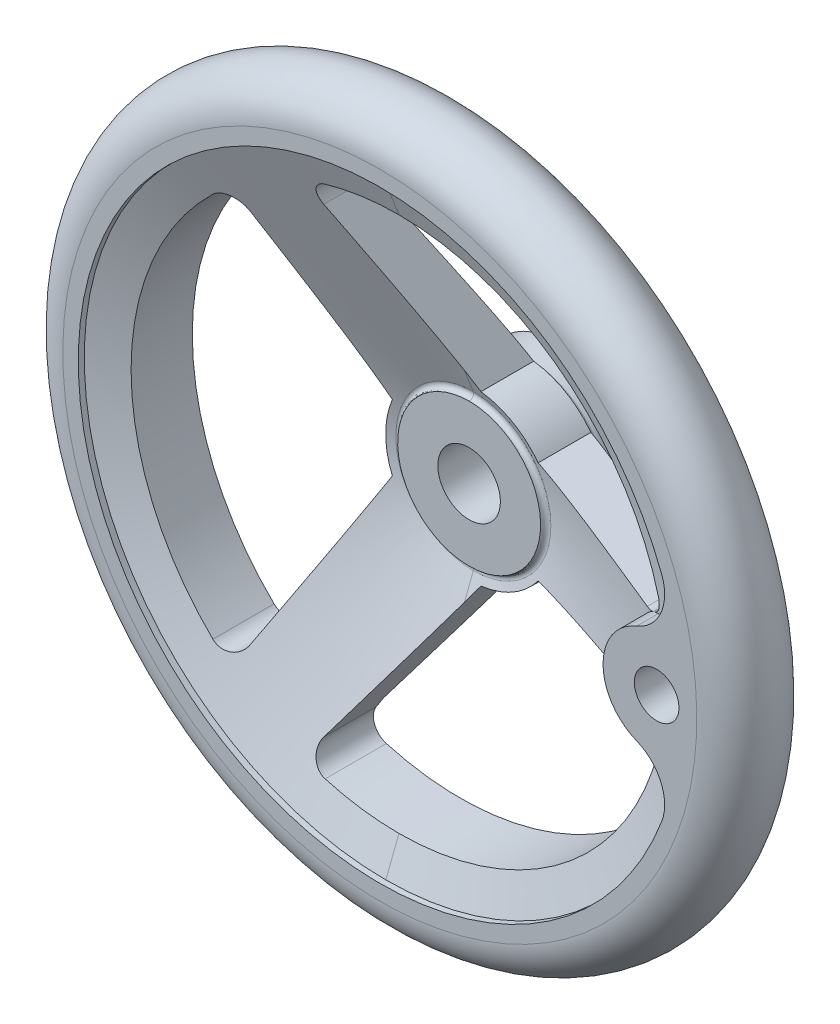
ISO-10303-21;
HEADER;
FILE_DESCRIPTION(('STEP AP214'),'2;1');
FILE_NAME('part.step','',(''),(''),'','','');
FILE_SCHEMA(('AUTOMOTIVE_DESIGN { 1 0 10303 214 1 1 1 1 }'));
ENDSEC;
DATA;
#1=APPLICATION_CONTEXT('core data for automotive mechanical design processes');
#2=APPLICATION_PROTOCOL_DEFINITION('international standard','automotive_design',2000,#1);
#3=PRODUCT_CONTEXT('',#1,'mechanical');
#4=PRODUCT('Part','Part','',(#3));
#5=PRODUCT_RELATED_PRODUCT_CATEGORY('part','',(#4));
#6=PRODUCT_DEFINITION_FORMATION('','',#4);
#7=PRODUCT_DEFINITION_CONTEXT('part definition',#1,'design');
#8=PRODUCT_DEFINITION('design','',#6,#7);
#9=PRODUCT_DEFINITION_SHAPE('','',#8);
#10=(LENGTH_UNIT() NAMED_UNIT(*) SI_UNIT(.MILLI.,.METRE.));
#11=(NAMED_UNIT(*) PLANE_ANGLE_UNIT() SI_UNIT($,.RADIAN.));
#12=(NAMED_UNIT(*) SI_UNIT($,.STERADIAN.) SOLID_ANGLE_UNIT());
#13=UNCERTAINTY_MEASURE_WITH_UNIT(LENGTH_MEASURE(1.E-05),#10,'distance_accuracy_value','');
#14=(GEOMETRIC_REPRESENTATION_CONTEXT(3) GLOBAL_UNCERTAINTY_ASSIGNED_CONTEXT((#13)) GLOBAL_UNIT_ASSIGNED_CONTEXT((#10,
#11,#12)) REPRESENTATION_CONTEXT('',''));
#15=CARTESIAN_POINT('',(0.,0.,0.));
#16=DIRECTION('',(0.,0.,1.));
#17=DIRECTION('',(1.,0.,0.));
#18=AXIS2_PLACEMENT_3D('',#15,#16,#17);
#19=CARTESIAN_POINT('',(-16.248223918,16.192506,0.));
#20=DIRECTION('',(0.,0.,1.));
#21=DIRECTION('',(0.,-1.,0.));
#22=AXIS2_PLACEMENT_3D('',#19,#20,#21);
#23=PLANE('',#22);
#24=CARTESIAN_POINT('',(0.,0.,0.));
#25=DIRECTION('',(0.,0.,-1.));
#26=DIRECTION('',(0.,1.,0.));
#27=AXIS2_PLACEMENT_3D('',#24,#25,#26);
#28=CIRCLE('',#27,7.);
#29=CARTESIAN_POINT('',(0.,7.,0.));
#30=VERTEX_POINT('',#29);
#31=EDGE_CURVE('E477',#30,#30,#28,.F.);
#32=ORIENTED_EDGE('',*,*,#31,.T.);
#33=EDGE_LOOP('',(#32));
#34=FACE_BOUND('',#33,.T.);
#35=CARTESIAN_POINT('',(0.,0.,0.));
#36=DIRECTION('',(0.,0.,-1.));
#37=DIRECTION('',(-1.,0.,0.));
#38=AXIS2_PLACEMENT_3D('',#35,#36,#37);
#39=CIRCLE('',#38,17.5);
#40=CARTESIAN_POINT('',(-17.5,0.,0.));
#41=VERTEX_POINT('',#40);
#42=EDGE_CURVE('E479',#41,#41,#39,.T.);
#43=ORIENTED_EDGE('',*,*,#42,.T.);
#44=EDGE_LOOP('',(#43));
#45=FACE_BOUND('',#44,.T.);
#46=ADVANCED_FACE('F14',(#34,#45),#23,.F.);
#47=CARTESIAN_POINT('',(0.,0.,20.000000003));
#48=DIRECTION('',(0.,0.,-1.));
#49=DIRECTION('',(0.,1.,0.));
#50=AXIS2_PLACEMENT_3D('',#47,#48,#49);
#51=CYLINDRICAL_SURFACE('',#50,7.);
#52=ORIENTED_EDGE('',*,*,#31,.F.);
#53=EDGE_LOOP('',(#52));
#54=FACE_BOUND('',#53,.T.);
#55=CARTESIAN_POINT('',(0.,0.,20.000000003));
#56=DIRECTION('',(0.,0.,-1.));
#57=DIRECTION('',(0.,1.,0.));
#58=AXIS2_PLACEMENT_3D('',#55,#56,#57);
#59=CIRCLE('',#58,7.);
#60=CARTESIAN_POINT('',(0.,7.,20.000000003));
#61=VERTEX_POINT('',#60);
#62=EDGE_CURVE('E474',#61,#61,#59,.F.);
#63=ORIENTED_EDGE('',*,*,#62,.T.);
#64=EDGE_LOOP('',(#63));
#65=FACE_BOUND('',#64,.T.);
#66=ADVANCED_FACE('F460',(#54,#65),#51,.F.);
#67=CARTESIAN_POINT('',(0.,0.,19.685715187));
#68=DIRECTION('',(0.,0.,-1.));
#69=DIRECTION('',(0.,1.,0.));
#70=AXIS2_PLACEMENT_3D('',#67,#68,#69);
#71=CYLINDRICAL_SURFACE('',#70,19.);
#72=CARTESIAN_POINT('',(0.,0.,19.6857151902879));
#73=DIRECTION('',(0.,0.,1.));
#74=DIRECTION('',(0.,-1.,0.));
#75=AXIS2_PLACEMENT_3D('',#72,#73,#74);
#76=CIRCLE('',#75,19.0000000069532);
#77=CARTESIAN_POINT('',(2.34190015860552,18.8551187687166,19.6857151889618));
#78=VERTEX_POINT('',#77);
#79=CARTESIAN_POINT('',(15.158061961,11.455704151,19.6857151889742));
#80=VERTEX_POINT('',#79);
#81=EDGE_CURVE('E248',#78,#80,#76,.F.);
#82=ORIENTED_EDGE('',*,*,#81,.T.);
#83=DIRECTION('',(0.,0.,1.));
#84=VECTOR('',#83,1.);
#85=CARTESIAN_POINT('',(15.158061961,11.455704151,20.6601553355));
#86=LINE('',#85,#84);
#87=CARTESIAN_POINT('',(15.158061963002,11.4557041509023,7.87400696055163));
#88=VERTEX_POINT('',#87);
#89=EDGE_CURVE('E243',#88,#80,#86,.T.);
#90=ORIENTED_EDGE('',*,*,#89,.F.);
#91=CARTESIAN_POINT('',(0.,0.,7.87400696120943));
#92=DIRECTION('',(0.,0.,1.));
#93=DIRECTION('',(0.,-1.,0.));
#94=AXIS2_PLACEMENT_3D('',#91,#92,#93);
#95=CIRCLE('',#94,19.0000000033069);
#96=CARTESIAN_POINT('',(2.3419001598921,18.8551187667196,7.87400696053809));
#97=VERTEX_POINT('',#96);
#98=EDGE_CURVE('E232',#97,#88,#95,.F.);
#99=ORIENTED_EDGE('',*,*,#98,.F.);
#100=DIRECTION('',(0.,0.,-1.));
#101=VECTOR('',#100,1.);
#102=CARTESIAN_POINT('',(2.341900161,18.855118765,20.8097797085));
#103=LINE('',#102,#101);
#104=EDGE_CURVE('E739',#78,#97,#103,.T.);
#105=ORIENTED_EDGE('',*,*,#104,.F.);
#106=EDGE_LOOP('',(#82,#90,#99,#105));
#107=FACE_BOUND('',#106,.T.);
#108=ADVANCED_FACE('F246',(#107),#71,.T.);
#109=CARTESIAN_POINT('',(0.,0.,19.685715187));
#110=DIRECTION('',(0.,0.,-1.));
#111=DIRECTION('',(0.,1.,0.));
#112=AXIS2_PLACEMENT_3D('',#109,#110,#111);
#113=CYLINDRICAL_SURFACE('',#112,19.);
#114=CARTESIAN_POINT('',(0.,0.,19.6857151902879));
#115=DIRECTION('',(0.,0.,1.));
#116=DIRECTION('',(0.,-1.,0.));
#117=AXIS2_PLACEMENT_3D('',#114,#115,#116);
#118=CIRCLE('',#117,19.0000000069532);
#119=CARTESIAN_POINT('',(15.1580619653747,-11.4557041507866,19.6857151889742));
#120=VERTEX_POINT('',#119);
#121=CARTESIAN_POINT('',(2.34190016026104,-18.855118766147,19.685715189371));
#122=VERTEX_POINT('',#121);
#123=EDGE_CURVE('E360',#120,#122,#118,.F.);
#124=ORIENTED_EDGE('',*,*,#123,.T.);
#125=DIRECTION('',(0.,0.,1.));
#126=VECTOR('',#125,1.);
#127=CARTESIAN_POINT('',(2.341900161,-18.855118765,20.8097797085));
#128=LINE('',#127,#126);
#129=CARTESIAN_POINT('',(2.3419001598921,-18.8551187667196,7.87400696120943));
#130=VERTEX_POINT('',#129);
#131=EDGE_CURVE('E328',#130,#122,#128,.T.);
#132=ORIENTED_EDGE('',*,*,#131,.F.);
#133=CARTESIAN_POINT('',(0.,0.,7.87400696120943));
#134=DIRECTION('',(0.,0.,1.));
#135=DIRECTION('',(0.,-1.,0.));
#136=AXIS2_PLACEMENT_3D('',#133,#134,#135);
#137=CIRCLE('',#136,19.0000000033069);
#138=CARTESIAN_POINT('',(15.158061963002,-11.4557041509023,7.87400696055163));
#139=VERTEX_POINT('',#138);
#140=EDGE_CURVE('E258',#139,#130,#137,.F.);
#141=ORIENTED_EDGE('',*,*,#140,.F.);
#142=DIRECTION('',(0.,0.,-1.));
#143=VECTOR('',#142,1.);
#144=CARTESIAN_POINT('',(15.158061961,-11.455704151,20.6601553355));
#145=LINE('',#144,#143);
#146=EDGE_CURVE('E260',#120,#139,#145,.T.);
#147=ORIENTED_EDGE('',*,*,#146,.F.);
#148=EDGE_LOOP('',(#124,#132,#141,#147));
#149=FACE_BOUND('',#148,.T.);
#150=ADVANCED_FACE('F465',(#149),#113,.T.);
#151=CARTESIAN_POINT('',(-16.248223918,-16.192506,20.000000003));
#152=DIRECTION('',(0.,0.,-1.));
#153=DIRECTION('',(0.,1.,0.));
#154=AXIS2_PLACEMENT_3D('',#151,#152,#153);
#155=PLANE('',#154);
#156=ORIENTED_EDGE('',*,*,#62,.F.);
#157=EDGE_LOOP('',(#156));
#158=FACE_BOUND('',#157,.T.);
#159=CARTESIAN_POINT('',(0.,16.0005,20.000000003));
#160=CARTESIAN_POINT('',(-0.333943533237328,16.0005074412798,20.000000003));
#161=CARTESIAN_POINT('',(-0.667838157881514,15.9900444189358,20.000000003));
#162=CARTESIAN_POINT('',(-1.33491140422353,15.9482240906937,20.000000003));
#163=CARTESIAN_POINT('',(-1.6680877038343,15.9168297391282,20.000000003));
#164=CARTESIAN_POINT('',(-2.44589871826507,15.8188326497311,20.000000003));
#165=CARTESIAN_POINT('',(-2.88951617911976,15.7438411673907,20.000000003));
#166=CARTESIAN_POINT('',(-3.5489594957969,15.6035727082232,20.000000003));
#167=CARTESIAN_POINT('',(-3.76783581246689,15.5521684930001,20.000000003));
#168=CARTESIAN_POINT('',(-4.20328477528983,15.4401731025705,20.000000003));
#169=CARTESIAN_POINT('',(-4.41985684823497,15.3795796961,20.000000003));
#170=CARTESIAN_POINT('',(-5.06585687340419,15.1840567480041,20.000000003));
#171=CARTESIAN_POINT('',(-5.4912326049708,15.0354559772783,20.000000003));
#172=CARTESIAN_POINT('',(-6.32788948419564,14.7029426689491,20.000000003));
#173=CARTESIAN_POINT('',(-6.73917057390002,14.5190299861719,20.000000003));
#174=CARTESIAN_POINT('',(-7.54455862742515,14.1172945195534,20.000000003));
#175=CARTESIAN_POINT('',(-7.93867490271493,13.8994904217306,20.000000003));
#176=CARTESIAN_POINT('',(-8.70716241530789,13.4314462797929,20.000000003));
#177=CARTESIAN_POINT('',(-9.08153310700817,13.1812053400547,20.000000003));
#178=CARTESIAN_POINT('',(-9.8077612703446,12.6501430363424,20.000000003));
#179=CARTESIAN_POINT('',(-10.1596248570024,12.3693300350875,20.000000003));
#180=CARTESIAN_POINT('',(-10.8384457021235,11.7790660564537,20.000000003));
#181=CARTESIAN_POINT('',(-11.1654031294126,11.4696152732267,20.000000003));
#182=CARTESIAN_POINT('',(-11.7921271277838,10.82423602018,20.000000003));
#183=CARTESIAN_POINT('',(-12.0918905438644,10.4883044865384,20.000000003));
#184=CARTESIAN_POINT('',(-12.6620531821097,9.79238265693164,20.000000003));
#185=CARTESIAN_POINT('',(-12.9324523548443,9.43239232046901,20.000000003));
#186=CARTESIAN_POINT('',(-13.4419726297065,8.69089953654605,20.000000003));
#187=CARTESIAN_POINT('',(-13.6810926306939,8.30939633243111,20.000000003));
#188=CARTESIAN_POINT('',(-14.1263432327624,7.5276018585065,20.000000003));
#189=CARTESIAN_POINT('',(-14.3324738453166,7.12731059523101,20.000000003));
#190=CARTESIAN_POINT('',(-14.7102763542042,6.31079425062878,20.000000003));
#191=CARTESIAN_POINT('',(-14.881948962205,5.89456949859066,20.000000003));
#192=CARTESIAN_POINT('',(-15.189620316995,5.0491374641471,20.000000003));
#193=CARTESIAN_POINT('',(-15.3256190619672,4.6199301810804,20.000000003));
#194=CARTESIAN_POINT('',(-15.5609764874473,3.75158201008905,20.000000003));
#195=CARTESIAN_POINT('',(-15.6603349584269,3.31244106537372,20.000000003));
#196=CARTESIAN_POINT('',(-15.8217043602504,2.42734998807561,20.000000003));
#197=CARTESIAN_POINT('',(-15.8837152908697,1.98139985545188,20.000000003));
#198=CARTESIAN_POINT('',(-15.9699490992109,1.08585721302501,20.000000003));
#199=CARTESIAN_POINT('',(-15.9941716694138,0.636264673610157,20.000000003));
#200=CARTESIAN_POINT('',(-16.0046555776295,-0.263362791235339,20.000000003));
#201=CARTESIAN_POINT('',(-15.9909169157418,-0.713397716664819,20.000000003));
#202=CARTESIAN_POINT('',(-15.9255767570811,-1.61070052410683,20.000000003));
#203=CARTESIAN_POINT('',(-15.8739760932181,-2.05796846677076,20.000000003));
#204=CARTESIAN_POINT('',(-15.7332797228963,-2.94656755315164,20.000000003));
#205=CARTESIAN_POINT('',(-15.6441840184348,-3.38789869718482,20.000000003));
#206=CARTESIAN_POINT('',(-15.4291328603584,-4.26147899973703,20.000000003));
#207=CARTESIAN_POINT('',(-15.3031780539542,-4.69372831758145,20.000000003));
#208=CARTESIAN_POINT('',(-15.0153035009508,-5.54608013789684,20.000000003));
#209=CARTESIAN_POINT('',(-14.8533837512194,-5.96618263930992,20.000000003));
#210=CARTESIAN_POINT('',(-14.4947201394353,-6.79127788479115,20.000000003));
#211=CARTESIAN_POINT('',(-14.2979742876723,-7.19626976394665,20.000000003));
#212=CARTESIAN_POINT('',(-13.8710636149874,-7.98823894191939,20.000000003));
#213=CARTESIAN_POINT('',(-13.6408987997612,-8.37521624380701,20.000000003));
#214=CARTESIAN_POINT('',(-13.1487785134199,-9.12841739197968,20.000000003));
#215=CARTESIAN_POINT('',(-12.8868219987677,-9.49464055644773,20.000000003));
#216=CARTESIAN_POINT('',(-12.3329866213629,-10.2037160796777,20.000000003));
#217=CARTESIAN_POINT('',(-12.0411077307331,-10.5465684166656,20.000000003));
#218=CARTESIAN_POINT('',(-11.4295405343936,-11.2064238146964,20.000000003));
#219=CARTESIAN_POINT('',(-11.1098556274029,-11.5234300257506,20.000000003));
#220=CARTESIAN_POINT('',(-10.4449195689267,-12.1293851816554,20.000000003));
#221=CARTESIAN_POINT('',(-10.0996685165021,-12.4183342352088,20.000000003));
#222=CARTESIAN_POINT('',(-9.38604930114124,-12.9661256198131,20.000000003));
#223=CARTESIAN_POINT('',(-9.01768086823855,-13.2249675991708,20.000000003));
#224=CARTESIAN_POINT('',(-8.26044324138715,-13.7107044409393,20.000000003));
#225=CARTESIAN_POINT('',(-7.87157376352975,-13.9375988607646,20.000000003));
#226=CARTESIAN_POINT('',(-7.07606274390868,-14.357845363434,20.000000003));
#227=CARTESIAN_POINT('',(-6.6694192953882,-14.5511938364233,20.000000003));
#228=CARTESIAN_POINT('',(-5.84130176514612,-14.9029376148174,20.000000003));
#229=CARTESIAN_POINT('',(-5.41982840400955,-15.0613346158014,20.000000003));
#230=CARTESIAN_POINT('',(-4.59049224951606,-15.333701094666,20.000000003));
#231=CARTESIAN_POINT('',(-4.18331176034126,-15.4497532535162,20.000000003));
#232=CARTESIAN_POINT('',(-3.36104668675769,-15.6492283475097,20.000000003));
#233=CARTESIAN_POINT('',(-2.94596243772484,-15.7326526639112,20.000000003));
#234=CARTESIAN_POINT('',(-2.11041465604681,-15.8663513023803,20.000000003));
#235=CARTESIAN_POINT('',(-1.68995017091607,-15.9166196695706,20.000000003));
#236=CARTESIAN_POINT('',(-0.846325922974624,-15.9837142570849,20.000000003));
#237=CARTESIAN_POINT('',(-0.423165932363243,-16.0005376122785,20.000000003));
#238=CARTESIAN_POINT('',(0.,-16.0005,20.000000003));
#239=B_SPLINE_CURVE_WITH_KNOTS('',3,(#159,#160,#161,#162,#163,#164,#165,#166,#167,#168,#169,
#170,#171,#172,#173,#174,#175,#176,#177,#178,#179,#180,#181,#182,#183,#184,#185,#186,#187,#188,
#189,#190,#191,#192,#193,#194,#195,#196,#197,#198,#199,#200,#201,#202,#203,#204,#205,#206,#207,
#208,#209,#210,#211,#212,#213,#214,#215,#216,#217,#218,#219,#220,#221,#222,#223,#224,#225,#226,
#227,#228,#229,#230,#231,#232,#233,#234,#235,#236,#237,#238),.UNSPECIFIED.,.F.,.F.,(4,2,2,2,2,2,
2,2,2,2,2,2,2,2,2,2,2,2,2,2,2,2,2,2,2,2,2,2,2,2,2,2,2,2,2,2,2,2,2,4),(0.,1.00156977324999,
2.00491691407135,3.35283687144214,4.02716568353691,4.70165849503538,6.05167144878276,
7.40168995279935,8.75096674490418,10.1002808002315,11.4492266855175,12.7981634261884,
14.1472564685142,15.4963517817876,16.8454945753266,18.194636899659,19.5437513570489,
20.8928658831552,22.2419881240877,23.5911103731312,24.9402436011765,26.289376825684,
27.6384803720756,28.9875838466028,30.3366636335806,31.6857435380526,33.0349005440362,
34.3840573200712,35.7332583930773,37.0824607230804,38.4314983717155,39.780530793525,
41.1295789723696,42.4786458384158,43.827857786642,45.177004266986,46.4458760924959,
47.7146941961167,48.9837401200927,50.2528947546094),.UNSPECIFIED.);
#240=CARTESIAN_POINT('',(0.,16.0005,19.9867839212));
#241=VERTEX_POINT('',#240);
#242=CARTESIAN_POINT('',(0.,-16.0005,19.9867839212));
#243=VERTEX_POINT('',#242);
#244=EDGE_CURVE('E630',#241,#243,#239,.T.);
#245=ORIENTED_EDGE('',*,*,#244,.T.);
#246=CARTESIAN_POINT('',(0.,-16.0005,20.000000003));
#247=CARTESIAN_POINT('',(0.333943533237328,-16.0005074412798,20.000000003));
#248=CARTESIAN_POINT('',(0.667838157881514,-15.9900444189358,20.000000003));
#249=CARTESIAN_POINT('',(1.33491140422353,-15.9482240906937,20.000000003));
#250=CARTESIAN_POINT('',(1.6680877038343,-15.9168297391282,20.000000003));
#251=CARTESIAN_POINT('',(2.44589871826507,-15.8188326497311,20.000000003));
#252=CARTESIAN_POINT('',(2.88951617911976,-15.7438411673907,20.000000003));
#253=CARTESIAN_POINT('',(3.5489594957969,-15.6035727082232,20.000000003));
#254=CARTESIAN_POINT('',(3.76783581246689,-15.5521684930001,20.000000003));
#255=CARTESIAN_POINT('',(4.20328477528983,-15.4401731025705,20.000000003));
#256=CARTESIAN_POINT('',(4.41985684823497,-15.3795796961,20.000000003));
#257=CARTESIAN_POINT('',(5.06585687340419,-15.1840567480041,20.000000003));
#258=CARTESIAN_POINT('',(5.4912326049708,-15.0354559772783,20.000000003));
#259=CARTESIAN_POINT('',(6.32788948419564,-14.7029426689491,20.000000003));
#260=CARTESIAN_POINT('',(6.73917057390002,-14.5190299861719,20.000000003));
#261=CARTESIAN_POINT('',(7.54455862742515,-14.1172945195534,20.000000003));
#262=CARTESIAN_POINT('',(7.93867490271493,-13.8994904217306,20.000000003));
#263=CARTESIAN_POINT('',(8.70716241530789,-13.4314462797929,20.000000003));
#264=CARTESIAN_POINT('',(9.08153310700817,-13.1812053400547,20.000000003));
#265=CARTESIAN_POINT('',(9.8077612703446,-12.6501430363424,20.000000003));
#266=CARTESIAN_POINT('',(10.1596248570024,-12.3693300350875,20.000000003));
#267=CARTESIAN_POINT('',(10.8384457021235,-11.7790660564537,20.000000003));
#268=CARTESIAN_POINT('',(11.1654031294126,-11.4696152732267,20.000000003));
#269=CARTESIAN_POINT('',(11.7921271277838,-10.82423602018,20.000000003));
#270=CARTESIAN_POINT('',(12.0918905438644,-10.4883044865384,20.000000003));
#271=CARTESIAN_POINT('',(12.6620531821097,-9.79238265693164,20.000000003));
#272=CARTESIAN_POINT('',(12.9324523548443,-9.43239232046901,20.000000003));
#273=CARTESIAN_POINT('',(13.4419726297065,-8.69089953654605,20.000000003));
#274=CARTESIAN_POINT('',(13.6810926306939,-8.30939633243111,20.000000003));
#275=CARTESIAN_POINT('',(14.1263432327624,-7.5276018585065,20.000000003));
#276=CARTESIAN_POINT('',(14.3324738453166,-7.12731059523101,20.000000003));
#277=CARTESIAN_POINT('',(14.7102763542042,-6.31079425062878,20.000000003));
#278=CARTESIAN_POINT('',(14.881948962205,-5.89456949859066,20.000000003));
#279=CARTESIAN_POINT('',(15.189620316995,-5.0491374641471,20.000000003));
#280=CARTESIAN_POINT('',(15.3256190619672,-4.6199301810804,20.000000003));
#281=CARTESIAN_POINT('',(15.5609764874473,-3.75158201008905,20.000000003));
#282=CARTESIAN_POINT('',(15.6603349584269,-3.31244106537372,20.000000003));
#283=CARTESIAN_POINT('',(15.8217043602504,-2.42734998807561,20.000000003));
#284=CARTESIAN_POINT('',(15.8837152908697,-1.98139985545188,20.000000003));
#285=CARTESIAN_POINT('',(15.9699490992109,-1.08585721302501,20.000000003));
#286=CARTESIAN_POINT('',(15.9941716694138,-0.636264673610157,20.000000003));
#287=CARTESIAN_POINT('',(16.0046555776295,0.263362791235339,20.000000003));
#288=CARTESIAN_POINT('',(15.9909169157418,0.713397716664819,20.000000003));
#289=CARTESIAN_POINT('',(15.9255767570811,1.61070052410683,20.000000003));
#290=CARTESIAN_POINT('',(15.8739760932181,2.05796846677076,20.000000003));
#291=CARTESIAN_POINT('',(15.7332797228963,2.94656755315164,20.000000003));
#292=CARTESIAN_POINT('',(15.6441840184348,3.38789869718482,20.000000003));
#293=CARTESIAN_POINT('',(15.4291328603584,4.26147899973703,20.000000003));
#294=CARTESIAN_POINT('',(15.3031780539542,4.69372831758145,20.000000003));
#295=CARTESIAN_POINT('',(15.0153035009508,5.54608013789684,20.000000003));
#296=CARTESIAN_POINT('',(14.8533837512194,5.96618263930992,20.000000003));
#297=CARTESIAN_POINT('',(14.4947201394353,6.79127788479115,20.000000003));
#298=CARTESIAN_POINT('',(14.2979742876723,7.19626976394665,20.000000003));
#299=CARTESIAN_POINT('',(13.8710636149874,7.98823894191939,20.000000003));
#300=CARTESIAN_POINT('',(13.6408987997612,8.37521624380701,20.000000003));
#301=CARTESIAN_POINT('',(13.1487785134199,9.12841739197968,20.000000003));
#302=CARTESIAN_POINT('',(12.8868219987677,9.49464055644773,20.000000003));
#303=CARTESIAN_POINT('',(12.3329866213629,10.2037160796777,20.000000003));
#304=CARTESIAN_POINT('',(12.0411077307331,10.5465684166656,20.000000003));
#305=CARTESIAN_POINT('',(11.4295405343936,11.2064238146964,20.000000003));
#306=CARTESIAN_POINT('',(11.1098556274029,11.5234300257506,20.000000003));
#307=CARTESIAN_POINT('',(10.4449195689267,12.1293851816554,20.000000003));
#308=CARTESIAN_POINT('',(10.0996685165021,12.4183342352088,20.000000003));
#309=CARTESIAN_POINT('',(9.38604930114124,12.9661256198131,20.000000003));
#310=CARTESIAN_POINT('',(9.01768086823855,13.2249675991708,20.000000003));
#311=CARTESIAN_POINT('',(8.26044324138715,13.7107044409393,20.000000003));
#312=CARTESIAN_POINT('',(7.87157376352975,13.9375988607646,20.000000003));
#313=CARTESIAN_POINT('',(7.07606274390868,14.357845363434,20.000000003));
#314=CARTESIAN_POINT('',(6.6694192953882,14.5511938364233,20.000000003));
#315=CARTESIAN_POINT('',(5.84130176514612,14.9029376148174,20.000000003));
#316=CARTESIAN_POINT('',(5.41982840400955,15.0613346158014,20.000000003));
#317=CARTESIAN_POINT('',(4.59049224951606,15.333701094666,20.000000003));
#318=CARTESIAN_POINT('',(4.18331176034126,15.4497532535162,20.000000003));
#319=CARTESIAN_POINT('',(3.36104668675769,15.6492283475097,20.000000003));
#320=CARTESIAN_POINT('',(2.94596243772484,15.7326526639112,20.000000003));
#321=CARTESIAN_POINT('',(2.11041465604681,15.8663513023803,20.000000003));
#322=CARTESIAN_POINT('',(1.68995017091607,15.9166196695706,20.000000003));
#323=CARTESIAN_POINT('',(0.846325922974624,15.9837142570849,20.000000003));
#324=CARTESIAN_POINT('',(0.423165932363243,16.0005376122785,20.000000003));
#325=CARTESIAN_POINT('',(0.,16.0005,20.000000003));
#326=B_SPLINE_CURVE_WITH_KNOTS('',3,(#246,#247,#248,#249,#250,#251,#252,#253,#254,#255,#256,
#257,#258,#259,#260,#261,#262,#263,#264,#265,#266,#267,#268,#269,#270,#271,#272,#273,#274,#275,
#276,#277,#278,#279,#280,#281,#282,#283,#284,#285,#286,#287,#288,#289,#290,#291,#292,#293,#294,
#295,#296,#297,#298,#299,#300,#301,#302,#303,#304,#305,#306,#307,#308,#309,#310,#311,#312,#313,
#314,#315,#316,#317,#318,#319,#320,#321,#322,#323,#324,#325),.UNSPECIFIED.,.F.,.F.,(4,2,2,2,2,2,
2,2,2,2,2,2,2,2,2,2,2,2,2,2,2,2,2,2,2,2,2,2,2,2,2,2,2,2,2,2,2,2,2,4),(0.,1.00156977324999,
2.00491691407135,3.35283687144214,4.02716568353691,4.70165849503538,6.05167144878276,
7.40168995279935,8.75096674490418,10.1002808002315,11.4492266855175,12.7981634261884,
14.1472564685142,15.4963517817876,16.8454945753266,18.194636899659,19.5437513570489,
20.8928658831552,22.2419881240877,23.5911103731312,24.9402436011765,26.289376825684,
27.6384803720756,28.9875838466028,30.3366636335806,31.6857435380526,33.0349005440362,
34.3840573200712,35.7332583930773,37.0824607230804,38.4314983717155,39.780530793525,
41.1295789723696,42.4786458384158,43.827857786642,45.177004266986,46.4458760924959,
47.7146941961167,48.9837401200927,50.2528947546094),.UNSPECIFIED.);
#327=EDGE_CURVE('E252',#243,#241,#326,.T.);
#328=ORIENTED_EDGE('',*,*,#327,.T.);
#329=EDGE_LOOP('',(#245,#328));
#330=FACE_BOUND('',#329,.T.);
#331=ADVANCED_FACE('F462',(#158,#330),#155,.F.);
#332=CARTESIAN_POINT('',(0.,16.0005,20.000000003));
#333=CARTESIAN_POINT('',(32.001,16.0005,20.000000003));
#334=CARTESIAN_POINT('',(32.001,-16.0005,20.000000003));
#335=CARTESIAN_POINT('',(0.,-16.0005,20.000000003));
#336=CARTESIAN_POINT('',(0.,16.0005,19.9926577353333));
#337=CARTESIAN_POINT('',(32.001,16.0005,19.9926577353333));
#338=CARTESIAN_POINT('',(32.001,-16.0005,19.9926577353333));
#339=CARTESIAN_POINT('',(0.,-16.0005,19.9926577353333));
#340=CARTESIAN_POINT('',(0.,16.0005,19.9853154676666));
#341=CARTESIAN_POINT('',(32.001,16.0005,19.9853154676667));
#342=CARTESIAN_POINT('',(32.001,-16.0005,19.9853154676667));
#343=CARTESIAN_POINT('',(0.,-16.0005,19.9853154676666));
#344=CARTESIAN_POINT('',(0.,16.0005,19.9779732));
#345=CARTESIAN_POINT('',(32.001,16.0005,19.9779732));
#346=CARTESIAN_POINT('',(32.001,-16.0005,19.9779732));
#347=CARTESIAN_POINT('',(0.,-16.0005,19.9779732));
#348=CARTESIAN_POINT('',(0.,16.0005,19.201760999));
#349=CARTESIAN_POINT('',(32.001,16.0005,19.201760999));
#350=CARTESIAN_POINT('',(32.001,-16.0005,19.201760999));
#351=CARTESIAN_POINT('',(0.,-16.0005,19.201760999));
#352=CARTESIAN_POINT('',(0.,16.641518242,18.764038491));
#353=CARTESIAN_POINT('',(33.283036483,16.641518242,18.764038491));
#354=CARTESIAN_POINT('',(33.283036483,-16.641518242,18.764038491));
#355=CARTESIAN_POINT('',(0.,-16.641518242,18.764038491));
#356=CARTESIAN_POINT('',(0.,17.364485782,19.046568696));
#357=CARTESIAN_POINT('',(34.728971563,17.364485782,19.046568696));
#358=CARTESIAN_POINT('',(34.728971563,-17.364485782,19.046568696));
#359=CARTESIAN_POINT('',(0.,-17.364485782,19.046568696));
#360=(BOUNDED_SURFACE() B_SPLINE_SURFACE(3,3,((#332,#333,#334,#335),(#336,#337,#338,#339),(#340,
#341,#342,#343),(#344,#345,#346,#347),(#348,#349,#350,#351),(#352,#353,#354,#355),(#356,#357,
#358,#359)),.UNSPECIFIED.,.F.,.F.,.F.) B_SPLINE_SURFACE_WITH_KNOTS((4,3,4),(4,4),
(-0.0133361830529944,0.,1.),(0.,1.),
.UNSPECIFIED.) GEOMETRIC_REPRESENTATION_ITEM() RATIONAL_B_SPLINE_SURFACE(((1.,0.333333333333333,
0.333333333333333,1.),(1.,0.333333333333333,0.333333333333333,1.),(1.,0.333333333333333,
0.333333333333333,1.),(1.,0.333333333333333,0.333333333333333,1.),(0.709280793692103,
0.236426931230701,0.236426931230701,0.709280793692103),(0.709280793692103,0.236426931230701,
0.236426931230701,0.709280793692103),(1.,0.333333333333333,0.333333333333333,1.))) REPRESENTATION_ITEM('') SURFACE());
#361=CARTESIAN_POINT('',(0.,0.,19.046568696));
#362=DIRECTION('',(0.,0.,1.));
#363=DIRECTION('',(0.,-1.,0.));
#364=AXIS2_PLACEMENT_3D('',#361,#362,#363);
#365=CIRCLE('',#364,17.364485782);
#366=CARTESIAN_POINT('',(-2.33883027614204E-09,-17.364485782,19.046568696));
#367=VERTEX_POINT('',#366);
#368=CARTESIAN_POINT('',(-4.45189446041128E-09,17.364485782,19.046568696));
#369=VERTEX_POINT('',#368);
#370=EDGE_CURVE('E359',#367,#369,#365,.T.);
#371=CARTESIAN_POINT('',(0.,16.0005,19.9779732));
#372=CARTESIAN_POINT('',(0.,16.0005,19.201760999));
#373=CARTESIAN_POINT('',(0.,16.641518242,18.764038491));
#374=CARTESIAN_POINT('',(0.,17.364485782,19.046568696));
#375=(BOUNDED_CURVE() B_SPLINE_CURVE(3,(#371,#372,#373,#374),.UNSPECIFIED.,.F.,
.F.) B_SPLINE_CURVE_WITH_KNOTS((4,4),(0.,1.),
.UNSPECIFIED.) CURVE() GEOMETRIC_REPRESENTATION_ITEM() RATIONAL_B_SPLINE_CURVE((1.,
0.709280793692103,0.709280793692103,1.)) REPRESENTATION_ITEM(''));
#376=EDGE_CURVE('E623',#369,#241,#375,.F.);
#377=CARTESIAN_POINT('',(0.,-16.0005,19.9779732));
#378=CARTESIAN_POINT('',(0.,-16.0005,19.201760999));
#379=CARTESIAN_POINT('',(0.,-16.641518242,18.764038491));
#380=CARTESIAN_POINT('',(0.,-17.364485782,19.046568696));
#381=(BOUNDED_CURVE() B_SPLINE_CURVE(3,(#377,#378,#379,#380),.UNSPECIFIED.,.F.,
.F.) B_SPLINE_CURVE_WITH_KNOTS((4,4),(0.,1.),
.UNSPECIFIED.) CURVE() GEOMETRIC_REPRESENTATION_ITEM() RATIONAL_B_SPLINE_CURVE((1.,
0.709280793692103,0.709280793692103,1.)) REPRESENTATION_ITEM(''));
#382=EDGE_CURVE('E626',#243,#367,#381,.T.);
#383=ORIENTED_EDGE('',*,*,#370,.T.);
#384=ORIENTED_EDGE('',*,*,#376,.T.);
#385=ORIENTED_EDGE('',*,*,#327,.F.);
#386=ORIENTED_EDGE('',*,*,#382,.T.);
#387=EDGE_LOOP('',(#383,#384,#385,#386));
#388=FACE_BOUND('',#387,.T.);
#389=ADVANCED_FACE('F286',(#388),#360,.F.);
#390=CARTESIAN_POINT('',(53.356626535,9.59236001,7.720573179));
#391=DIRECTION('',(0.0487225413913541,0.998812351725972,0.));
#392=DIRECTION('',(-0.998812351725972,0.0487225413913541,0.));
#393=AXIS2_PLACEMENT_3D('',#390,#391,#392);
#394=PLANE('',#393);
#395=CARTESIAN_POINT('',(15.1580619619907,11.4557041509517,19.685715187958));
#396=CARTESIAN_POINT('',(15.5506878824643,11.4365516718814,19.8036273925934));
#397=CARTESIAN_POINT('',(15.9427797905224,11.4174252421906,19.9233077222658));
#398=CARTESIAN_POINT('',(16.72600160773,11.3792193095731,20.1657615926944));
#399=CARTESIAN_POINT('',(17.1171315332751,11.3601398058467,20.2885350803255));
#400=CARTESIAN_POINT('',(17.8985221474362,11.3220232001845,20.5367278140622));
#401=CARTESIAN_POINT('',(18.2887828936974,11.3029860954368,20.6621468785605));
#402=CARTESIAN_POINT('',(19.0685588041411,11.2649482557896,20.9152913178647));
#403=CARTESIAN_POINT('',(19.4580739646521,11.2459475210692,21.0430167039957));
#404=CARTESIAN_POINT('',(20.6254896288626,11.1890004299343,21.4291426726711));
#405=CARTESIAN_POINT('',(21.4024021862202,11.151102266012,21.6905383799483));
#406=CARTESIAN_POINT('',(22.9541574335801,11.0754069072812,22.219448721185));
#407=CARTESIAN_POINT('',(23.7290000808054,11.0376097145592,22.4869634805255));
#408=CARTESIAN_POINT('',(25.2768316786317,10.962105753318,23.02670689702));
#409=CARTESIAN_POINT('',(26.0498210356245,10.9243989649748,23.2989343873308));
#410=CARTESIAN_POINT('',(27.5944511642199,10.8490511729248,23.8471755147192));
#411=CARTESIAN_POINT('',(28.3660919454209,10.8114101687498,24.1231891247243));
#412=CARTESIAN_POINT('',(29.9083197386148,10.7361795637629,24.6782776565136));
#413=CARTESIAN_POINT('',(30.678906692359,10.6985899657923,24.9573527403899));
#414=CARTESIAN_POINT('',(32.2191779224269,10.6234548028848,25.5179912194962));
#415=CARTESIAN_POINT('',(32.9888621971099,10.585909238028,25.7995546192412));
#416=CARTESIAN_POINT('',(35.3957305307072,10.4685010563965,26.6836334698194));
#417=CARTESIAN_POINT('',(37.0315993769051,10.3887025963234,27.2897376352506));
#418=CARTESIAN_POINT('',(40.3009597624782,10.2292216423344,28.5082164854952));
#419=CARTESIAN_POINT('',(41.9344513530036,10.1495391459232,29.1205910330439));
#420=CARTESIAN_POINT('',(45.2000864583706,9.99023991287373,30.3499762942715));
#421=CARTESIAN_POINT('',(46.8322296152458,9.91062319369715,30.9669879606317));
#422=CARTESIAN_POINT('',(49.2795128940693,9.79124355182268,31.8950068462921));
#423=CARTESIAN_POINT('',(50.0951256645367,9.75145757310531,32.2047660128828));
#424=CARTESIAN_POINT('',(51.7260741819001,9.67189912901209,32.8250135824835));
#425=CARTESIAN_POINT('',(52.5414099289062,9.63212666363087,33.135501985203));
#426=CARTESIAN_POINT('',(53.3566265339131,9.59236001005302,33.4463037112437));
#427=B_SPLINE_CURVE_WITH_KNOTS('',3,(#395,#396,#397,#398,#399,#400,#401,#402,#403,#404,#405,
#406,#407,#408,#409,#410,#411,#412,#413,#414,#415,#416,#417,#418,#419,#420,#421,#422,#423,#424,
#425,#426),.UNSPECIFIED.,.F.,.F.,(4,2,2,2,2,2,2,2,2,2,2,2,2,2,2,4),(0.,1.23117913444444,
2.46233713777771,3.6934109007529,4.9244907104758,7.38620307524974,9.84796592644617,
12.3091277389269,14.7702719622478,17.2315471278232,19.6928267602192,24.9319048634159,
30.1708685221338,35.4109396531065,38.0310197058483,40.6510987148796),.UNSPECIFIED.);
#428=CARTESIAN_POINT('',(53.3566265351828,9.59236001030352,33.4463037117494));
#429=VERTEX_POINT('',#428);
#430=EDGE_CURVE('E389',#80,#429,#427,.T.);
#431=ORIENTED_EDGE('',*,*,#430,.T.);
#432=DIRECTION('',(0.,0.,-1.));
#433=VECTOR('',#432,1.);
#434=CARTESIAN_POINT('',(53.3566265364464,9.59236001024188,28.224689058));
#435=LINE('',#434,#433);
#436=CARTESIAN_POINT('',(53.3566264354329,9.59236001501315,22.));
#437=VERTEX_POINT('',#436);
#438=EDGE_CURVE('E329',#429,#437,#435,.T.);
#439=ORIENTED_EDGE('',*,*,#438,.T.);
#440=DIRECTION('',(-0.998812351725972,0.0487225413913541,0.));
#441=VECTOR('',#440,1.);
#442=CARTESIAN_POINT('',(53.356626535,9.59236001,22.));
#443=LINE('',#442,#441);
#444=CARTESIAN_POINT('',(51.1210390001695,9.70141303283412,21.9999999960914));
#445=VERTEX_POINT('',#444);
#446=EDGE_CURVE('E257',#437,#445,#443,.T.);
#447=ORIENTED_EDGE('',*,*,#446,.T.);
#448=CARTESIAN_POINT('',(15.1580619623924,11.4557041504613,7.8740069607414));
#449=CARTESIAN_POINT('',(15.5500231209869,11.4365840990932,8.00281500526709));
#450=CARTESIAN_POINT('',(15.9413574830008,11.4174946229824,8.13351957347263));
#451=CARTESIAN_POINT('',(16.7228984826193,11.3793706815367,8.39824260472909));
#452=CARTESIAN_POINT('',(17.113105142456,11.3603362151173,8.53226100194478));
#453=CARTESIAN_POINT('',(17.8925014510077,11.3223168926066,8.80312701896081));
#454=CARTESIAN_POINT('',(18.2816911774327,11.3033320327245,8.93997441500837));
#455=CARTESIAN_POINT('',(19.059198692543,11.2654048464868,9.21613443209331));
#456=CARTESIAN_POINT('',(19.4475164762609,11.2464625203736,9.35544706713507));
#457=CARTESIAN_POINT('',(20.6111542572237,11.1896997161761,9.77652685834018));
#458=CARTESIAN_POINT('',(21.3853200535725,11.1519355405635,10.0614922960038));
#459=CARTESIAN_POINT('',(22.9312365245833,11.0765250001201,10.6379493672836));
#460=CARTESIAN_POINT('',(23.702987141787,11.0388786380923,10.9294411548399));
#461=CARTESIAN_POINT('',(25.2443308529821,10.9636911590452,11.5174352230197));
#462=CARTESIAN_POINT('',(26.0139244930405,10.9261500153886,11.8139360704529));
#463=CARTESIAN_POINT('',(27.5515408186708,10.851144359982,12.4109693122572));
#464=CARTESIAN_POINT('',(28.3195635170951,10.813679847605,12.711501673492));
#465=CARTESIAN_POINT('',(29.854379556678,10.738810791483,13.3158281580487));
#466=CARTESIAN_POINT('',(30.6211728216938,10.7014062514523,13.6196224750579));
#467=CARTESIAN_POINT('',(32.1537086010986,10.6266484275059,14.2298586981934));
#468=CARTESIAN_POINT('',(32.9194511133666,10.5892951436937,14.5363006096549));
#469=CARTESIAN_POINT('',(35.1419975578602,10.4808782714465,15.4293930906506));
#470=CARTESIAN_POINT('',(36.5976603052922,10.4098703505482,16.0188900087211));
#471=CARTESIAN_POINT('',(39.5066806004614,10.2679669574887,17.2034451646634));
#472=CARTESIAN_POINT('',(40.9600382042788,10.1970714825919,17.7985032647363));
#473=CARTESIAN_POINT('',(43.8653829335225,10.0553473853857,18.9928682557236));
#474=CARTESIAN_POINT('',(45.3173696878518,9.98451878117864,19.5921760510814));
#475=CARTESIAN_POINT('',(47.494397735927,9.8783223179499,20.4934828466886));
#476=CARTESIAN_POINT('',(48.2199225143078,9.84293087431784,20.79431239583));
#477=CARTESIAN_POINT('',(49.6706860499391,9.77216193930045,21.396661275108));
#478=CARTESIAN_POINT('',(50.3959248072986,9.7367844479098,21.6981806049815));
#479=CARTESIAN_POINT('',(51.1210389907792,9.70141303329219,21.9999999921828));
#480=B_SPLINE_CURVE_WITH_KNOTS('',3,(#448,#449,#450,#451,#452,#453,#454,#455,#456,#457,#458,
#459,#460,#461,#462,#463,#464,#465,#466,#467,#468,#469,#470,#471,#472,#473,#474,#475,#476,#477,
#478,#479),.UNSPECIFIED.,.F.,.F.,(4,2,2,2,2,2,2,2,2,2,2,2,2,2,2,4),(0.,1.23906680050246,
2.47810900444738,3.71705358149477,4.95600519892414,7.43339510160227,9.91084350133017,
12.3875946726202,14.8643254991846,17.3412042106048,19.8180879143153,24.534373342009,
29.250542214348,33.9677468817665,36.3263976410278,38.6850475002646),.UNSPECIFIED.);
#481=EDGE_CURVE('E237',#88,#445,#480,.T.);
#482=ORIENTED_EDGE('',*,*,#481,.F.);
#483=ORIENTED_EDGE('',*,*,#89,.T.);
#484=EDGE_LOOP('',(#431,#439,#447,#482,#483));
#485=FACE_BOUND('',#484,.T.);
#486=ADVANCED_FACE('F255',(#485),#394,.T.);
#487=CARTESIAN_POINT('',(0.,0.,6.85082955));
#488=DIRECTION('',(0.,0.,1.));
#489=DIRECTION('',(0.,-1.,0.));
#490=AXIS2_PLACEMENT_3D('',#487,#488,#489);
#491=CONICAL_SURFACE('',#490,16.607314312,1.16670254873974);
#492=CARTESIAN_POINT('',(0.,0.,7.49205649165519));
#493=DIRECTION('',(0.,0.,-1.));
#494=DIRECTION('',(-1.,0.,0.));
#495=AXIS2_PLACEMENT_3D('',#492,#493,#494);
#496=CIRCLE('',#495,18.1068143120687);
#497=CARTESIAN_POINT('',(-18.1068143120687,0.,7.49205649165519));
#498=VERTEX_POINT('',#497);
#499=EDGE_CURVE('E9',#498,#498,#496,.F.);
#500=ORIENTED_EDGE('',*,*,#499,.T.);
#501=EDGE_LOOP('',(#500));
#502=FACE_BOUND('',#501,.T.);
#503=CARTESIAN_POINT('',(2.34190015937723,18.8551187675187,7.87400696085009));
#504=CARTESIAN_POINT('',(2.14571562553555,19.1596227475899,7.99290010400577));
#505=CARTESIAN_POINT('',(1.94982109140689,19.4636766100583,8.11341310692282));
#506=CARTESIAN_POINT('',(1.55855744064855,20.0709688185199,8.35729508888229));
#507=CARTESIAN_POINT('',(1.36318831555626,20.3742071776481,8.48066402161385));
#508=CARTESIAN_POINT('',(0.972944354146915,20.9799166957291,8.72985896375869));
#509=CARTESIAN_POINT('',(0.778069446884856,21.2823879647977,8.85568459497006));
#510=CARTESIAN_POINT('',(0.388734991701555,21.886685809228,9.10950756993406));
#511=CARTESIAN_POINT('',(0.194275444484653,22.1885123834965,9.23750491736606));
#512=CARTESIAN_POINT('',(-0.497777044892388,23.2626680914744,9.69683087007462));
#513=CARTESIAN_POINT('',(-0.994345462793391,24.0334070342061,10.0334254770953));
#514=CARTESIAN_POINT('',(-1.98566232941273,25.5720600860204,10.7156442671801));
#515=CARTESIAN_POINT('',(-2.48041074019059,26.3399741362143,11.0612686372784));
#516=CARTESIAN_POINT('',(-3.46853763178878,27.8736759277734,11.75929974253));
#517=CARTESIAN_POINT('',(-3.96191602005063,28.6394635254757,12.1117069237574));
#518=CARTESIAN_POINT('',(-4.94757659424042,30.1693372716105,12.8216800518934));
#519=CARTESIAN_POINT('',(-5.43985878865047,30.9334234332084,13.1792459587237));
#520=CARTESIAN_POINT('',(-6.42372732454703,32.4605157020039,13.8985216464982));
#521=CARTESIAN_POINT('',(-6.91531337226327,33.2235213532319,14.260232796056));
#522=CARTESIAN_POINT('',(-7.89779403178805,34.7484594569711,14.986844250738));
#523=CARTESIAN_POINT('',(-8.3886886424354,35.5103919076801,15.3517445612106));
#524=CARTESIAN_POINT('',(-9.3698981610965,37.0333570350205,16.0840975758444));
#525=CARTESIAN_POINT('',(-9.86021308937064,37.7943897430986,16.4515501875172));
#526=CARTESIAN_POINT('',(-10.8403814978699,39.3157389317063,17.1885477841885));
#527=CARTESIAN_POINT('',(-11.330234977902,40.0760554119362,17.5580927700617));
#528=CARTESIAN_POINT('',(-12.2654115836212,41.5275714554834,18.2655151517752));
#529=CARTESIAN_POINT('',(-12.7107677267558,42.2188222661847,18.603243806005));
#530=CARTESIAN_POINT('',(-13.6012122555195,43.6009082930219,19.2799168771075));
#531=CARTESIAN_POINT('',(-14.0463006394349,44.2917435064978,19.6188613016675));
#532=CARTESIAN_POINT('',(-14.9360821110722,45.6728003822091,20.2976613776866));
#533=CARTESIAN_POINT('',(-15.3807752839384,46.3630221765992,20.6375166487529));
#534=CARTESIAN_POINT('',(-16.269957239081,47.7431485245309,21.3181215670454));
#535=CARTESIAN_POINT('',(-16.7144460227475,48.4330530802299,21.6588712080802));
#536=CARTESIAN_POINT('',(-17.1588493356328,49.1228249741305,21.9999999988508));
#537=B_SPLINE_CURVE_WITH_KNOTS('',3,(#503,#504,#505,#506,#507,#508,#509,#510,#511,#512,#513,
#514,#515,#516,#517,#518,#519,#520,#521,#522,#523,#524,#525,#526,#527,#528,#529,#530,#531,#532,
#533,#534,#535,#536),.UNSPECIFIED.,.F.,.F.,(4,2,2,2,2,2,2,2,2,2,2,2,2,2,2,2,4),(0.,
1.14372153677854,2.28742454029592,3.43095284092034,4.5744830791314,7.50446272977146,
10.4345031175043,13.3647368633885,16.2949478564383,19.2261558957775,22.1573688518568,
25.0884761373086,28.019584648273,30.6864307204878,33.3532936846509,36.0191771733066,
38.6850422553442),.UNSPECIFIED.);
#538=CARTESIAN_POINT('',(-17.1588493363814,49.1228249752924,21.9999999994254));
#539=VERTEX_POINT('',#538);
#540=EDGE_CURVE('E240',#97,#539,#537,.T.);
#541=ORIENTED_EDGE('',*,*,#540,.F.);
#542=ORIENTED_EDGE('',*,*,#98,.T.);
#543=ORIENTED_EDGE('',*,*,#481,.T.);
#544=CARTESIAN_POINT('',(0.,0.,22.));
#545=DIRECTION('',(0.,0.,1.));
#546=DIRECTION('',(0.,-1.,0.));
#547=AXIS2_PLACEMENT_3D('',#544,#545,#546);
#548=CIRCLE('',#547,52.033431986);
#549=CARTESIAN_POINT('',(51.1210390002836,-9.70141303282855,21.9999999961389));
#550=VERTEX_POINT('',#549);
#551=EDGE_CURVE('E757',#445,#550,#548,.F.);
#552=ORIENTED_EDGE('',*,*,#551,.T.);
#553=CARTESIAN_POINT('',(15.1580619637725,-11.4557041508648,7.8740069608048));
#554=CARTESIAN_POINT('',(15.5500231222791,-11.4365840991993,8.00281500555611));
#555=CARTESIAN_POINT('',(15.9413574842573,-11.4174946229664,8.13351957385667));
#556=CARTESIAN_POINT('',(16.722898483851,-11.3793706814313,8.39824260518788));
#557=CARTESIAN_POINT('',(17.1131051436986,-11.3603362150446,8.53226100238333));
#558=CARTESIAN_POINT('',(17.8925014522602,-11.3223168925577,8.80312701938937));
#559=CARTESIAN_POINT('',(18.2816911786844,-11.3033320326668,8.9399744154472));
#560=CARTESIAN_POINT('',(19.0591986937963,-11.2654048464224,9.21613443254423));
#561=CARTESIAN_POINT('',(19.4475164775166,-11.2464625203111,9.3554470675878));
#562=CARTESIAN_POINT('',(20.6111542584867,-11.1896997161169,9.77652685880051));
#563=CARTESIAN_POINT('',(21.3853200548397,-11.1519355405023,10.0614922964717));
#564=CARTESIAN_POINT('',(22.9312365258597,-11.0765250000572,10.6379493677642));
#565=CARTESIAN_POINT('',(23.7029871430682,-11.0388786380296,10.9294411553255));
#566=CARTESIAN_POINT('',(25.2443308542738,-10.9636911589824,11.5174352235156));
#567=CARTESIAN_POINT('',(26.0139244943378,-10.9261500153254,11.813936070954));
#568=CARTESIAN_POINT('',(27.5515408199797,-10.8511443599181,12.4109693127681));
#569=CARTESIAN_POINT('',(28.3195635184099,-10.8136798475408,12.7115016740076));
#570=CARTESIAN_POINT('',(29.8543795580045,-10.7388107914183,13.3158281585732));
#571=CARTESIAN_POINT('',(30.6211728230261,-10.7014062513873,13.6196224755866));
#572=CARTESIAN_POINT('',(32.1537086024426,-10.6266484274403,14.2298586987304));
#573=CARTESIAN_POINT('',(32.9194511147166,-10.5892951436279,14.5363006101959));
#574=CARTESIAN_POINT('',(35.1419975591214,-10.480878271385,15.4293930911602));
#575=CARTESIAN_POINT('',(36.5976603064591,-10.4098703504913,16.0188900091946));
#576=CARTESIAN_POINT('',(39.5066806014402,-10.2679669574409,17.2034451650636));
#577=CARTESIAN_POINT('',(40.9600382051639,-10.1970714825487,17.7985032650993));
#578=CARTESIAN_POINT('',(43.86538293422,-10.0553473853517,18.9928682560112));
#579=CARTESIAN_POINT('',(45.3173696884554,-9.98451878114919,19.5921760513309));
#580=CARTESIAN_POINT('',(47.4943977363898,-9.87832231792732,20.4934828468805));
#581=CARTESIAN_POINT('',(48.2199225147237,-9.84293087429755,20.7943123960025));
#582=CARTESIAN_POINT('',(49.6706860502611,-9.77216193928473,21.3966612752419));
#583=CARTESIAN_POINT('',(50.3959248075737,-9.73678444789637,21.6981806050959));
#584=CARTESIAN_POINT('',(51.1210389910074,-9.70141303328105,21.9999999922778));
#585=B_SPLINE_CURVE_WITH_KNOTS('',3,(#553,#554,#555,#556,#557,#558,#559,#560,#561,#562,#563,
#564,#565,#566,#567,#568,#569,#570,#571,#572,#573,#574,#575,#576,#577,#578,#579,#580,#581,#582,
#583,#584),.UNSPECIFIED.,.F.,.F.,(4,2,2,2,2,2,2,2,2,2,2,2,2,2,2,4),(0.,1.23906680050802,
2.47810900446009,3.71705358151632,4.95600519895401,7.43339510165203,9.91084350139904,
12.3875946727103,14.8643254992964,17.3412042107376,19.8180879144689,24.5343733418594,
29.2505422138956,33.9677468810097,36.3263976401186,38.6850474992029),.UNSPECIFIED.);
#586=EDGE_CURVE('E270',#139,#550,#585,.T.);
#587=ORIENTED_EDGE('',*,*,#586,.F.);
#588=ORIENTED_EDGE('',*,*,#140,.T.);
#589=CARTESIAN_POINT('',(-17.1588493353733,-49.1228249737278,21.9999999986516));
#590=CARTESIAN_POINT('',(-16.4478569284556,-48.0192720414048,21.4542658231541));
#591=CARTESIAN_POINT('',(-15.7366548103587,-46.9153936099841,20.9094593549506));
#592=CARTESIAN_POINT('',(-14.313678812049,-44.7067492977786,19.8223593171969));
#593=CARTESIAN_POINT('',(-13.601904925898,-43.6019834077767,19.2800657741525));
#594=CARTESIAN_POINT('',(-12.1773396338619,-41.3908723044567,18.1984264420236));
#595=CARTESIAN_POINT('',(-11.4645479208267,-40.2845266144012,17.6590820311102));
#596=CARTESIAN_POINT('',(-10.0380435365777,-38.0704057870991,16.5845816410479));
#597=CARTESIAN_POINT('',(-9.32433087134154,-36.9626306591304,16.0494256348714));
#598=CARTESIAN_POINT('',(-7.89648979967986,-34.746435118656,14.9853442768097));
#599=CARTESIAN_POINT('',(-7.18236279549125,-33.6380168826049,14.4564125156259));
#600=CARTESIAN_POINT('',(-5.75242361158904,-31.4185647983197,13.4062746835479));
#601=CARTESIAN_POINT('',(-5.03661139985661,-30.3075309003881,12.8850687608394));
#602=CARTESIAN_POINT('',(-3.96119314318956,-28.6383415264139,12.1116718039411));
#603=CARTESIAN_POINT('',(-3.60246969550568,-28.0815559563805,11.8552976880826));
#604=CARTESIAN_POINT('',(-2.88431274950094,-26.9668827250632,11.3459648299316));
#605=CARTESIAN_POINT('',(-2.52487925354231,-26.4089950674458,11.0930060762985));
#606=CARTESIAN_POINT('',(-1.8051664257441,-25.291906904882,10.5912896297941));
#607=CARTESIAN_POINT('',(-1.44488712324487,-24.7327064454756,10.3425317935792));
#608=CARTESIAN_POINT('',(-0.723285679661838,-23.6126869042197,9.85023361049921));
#609=CARTESIAN_POINT('',(-0.361963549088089,-23.0518678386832,9.60669321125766));
#610=CARTESIAN_POINT('',(0.194276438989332,-22.1885108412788,9.23750218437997));
#611=CARTESIAN_POINT('',(0.388737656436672,-21.886681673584,9.10950525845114));
#612=CARTESIAN_POINT('',(0.778076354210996,-21.2823772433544,8.85568066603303));
#613=CARTESIAN_POINT('',(0.972953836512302,-20.979901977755,8.72985300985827));
#614=CARTESIAN_POINT('',(1.3631986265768,-20.374191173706,8.48065733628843));
#615=CARTESIAN_POINT('',(1.55856599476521,-20.0709555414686,8.35728964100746));
#616=CARTESIAN_POINT('',(1.94982564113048,-19.4636695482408,8.1134103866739));
#617=CARTESIAN_POINT('',(2.14571792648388,-19.1596191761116,7.99289886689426));
#618=CARTESIAN_POINT('',(2.34190015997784,-18.8551187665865,7.87400696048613));
#619=B_SPLINE_CURVE_WITH_KNOTS('',3,(#589,#590,#591,#592,#593,#594,#595,#596,#597,#598,#599,
#600,#601,#602,#603,#604,#605,#606,#607,#608,#609,#610,#611,#612,#613,#614,#615,#616,#617,#618),
.UNSPECIFIED.,.F.,.F.,(4,2,2,2,2,2,2,2,2,2,2,2,2,2,4),(0.,4.26503235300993,8.53010959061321,
12.797033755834,17.0639303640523,21.3259611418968,25.5880735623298,27.7187431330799,
29.8494056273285,31.9799952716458,34.1105635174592,35.2541018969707,36.3976457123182,
37.5413382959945,38.6850465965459),.UNSPECIFIED.);
#620=CARTESIAN_POINT('',(-17.1588493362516,-49.1228249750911,21.9999999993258));
#621=VERTEX_POINT('',#620);
#622=EDGE_CURVE('E321',#621,#130,#619,.T.);
#623=ORIENTED_EDGE('',*,*,#622,.F.);
#624=CARTESIAN_POINT('',(0.,0.,22.));
#625=DIRECTION('',(0.,0.,1.));
#626=DIRECTION('',(0.,-1.,0.));
#627=AXIS2_PLACEMENT_3D('',#624,#625,#626);
#628=CIRCLE('',#627,52.033431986);
#629=CARTESIAN_POINT('',(-33.9621894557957,-39.4214120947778,21.9999999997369));
#630=VERTEX_POINT('',#629);
#631=EDGE_CURVE('E797',#621,#630,#628,.F.);
#632=ORIENTED_EDGE('',*,*,#631,.T.);
#633=CARTESIAN_POINT('',(-17.4999620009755,-7.3994140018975,7.87400693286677));
#634=CARTESIAN_POINT('',(-17.6793841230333,-7.74842235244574,8.00281497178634));
#635=CARTESIAN_POINT('',(-17.8585193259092,-8.09687259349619,8.13351953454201));
#636=CARTESIAN_POINT('',(-18.2162735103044,-8.7927689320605,8.3982425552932));
#637=CARTESIAN_POINT('',(-18.3948925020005,-9.14021504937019,8.53226094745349));
#638=CARTESIAN_POINT('',(-18.7516649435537,-9.83420172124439,8.80312695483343));
#639=CARTESIAN_POINT('',(-18.9298184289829,-10.1807423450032,8.93997434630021));
#640=CARTESIAN_POINT('',(-19.2857262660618,-10.8730472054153,9.21613435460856));
#641=CARTESIAN_POINT('',(-19.4634806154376,-11.2188114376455,9.35544698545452));
#642=CARTESIAN_POINT('',(-19.9961414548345,-12.2549327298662,9.7765267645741));
#643=CARTESIAN_POINT('',(-20.3505196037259,-12.9442620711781,10.0614921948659));
#644=CARTESIAN_POINT('',(-21.0581703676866,-14.3207702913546,10.6379492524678));
#645=CARTESIAN_POINT('',(-21.4114429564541,-15.0079491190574,10.9294410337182));
#646=CARTESIAN_POINT('',(-22.1170005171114,-16.3803856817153,11.5174350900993));
#647=CARTESIAN_POINT('',(-22.4692857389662,-17.0656439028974,11.813935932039));
#648=CARTESIAN_POINT('',(-23.1731370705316,-18.4347615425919,12.4109691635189));
#649=CARTESIAN_POINT('',(-23.5247031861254,-19.1186209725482,12.7115015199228));
#650=CARTESIAN_POINT('',(-24.2272726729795,-20.4852451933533,13.3158279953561));
#651=CARTESIAN_POINT('',(-24.5782760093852,-21.1680099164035,13.6196223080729));
#652=CARTESIAN_POINT('',(-25.2798016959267,-22.5326037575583,14.2298585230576));
#653=CARTESIAN_POINT('',(-25.6303240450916,-23.2144328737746,14.5363004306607));
#654=CARTESIAN_POINT('',(-26.6477054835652,-25.193423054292,15.4293929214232));
#655=CARTESIAN_POINT('',(-27.3140421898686,-26.4895679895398,16.0188898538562));
#656=CARTESIAN_POINT('',(-28.6456603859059,-29.0798052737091,17.2034450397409));
#657=CARTESIAN_POINT('',(-29.3109419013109,-30.3738976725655,17.7985031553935));
#658=CARTESIAN_POINT('',(-30.6408775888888,-32.960862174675,18.9928681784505));
#659=CARTESIAN_POINT('',(-31.3055315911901,-34.2537339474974,19.5921759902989));
#660=CARTESIAN_POINT('',(-32.3020767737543,-36.1921938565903,20.4934828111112));
#661=CARTESIAN_POINT('',(-32.6341892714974,-36.8382124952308,20.7943123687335));
#662=CARTESIAN_POINT('',(-33.2982833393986,-38.1299950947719,21.3966612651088));
#663=CARTESIAN_POINT('',(-33.6302649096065,-38.7757590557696,21.6981806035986));
#664=CARTESIAN_POINT('',(-33.9621894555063,-39.421412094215,21.9999999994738));
#665=B_SPLINE_CURVE_WITH_KNOTS('',3,(#633,#634,#635,#636,#637,#638,#639,#640,#641,#642,#643,
#644,#645,#646,#647,#648,#649,#650,#651,#652,#653,#654,#655,#656,#657,#658,#659,#660,#661,#662,
#663,#664),.UNSPECIFIED.,.F.,.F.,(4,2,2,2,2,2,2,2,2,2,2,2,2,2,2,4),(0.,1.23906679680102,
2.47810899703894,3.71705357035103,4.95600518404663,7.43339507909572,9.91084347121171,
12.3875946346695,14.8643254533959,17.3412041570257,19.8180878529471,24.5343734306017,
29.25054245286,33.9677472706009,36.3263981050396,38.6850480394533),.UNSPECIFIED.);
#666=CARTESIAN_POINT('',(-17.4999619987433,-7.39941400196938,7.874006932));
#667=VERTEX_POINT('',#666);
#668=EDGE_CURVE('E307',#667,#630,#665,.T.);
#669=ORIENTED_EDGE('',*,*,#668,.F.);
#670=CARTESIAN_POINT('',(0.,0.,7.874006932));
#671=DIRECTION('',(0.,0.,-1.));
#672=DIRECTION('',(0.,1.,0.));
#673=AXIS2_PLACEMENT_3D('',#670,#671,#672);
#674=CIRCLE('',#673,18.999999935);
#675=CARTESIAN_POINT('',(-17.4999620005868,7.39941400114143,7.87400693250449));
#676=VERTEX_POINT('',#675);
#677=EDGE_CURVE('E665',#676,#667,#674,.F.);
#678=ORIENTED_EDGE('',*,*,#677,.F.);
#679=CARTESIAN_POINT('',(-33.962189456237,39.4214120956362,22.0000000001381));
#680=CARTESIAN_POINT('',(-33.621961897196,38.7596082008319,21.6906305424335));
#681=CARTESIAN_POINT('',(-33.2816744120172,38.0976877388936,21.3815765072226));
#682=CARTESIAN_POINT('',(-32.6009613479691,36.7735781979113,20.7641954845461));
#683=CARTESIAN_POINT('',(-32.2605357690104,36.1113891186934,20.4558684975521));
#684=CARTESIAN_POINT('',(-31.23902372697,34.1243641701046,19.5321216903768));
#685=CARTESIAN_POINT('',(-30.557703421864,32.7990734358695,18.9179373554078));
#686=CARTESIAN_POINT('',(-29.5351860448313,30.810092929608,18.0000335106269));
#687=CARTESIAN_POINT('',(-29.1942985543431,30.1470053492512,17.6946642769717));
#688=CARTESIAN_POINT('',(-28.5122822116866,28.8203606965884,17.0852200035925));
#689=CARTESIAN_POINT('',(-28.1711533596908,28.1568036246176,16.7811449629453));
#690=CARTESIAN_POINT('',(-27.1473306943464,26.1652840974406,15.8711565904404));
#691=CARTESIAN_POINT('',(-26.4642173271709,24.8365055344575,15.2674948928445));
#692=CARTESIAN_POINT('',(-25.4382650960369,22.8408436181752,14.368324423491));
#693=CARTESIAN_POINT('',(-25.0960137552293,22.1751031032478,14.0696084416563));
#694=CARTESIAN_POINT('',(-24.4110377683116,20.8427014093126,13.4747859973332));
#695=CARTESIAN_POINT('',(-24.0683131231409,20.1760402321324,13.1786795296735));
#696=CARTESIAN_POINT('',(-23.3823115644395,18.8416436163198,12.5896710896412));
#697=CARTESIAN_POINT('',(-23.0390346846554,18.1739082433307,12.2967689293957));
#698=CARTESIAN_POINT('',(-22.3517782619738,16.8370706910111,11.7149122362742));
#699=CARTESIAN_POINT('',(-22.0077987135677,16.1679685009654,11.4259577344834));
#700=CARTESIAN_POINT('',(-21.3188790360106,14.8278956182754,10.8529333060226));
#701=CARTESIAN_POINT('',(-20.973938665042,14.1569244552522,10.5688647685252));
#702=CARTESIAN_POINT('',(-20.2829862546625,12.8128975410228,10.0070644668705));
#703=CARTESIAN_POINT('',(-19.9369742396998,12.1398418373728,9.72933255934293));
#704=CARTESIAN_POINT('',(-19.4169021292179,11.1282078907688,9.31888520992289));
#705=CARTESIAN_POINT('',(-19.2433514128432,10.7906204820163,9.18308104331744));
#706=CARTESIAN_POINT('',(-18.8958662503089,10.1146992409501,8.91384599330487));
#707=CARTESIAN_POINT('',(-18.721931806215,9.77636541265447,8.7804150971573));
#708=CARTESIAN_POINT('',(-18.3736170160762,9.09883039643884,8.51626858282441));
#709=CARTESIAN_POINT('',(-18.1992366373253,8.75962914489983,8.38555317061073));
#710=CARTESIAN_POINT('',(-17.8499826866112,8.08026729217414,8.12729125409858));
#711=CARTESIAN_POINT('',(-17.6751091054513,7.74010667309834,7.99974480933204));
#712=CARTESIAN_POINT('',(-17.4999620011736,7.39941400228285,7.87400693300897));
#713=B_SPLINE_CURVE_WITH_KNOTS('',3,(#679,#680,#681,#682,#683,#684,#685,#686,#687,#688,#689,
#690,#691,#692,#693,#694,#695,#696,#697,#698,#699,#700,#701,#702,#703,#704,#705,#706,#707,#708,
#709,#710,#711,#712),.UNSPECIFIED.,.F.,.F.,(4,2,2,2,2,2,2,2,2,2,2,2,2,2,2,2,4),(0.,
2.4176510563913,4.83530368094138,9.67061932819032,12.0876945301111,14.5047680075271,
19.3390324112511,21.7569201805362,24.1748031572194,26.5925436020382,29.0103030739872,
31.4287389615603,33.8471200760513,35.0565561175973,36.2659856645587,37.4755066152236,
38.6850502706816),.UNSPECIFIED.);
#714=CARTESIAN_POINT('',(-33.962189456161,39.4214120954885,22.000000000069));
#715=VERTEX_POINT('',#714);
#716=EDGE_CURVE('E298',#715,#676,#713,.T.);
#717=ORIENTED_EDGE('',*,*,#716,.F.);
#718=CARTESIAN_POINT('',(0.,0.,22.));
#719=DIRECTION('',(0.,0.,1.));
#720=DIRECTION('',(0.,-1.,0.));
#721=AXIS2_PLACEMENT_3D('',#718,#719,#720);
#722=CIRCLE('',#721,52.033431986);
#723=EDGE_CURVE('E780',#715,#539,#722,.F.);
#724=ORIENTED_EDGE('',*,*,#723,.T.);
#725=EDGE_LOOP('',(#541,#542,#543,#552,#587,#588,#623,#632,#669,#678,#717,#724));
#726=FACE_BOUND('',#725,.T.);
#727=ADVANCED_FACE('F234',(#502,#726),#491,.T.);
#728=CARTESIAN_POINT('',(15.158061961,-11.455704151,7.720573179));
#729=DIRECTION('',(0.0487225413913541,-0.998812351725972,0.));
#730=DIRECTION('',(0.998812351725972,0.0487225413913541,0.));
#731=AXIS2_PLACEMENT_3D('',#728,#729,#730);
#732=PLANE('',#731);
#733=ORIENTED_EDGE('',*,*,#146,.T.);
#734=ORIENTED_EDGE('',*,*,#586,.T.);
#735=DIRECTION('',(0.998812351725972,0.0487225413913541,0.));
#736=VECTOR('',#735,1.);
#737=CARTESIAN_POINT('',(15.158061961,-11.455704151,22.));
#738=LINE('',#737,#736);
#739=CARTESIAN_POINT('',(53.3566265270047,-9.59236001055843,22.));
#740=VERTEX_POINT('',#739);
#741=EDGE_CURVE('E752',#550,#740,#738,.T.);
#742=ORIENTED_EDGE('',*,*,#741,.T.);
#743=DIRECTION('',(0.,0.,1.));
#744=VECTOR('',#743,1.);
#745=CARTESIAN_POINT('',(53.3566265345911,-9.59236001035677,27.795033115));
#746=LINE('',#745,#744);
#747=CARTESIAN_POINT('',(53.3566265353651,-9.5923600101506,33.446303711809));
#748=VERTEX_POINT('',#747);
#749=EDGE_CURVE('E662',#740,#748,#746,.T.);
#750=ORIENTED_EDGE('',*,*,#749,.T.);
#751=CARTESIAN_POINT('',(53.3566265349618,-9.59236000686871,33.4463037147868));
#752=CARTESIAN_POINT('',(52.5661532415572,-9.6309196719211,33.1449352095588));
#753=CARTESIAN_POINT('',(51.7755678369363,-9.66948480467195,32.8438615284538));
#754=CARTESIAN_POINT('',(50.1941377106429,-9.74662771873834,32.2423968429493));
#755=CARTESIAN_POINT('',(49.4032929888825,-9.78520550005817,31.9420058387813));
#756=CARTESIAN_POINT('',(47.0303471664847,-9.90095892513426,31.0420077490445));
#757=CARTESIAN_POINT('',(45.4478052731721,-9.97815607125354,30.4435644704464));
#758=CARTESIAN_POINT('',(42.2814711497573,-10.1326113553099,29.2509560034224));
#759=CARTESIAN_POINT('',(40.6976792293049,-10.2098694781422,28.6567899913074));
#760=CARTESIAN_POINT('',(37.5279237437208,-10.3644916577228,27.4741727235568));
#761=CARTESIAN_POINT('',(35.9419601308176,-10.4418557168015,26.8857215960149));
#762=CARTESIAN_POINT('',(33.5605202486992,-10.5580234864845,26.0091586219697));
#763=CARTESIAN_POINT('',(32.7661812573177,-10.5967717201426,25.7179500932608));
#764=CARTESIAN_POINT('',(31.1765818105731,-10.6743131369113,25.1380677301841));
#765=CARTESIAN_POINT('',(30.3813213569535,-10.7131063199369,24.8493938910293));
#766=CARTESIAN_POINT('',(28.7897207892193,-10.7907453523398,24.2751784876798));
#767=CARTESIAN_POINT('',(27.9933807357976,-10.8295911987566,23.9896367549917));
#768=CARTESIAN_POINT('',(26.3993111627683,-10.9073506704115,23.4224433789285));
#769=CARTESIAN_POINT('',(25.6015816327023,-10.9462642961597,23.1407917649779));
#770=CARTESIAN_POINT('',(24.0042028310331,-11.0241851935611,22.5823545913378));
#771=CARTESIAN_POINT('',(23.2045531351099,-11.0631924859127,22.3055702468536));
#772=CARTESIAN_POINT('',(21.6030979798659,-11.1413122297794,21.7583604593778));
#773=CARTESIAN_POINT('',(20.8012925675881,-11.1804246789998,21.4879348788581));
#774=CARTESIAN_POINT('',(19.5964364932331,-11.2391981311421,21.0885423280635));
#775=CARTESIAN_POINT('',(19.1944222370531,-11.2588085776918,20.9564404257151));
#776=CARTESIAN_POINT('',(18.3896085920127,-11.2980677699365,20.6946608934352));
#777=CARTESIAN_POINT('',(17.9868092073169,-11.3177165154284,20.5649832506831));
#778=CARTESIAN_POINT('',(17.1802907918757,-11.3570588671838,20.308419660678));
#779=CARTESIAN_POINT('',(16.7765716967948,-11.3767524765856,20.1815339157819));
#780=CARTESIAN_POINT('',(15.968111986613,-11.4161895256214,19.9310430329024));
#781=CARTESIAN_POINT('',(15.5633713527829,-11.435932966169,19.807437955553));
#782=CARTESIAN_POINT('',(15.1580619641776,-11.455704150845,19.6857151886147));
#783=B_SPLINE_CURVE_WITH_KNOTS('',3,(#751,#752,#753,#754,#755,#756,#757,#758,#759,#760,#761,
#762,#763,#764,#765,#766,#767,#768,#769,#770,#771,#772,#773,#774,#775,#776,#777,#778,#779,#780,
#781,#782),.UNSPECIFIED.,.F.,.F.,(4,2,2,2,2,2,2,2,2,2,2,2,2,2,2,4),(0.,2.5405550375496,
5.08111093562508,10.1621290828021,15.242141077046,20.3222666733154,22.8630318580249,
25.4037922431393,27.9444152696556,30.4850575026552,33.0263252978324,35.567538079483,
36.8383814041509,38.109218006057,39.3801464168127,40.6510983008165),.UNSPECIFIED.);
#784=EDGE_CURVE('E367',#748,#120,#783,.T.);
#785=ORIENTED_EDGE('',*,*,#784,.T.);
#786=EDGE_LOOP('',(#733,#734,#742,#750,#785));
#787=FACE_BOUND('',#786,.T.);
#788=ADVANCED_FACE('F284',(#787),#732,.T.);
#789=CARTESIAN_POINT('',(54.22580611,13.984345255,35.790451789));
#790=DIRECTION('',(0.,0.,-1.));
#791=DIRECTION('',(0.,1.,0.));
#792=AXIS2_PLACEMENT_3D('',#789,#790,#791);
#793=CYLINDRICAL_SURFACE('',#792,4.);
#794=DIRECTION('',(0.,0.,-1.));
#795=VECTOR('',#794,1.);
#796=CARTESIAN_POINT('',(56.169354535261,10.4882588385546,31.));
#797=LINE('',#796,#795);
#798=CARTESIAN_POINT('',(56.1695112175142,10.4883459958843,34.5906725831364));
#799=VERTEX_POINT('',#798);
#800=CARTESIAN_POINT('',(56.1693545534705,10.4882588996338,22.));
#801=VERTEX_POINT('',#800);
#802=EDGE_CURVE('E655',#799,#801,#797,.T.);
#803=ORIENTED_EDGE('',*,*,#802,.F.);
#804=CARTESIAN_POINT('',(56.1695112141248,10.4883460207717,34.5906725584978));
#805=CARTESIAN_POINT('',(56.2696446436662,10.5440101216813,34.633132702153));
#806=CARTESIAN_POINT('',(56.3675543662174,10.6040860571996,34.6750671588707));
#807=CARTESIAN_POINT('',(56.5582426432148,10.7327366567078,34.7576249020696));
#808=CARTESIAN_POINT('',(56.651019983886,10.8013133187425,34.798247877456));
#809=CARTESIAN_POINT('',(56.8309262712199,10.9467872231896,34.8779976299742));
#810=CARTESIAN_POINT('',(56.9180412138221,11.0237039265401,34.9171206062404));
#811=CARTESIAN_POINT('',(57.0856356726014,11.1852489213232,34.9934782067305));
#812=CARTESIAN_POINT('',(57.1661157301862,11.2698765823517,35.030712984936));
#813=CARTESIAN_POINT('',(57.3968346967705,11.5349787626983,35.1393152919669));
#814=CARTESIAN_POINT('',(57.536182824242,11.7265359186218,35.2075057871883));
#815=CARTESIAN_POINT('',(57.7798150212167,12.1336013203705,35.3329736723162));
#816=CARTESIAN_POINT('',(57.884142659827,12.3490793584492,35.3902645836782));
#817=CARTESIAN_POINT('',(58.0492162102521,12.7870146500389,35.4895856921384));
#818=CARTESIAN_POINT('',(58.1118273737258,13.0086290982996,35.5322203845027));
#819=CARTESIAN_POINT('',(58.1981538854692,13.4613832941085,35.6043787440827));
#820=CARTESIAN_POINT('',(58.2218854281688,13.6925190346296,35.6339078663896));
#821=CARTESIAN_POINT('',(58.2280202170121,14.1022987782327,35.6734858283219));
#822=CARTESIAN_POINT('',(58.2187992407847,14.2805616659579,35.6864769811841));
#823=CARTESIAN_POINT('',(58.1871755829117,14.5460484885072,35.6994964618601));
#824=CARTESIAN_POINT('',(58.1736643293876,14.634244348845,35.7027584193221));
#825=CARTESIAN_POINT('',(58.1407647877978,14.8096107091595,35.7071122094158));
#826=CARTESIAN_POINT('',(58.1213749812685,14.8967809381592,35.7082034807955));
#827=CARTESIAN_POINT('',(58.0990780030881,14.9832270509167,35.7082025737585));
#828=B_SPLINE_CURVE_WITH_KNOTS('',3,(#804,#805,#806,#807,#808,#809,#810,#811,#812,#813,#814,
#815,#816,#817,#818,#819,#820,#821,#822,#823,#824,#825,#826,#827),.UNSPECIFIED.,.F.,.F.,(4,2,2,
2,2,2,2,2,2,2,2,4),(0.,0.366446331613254,0.732978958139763,1.10038605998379,1.46776315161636,
2.20319930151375,2.93771707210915,3.63667782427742,4.33534736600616,4.8704264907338,
5.13807757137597,5.40579784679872),.UNSPECIFIED.);
#829=CARTESIAN_POINT('',(58.0990780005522,14.9832270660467,35.7082025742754));
#830=VERTEX_POINT('',#829);
#831=EDGE_CURVE('E597',#799,#830,#828,.T.);
#832=ORIENTED_EDGE('',*,*,#831,.T.);
#833=DIRECTION('',(0.,0.,1.));
#834=VECTOR('',#833,1.);
#835=CARTESIAN_POINT('',(58.0990779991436,14.9832270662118,28.8952258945));
#836=LINE('',#835,#834);
#837=CARTESIAN_POINT('',(58.0990779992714,14.9832270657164,22.));
#838=VERTEX_POINT('',#837);
#839=EDGE_CURVE('E660',#838,#830,#836,.T.);
#840=ORIENTED_EDGE('',*,*,#839,.F.);
#841=CARTESIAN_POINT('',(54.22580611,13.984345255,22.));
#842=DIRECTION('',(0.,0.,-1.));
#843=DIRECTION('',(0.,1.,0.));
#844=AXIS2_PLACEMENT_3D('',#841,#842,#843);
#845=CIRCLE('',#844,4.);
#846=EDGE_CURVE('E768',#838,#801,#845,.T.);
#847=ORIENTED_EDGE('',*,*,#846,.T.);
#848=EDGE_LOOP('',(#803,#832,#840,#847));
#849=FACE_BOUND('',#848,.T.);
#850=ADVANCED_FACE('F426',(#849),#793,.F.);
#851=CARTESIAN_POINT('',(53.5515165,13.587609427,34.449378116));
#852=DIRECTION('',(0.,0.,-1.));
#853=DIRECTION('',(0.,1.,0.));
#854=AXIS2_PLACEMENT_3D('',#851,#852,#853);
#855=CYLINDRICAL_SURFACE('',#854,4.);
#856=ORIENTED_EDGE('',*,*,#438,.F.);
#857=CARTESIAN_POINT('',(53.3566265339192,9.59236001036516,33.4463037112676));
#858=CARTESIAN_POINT('',(53.4785766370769,9.58640394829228,33.4927985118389));
#859=CARTESIAN_POINT('',(53.6006283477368,9.5860540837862,33.5397253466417));
#860=CARTESIAN_POINT('',(53.8440810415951,9.59646452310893,33.6340981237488));
#861=CARTESIAN_POINT('',(53.9654819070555,9.60722677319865,33.681544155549));
#862=CARTESIAN_POINT('',(54.20393523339,9.63938358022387,33.775490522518));
#863=CARTESIAN_POINT('',(54.3210232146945,9.66052550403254,33.8219872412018));
#864=CARTESIAN_POINT('',(54.5528739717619,9.71315247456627,33.9147945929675));
#865=CARTESIAN_POINT('',(54.6676374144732,9.74463450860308,33.9611052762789));
#866=CARTESIAN_POINT('',(54.9338177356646,9.83060983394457,34.0694121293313));
#867=CARTESIAN_POINT('',(55.0839780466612,9.88930109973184,34.1312149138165));
#868=CARTESIAN_POINT('',(55.3790329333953,10.0257141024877,34.2541510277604));
#869=CARTESIAN_POINT('',(55.5238044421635,10.1037259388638,34.3152577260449));
#870=CARTESIAN_POINT('',(55.6635711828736,10.1906659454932,34.3750990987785));
#871=B_SPLINE_CURVE_WITH_KNOTS('',3,(#857,#858,#859,#860,#861,#862,#863,#864,#865,#866,#867,
#868,#869,#870),.UNSPECIFIED.,.F.,.F.,(4,2,2,2,2,2,4),(0.,0.391816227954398,0.783701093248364,
1.16648821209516,1.54916390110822,2.06601003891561,2.59114490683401),.UNSPECIFIED.);
#872=CARTESIAN_POINT('',(55.6635737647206,10.1906674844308,34.3750908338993));
#873=VERTEX_POINT('',#872);
#874=EDGE_CURVE('E421',#429,#873,#871,.T.);
#875=ORIENTED_EDGE('',*,*,#874,.T.);
#876=DIRECTION('',(0.,0.,1.));
#877=VECTOR('',#876,1.);
#878=CARTESIAN_POINT('',(55.6636372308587,10.1907068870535,31.));
#879=LINE('',#878,#877);
#880=CARTESIAN_POINT('',(55.6636372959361,10.1907069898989,22.));
#881=VERTEX_POINT('',#880);
#882=EDGE_CURVE('E650',#881,#873,#879,.T.);
#883=ORIENTED_EDGE('',*,*,#882,.F.);
#884=CARTESIAN_POINT('',(53.5515165,13.587609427,22.));
#885=DIRECTION('',(0.,0.,-1.));
#886=DIRECTION('',(0.,1.,0.));
#887=AXIS2_PLACEMENT_3D('',#884,#885,#886);
#888=CIRCLE('',#887,4.);
#889=EDGE_CURVE('E762',#881,#437,#888,.T.);
#890=ORIENTED_EDGE('',*,*,#889,.T.);
#891=EDGE_LOOP('',(#856,#875,#883,#890));
#892=FACE_BOUND('',#891,.T.);
#893=ADVANCED_FACE('F422',(#892),#855,.F.);
#894=CARTESIAN_POINT('',(53.551516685,-13.587609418,34.449378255));
#895=DIRECTION('',(0.,0.,-1.));
#896=DIRECTION('',(-1.,0.,0.));
#897=AXIS2_PLACEMENT_3D('',#894,#895,#896);
#898=CYLINDRICAL_SURFACE('',#897,4.);
#899=DIRECTION('',(0.,0.,-1.));
#900=VECTOR('',#899,1.);
#901=CARTESIAN_POINT('',(55.6636375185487,-10.1907070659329,31.));
#902=LINE('',#901,#900);
#903=CARTESIAN_POINT('',(55.6634852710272,-10.1906124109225,34.3750623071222));
#904=VERTEX_POINT('',#903);
#905=CARTESIAN_POINT('',(55.6636375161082,-10.1907070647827,22.));
#906=VERTEX_POINT('',#905);
#907=EDGE_CURVE('E644',#904,#906,#902,.T.);
#908=ORIENTED_EDGE('',*,*,#907,.F.);
#909=CARTESIAN_POINT('',(55.6634852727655,-10.1906124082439,34.3750623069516));
#910=CARTESIAN_POINT('',(55.5606437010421,-10.1266642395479,34.3310303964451));
#911=CARTESIAN_POINT('',(55.4551094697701,-10.0675369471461,34.2863209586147));
#912=CARTESIAN_POINT('',(55.239460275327,-9.95919488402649,34.1958549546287));
#913=CARTESIAN_POINT('',(55.1293441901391,-9.90998255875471,34.1500981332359));
#914=CARTESIAN_POINT('',(54.9056844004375,-9.82188997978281,34.0579896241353));
#915=CARTESIAN_POINT('',(54.7921505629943,-9.78298266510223,34.0116398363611));
#916=CARTESIAN_POINT('',(54.5622475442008,-9.71556001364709,33.9185653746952));
#917=CARTESIAN_POINT('',(54.445879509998,-9.68704054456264,33.8718408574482));
#918=CARTESIAN_POINT('',(54.2006508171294,-9.63848209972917,33.7741651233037));
#919=CARTESIAN_POINT('',(54.0715984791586,-9.61942116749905,33.7232070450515));
#920=CARTESIAN_POINT('',(53.8122422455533,-9.59399260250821,33.6216802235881));
#921=CARTESIAN_POINT('',(53.6819398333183,-9.58761143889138,33.5711111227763));
#922=CARTESIAN_POINT('',(53.4865596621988,-9.58760841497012,33.495953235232));
#923=CARTESIAN_POINT('',(53.4215726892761,-9.5891897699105,33.4710647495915));
#924=CARTESIAN_POINT('',(53.3566265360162,-9.59236001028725,33.4463037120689));
#925=B_SPLINE_CURVE_WITH_KNOTS('',3,(#909,#910,#911,#912,#913,#914,#915,#916,#917,#918,#919,
#920,#921,#922,#923,#924),.UNSPECIFIED.,.F.,.F.,(4,2,2,2,2,2,2,4),(0.,0.386440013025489,
0.772975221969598,1.15848509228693,1.54384143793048,1.96341990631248,2.38255039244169,
2.5912976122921),.UNSPECIFIED.);
#926=EDGE_CURVE('E480',#904,#748,#925,.T.);
#927=ORIENTED_EDGE('',*,*,#926,.T.);
#928=ORIENTED_EDGE('',*,*,#749,.F.);
#929=CARTESIAN_POINT('',(53.551516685,-13.587609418,22.));
#930=DIRECTION('',(0.,0.,-1.));
#931=DIRECTION('',(-1.,0.,0.));
#932=AXIS2_PLACEMENT_3D('',#929,#930,#931);
#933=CIRCLE('',#932,4.);
#934=EDGE_CURVE('E759',#740,#906,#933,.T.);
#935=ORIENTED_EDGE('',*,*,#934,.T.);
#936=EDGE_LOOP('',(#908,#927,#928,#935));
#937=FACE_BOUND('',#936,.T.);
#938=ADVANCED_FACE('F334',(#937),#898,.F.);
#939=CARTESIAN_POINT('',(-18.796541,-51.664736,7.718777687));
#940=DIRECTION('',(0.840635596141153,-0.541601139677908,0.));
#941=DIRECTION('',(0.541601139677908,0.840635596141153,0.));
#942=AXIS2_PLACEMENT_3D('',#939,#940,#941);
#943=PLANE('',#942);
#944=CARTESIAN_POINT('',(-5.45586051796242E-09,-22.4900532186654,21.0496013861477));
#945=CARTESIAN_POINT('',(-0.249789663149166,-22.8777593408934,21.2011289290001));
#946=CARTESIAN_POINT('',(-0.499321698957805,-23.2650656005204,21.3540964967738));
#947=CARTESIAN_POINT('',(-0.997928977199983,-24.0389691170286,21.6625373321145));
#948=CARTESIAN_POINT('',(-1.24700422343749,-24.425566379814,21.8180105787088));
#949=CARTESIAN_POINT('',(-1.74475252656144,-25.198136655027,22.1310859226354));
#950=CARTESIAN_POINT('',(-1.99342559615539,-25.5841096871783,22.288687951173));
#951=CARTESIAN_POINT('',(-2.49042680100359,-26.3555203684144,22.6057377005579));
#952=CARTESIAN_POINT('',(-2.73875493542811,-26.7409580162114,22.7651854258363));
#953=CARTESIAN_POINT('',(-3.4832468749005,-27.8965065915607,23.2458907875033));
#954=CARTESIAN_POINT('',(-3.97895854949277,-28.6659157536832,23.5695360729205));
#955=CARTESIAN_POINT('',(-4.9694480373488,-30.2032846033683,24.2216792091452));
#956=CARTESIAN_POINT('',(-5.46422584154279,-30.9712442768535,24.5501771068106));
#957=CARTESIAN_POINT('',(-6.45298341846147,-32.5059249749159,25.2109184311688));
#958=CARTESIAN_POINT('',(-6.94696327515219,-33.2726461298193,25.5431614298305));
#959=CARTESIAN_POINT('',(-7.9343267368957,-34.8051629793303,26.2106422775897));
#960=CARTESIAN_POINT('',(-8.42771034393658,-35.5709586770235,26.5458801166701));
#961=CARTESIAN_POINT('',(-9.41400547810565,-37.101817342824,27.2187737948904));
#962=CARTESIAN_POINT('',(-9.90691699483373,-37.8668802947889,27.5564296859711));
#963=CARTESIAN_POINT('',(-10.8923437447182,-39.3963911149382,28.2337081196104));
#964=CARTESIAN_POINT('',(-11.3848589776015,-40.1608389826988,28.5733306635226));
#965=CARTESIAN_POINT('',(-12.454514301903,-41.8210835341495,29.3129384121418));
#966=CARTESIAN_POINT('',(-13.0315927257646,-42.7167845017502,29.7132275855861));
#967=CARTESIAN_POINT('',(-14.1853765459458,-44.5076074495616,30.5156069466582));
#968=CARTESIAN_POINT('',(-14.7620819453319,-45.402729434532,30.9176971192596));
#969=CARTESIAN_POINT('',(-15.9152218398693,-47.1925529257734,31.7233778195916));
#970=CARTESIAN_POINT('',(-16.4916563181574,-48.0872544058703,32.1269684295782));
#971=CARTESIAN_POINT('',(-17.6442752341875,-49.8762692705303,32.9353906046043));
#972=CARTESIAN_POINT('',(-18.2204596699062,-50.7705826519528,33.3402221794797));
#973=CARTESIAN_POINT('',(-18.7965409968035,-51.6647359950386,33.7455524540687));
#974=B_SPLINE_CURVE_WITH_KNOTS('',3,(#944,#945,#946,#947,#948,#949,#950,#951,#952,#953,#954,
#955,#956,#957,#958,#959,#960,#961,#962,#963,#964,#965,#966,#967,#968,#969,#970,#971,#972,#973),
.UNSPECIFIED.,.F.,.F.,(4,2,2,2,2,2,2,2,2,2,2,2,2,2,4),(0.,1.45637440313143,2.91273662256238,
4.36905188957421,5.8253706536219,8.73777207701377,11.6502016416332,14.5623016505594,
17.4743919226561,20.3865449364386,23.2986999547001,26.7133399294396,30.1279514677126,
33.5427530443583,36.9575817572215),.UNSPECIFIED.);
#975=CARTESIAN_POINT('',(-5.6062927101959E-09,-22.4900532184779,21.0496013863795));
#976=VERTEX_POINT('',#975);
#977=CARTESIAN_POINT('',(-18.7965409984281,-51.6647359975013,33.7455524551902));
#978=VERTEX_POINT('',#977);
#979=EDGE_CURVE('E342',#976,#978,#974,.T.);
#980=ORIENTED_EDGE('',*,*,#979,.T.);
#981=DIRECTION('',(0.,0.,-1.));
#982=VECTOR('',#981,1.);
#983=CARTESIAN_POINT('',(-18.7965410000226,-51.6647359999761,28.895225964));
#984=LINE('',#983,#982);
#985=CARTESIAN_POINT('',(-18.7965410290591,-51.6647360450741,22.));
#986=VERTEX_POINT('',#985);
#987=EDGE_CURVE('E611',#978,#986,#984,.T.);
#988=ORIENTED_EDGE('',*,*,#987,.T.);
#989=DIRECTION('',(0.541601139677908,0.840635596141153,0.));
#990=VECTOR('',#989,1.);
#991=CARTESIAN_POINT('',(-18.796541,-51.664736,22.));
#992=LINE('',#991,#990);
#993=EDGE_CURVE('E800',#986,#621,#992,.T.);
#994=ORIENTED_EDGE('',*,*,#993,.T.);
#995=ORIENTED_EDGE('',*,*,#622,.T.);
#996=ORIENTED_EDGE('',*,*,#131,.T.);
#997=CARTESIAN_POINT('',(2.34190015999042,-18.8551187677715,19.6857151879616));
#998=CARTESIAN_POINT('',(2.14587994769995,-19.1593676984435,19.7942755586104));
#999=CARTESIAN_POINT('',(1.95010557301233,-19.4632350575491,19.9043389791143));
#1000=CARTESIAN_POINT('',(1.55900829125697,-20.0702690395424,20.127115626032));
#1001=CARTESIAN_POINT('',(1.36368536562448,-20.3734356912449,20.2398287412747));
#1002=CARTESIAN_POINT('',(0.973436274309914,-20.9791531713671,20.467556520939));
#1003=CARTESIAN_POINT('',(0.778510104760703,-21.2817040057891,20.5825711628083));
#1004=CARTESIAN_POINT('',(0.389003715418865,-21.8862687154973,20.8146323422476));
#1005=CARTESIAN_POINT('',(0.194423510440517,-22.1882825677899,20.9316789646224));
#1006=CARTESIAN_POINT('',(-5.59974253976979E-09,-22.4900532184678,21.0496013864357));
#1007=B_SPLINE_CURVE_WITH_KNOTS('',3,(#997,#998,#999,#1000,#1001,#1002,#1003,#1004,#1005,#1006),
.UNSPECIFIED.,.F.,.F.,(4,2,2,2,4),(0.,1.13356660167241,2.26708572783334,3.40059375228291,
4.53414919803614),.UNSPECIFIED.);
#1008=EDGE_CURVE('E351',#122,#976,#1007,.T.);
#1009=ORIENTED_EDGE('',*,*,#1008,.T.);
#1010=EDGE_LOOP('',(#980,#988,#994,#995,#996,#1009));
#1011=FACE_BOUND('',#1010,.T.);
#1012=ADVANCED_FACE('F330',(#1011),#943,.T.);
#1013=CARTESIAN_POINT('',(0.,0.,35.708202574));
#1014=DIRECTION('',(0.,0.,-1.));
#1015=DIRECTION('',(0.,1.,0.));
#1016=AXIS2_PLACEMENT_3D('',#1013,#1014,#1015);
#1017=CYLINDRICAL_SURFACE('',#1016,59.999999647);
#1018=CARTESIAN_POINT('',(0.,0.,35.7082025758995));
#1019=DIRECTION('',(0.,0.,1.));
#1020=DIRECTION('',(0.,-1.,0.));
#1021=AXIS2_PLACEMENT_3D('',#1018,#1019,#1020);
#1022=CIRCLE('',#1021,59.9999996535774);
#1023=CARTESIAN_POINT('',(-2.11531172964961E-08,59.9999996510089,35.7082025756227));
#1024=VERTEX_POINT('',#1023);
#1025=CARTESIAN_POINT('',(-16.5364268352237,57.6762216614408,35.7082025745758));
#1026=VERTEX_POINT('',#1025);
#1027=EDGE_CURVE('E576',#1024,#1026,#1022,.T.);
#1028=ORIENTED_EDGE('',*,*,#1027,.T.);
#1029=DIRECTION('',(0.,0.,-1.));
#1030=VECTOR('',#1029,1.);
#1031=CARTESIAN_POINT('',(-16.5364268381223,57.6762216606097,28.8952258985));
#1032=LINE('',#1031,#1030);
#1033=CARTESIAN_POINT('',(-16.5364269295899,57.6762216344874,22.));
#1034=VERTEX_POINT('',#1033);
#1035=EDGE_CURVE('E588',#1026,#1034,#1032,.T.);
#1036=ORIENTED_EDGE('',*,*,#1035,.T.);
#1037=CARTESIAN_POINT('',(0.,0.,22.));
#1038=DIRECTION('',(0.,0.,-1.));
#1039=DIRECTION('',(0.,1.,0.));
#1040=AXIS2_PLACEMENT_3D('',#1037,#1038,#1039);
#1041=CIRCLE('',#1040,59.999999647);
#1042=EDGE_CURVE('E771',#1034,#838,#1041,.T.);
#1043=ORIENTED_EDGE('',*,*,#1042,.T.);
#1044=ORIENTED_EDGE('',*,*,#839,.T.);
#1045=CARTESIAN_POINT('',(0.,0.,35.7082025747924));
#1046=DIRECTION('',(0.,0.,1.));
#1047=DIRECTION('',(0.,-1.,0.));
#1048=AXIS2_PLACEMENT_3D('',#1045,#1046,#1047);
#1049=CIRCLE('',#1048,59.9999996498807);
#1050=EDGE_CURVE('E594',#830,#1024,#1049,.T.);
#1051=ORIENTED_EDGE('',*,*,#1050,.T.);
#1052=EDGE_LOOP('',(#1028,#1036,#1043,#1044,#1051));
#1053=FACE_BOUND('',#1052,.T.);
#1054=ADVANCED_FACE('F333',(#1053),#1017,.F.);
#1055=CARTESIAN_POINT('',(-15.433998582,53.831140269,35.790451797));
#1056=DIRECTION('',(0.,0.,-1.));
#1057=DIRECTION('',(-1.,0.,0.));
#1058=AXIS2_PLACEMENT_3D('',#1055,#1056,#1057);
#1059=CYLINDRICAL_SURFACE('',#1058,3.999999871);
#1060=ORIENTED_EDGE('',*,*,#1035,.F.);
#1061=CARTESIAN_POINT('',(-16.5364268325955,57.6762216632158,35.7082025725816));
#1062=CARTESIAN_POINT('',(-16.6397700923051,57.6466077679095,35.7082074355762));
#1063=CARTESIAN_POINT('',(-16.7419066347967,57.612800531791,35.7066220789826));
#1064=CARTESIAN_POINT('',(-16.9430302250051,57.5371262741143,35.7003066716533));
#1065=CARTESIAN_POINT('',(-17.042017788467,57.4952605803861,35.6955771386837));
#1066=CARTESIAN_POINT('',(-17.2359206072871,57.4038905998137,35.6830234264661));
#1067=CARTESIAN_POINT('',(-17.3308446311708,57.3544039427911,35.675206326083));
#1068=CARTESIAN_POINT('',(-17.5162015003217,57.2481334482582,35.6565457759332));
#1069=CARTESIAN_POINT('',(-17.6066342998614,57.1913495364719,35.6457022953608));
#1070=CARTESIAN_POINT('',(-17.78238059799,57.0709608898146,35.621080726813));
#1071=CARTESIAN_POINT('',(-17.867695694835,57.0073583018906,35.6073035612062));
#1072=CARTESIAN_POINT('',(-18.0327086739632,56.8738348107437,35.5769259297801));
#1073=CARTESIAN_POINT('',(-18.1124044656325,56.8039115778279,35.560324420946));
#1074=CARTESIAN_POINT('',(-18.3422801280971,56.5854955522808,35.5064722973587));
#1075=CARTESIAN_POINT('',(-18.4833929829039,56.4282567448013,35.4651536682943));
#1076=CARTESIAN_POINT('',(-18.7411244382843,56.091458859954,35.3718250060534));
#1077=CARTESIAN_POINT('',(-18.8570641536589,55.9114500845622,35.3195794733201));
#1078=CARTESIAN_POINT('',(-19.0580486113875,55.5374064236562,35.2064915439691));
#1079=CARTESIAN_POINT('',(-19.1430840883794,55.3433673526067,35.1456465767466));
#1080=CARTESIAN_POINT('',(-19.2850704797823,54.9350480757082,35.0132163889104));
#1081=CARTESIAN_POINT('',(-19.340127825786,54.7202454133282,34.9412150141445));
#1082=CARTESIAN_POINT('',(-19.4140774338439,54.286549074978,34.7912021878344));
#1083=CARTESIAN_POINT('',(-19.4329578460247,54.0676540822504,34.7131887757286));
#1084=CARTESIAN_POINT('',(-19.4350164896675,53.6178653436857,34.5481251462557));
#1085=CARTESIAN_POINT('',(-19.4159384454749,53.3870573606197,34.4608140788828));
#1086=CARTESIAN_POINT('',(-19.3386701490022,52.9330771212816,34.2837889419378));
#1087=CARTESIAN_POINT('',(-19.2804911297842,52.7099026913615,34.1940755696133));
#1088=CARTESIAN_POINT('',(-19.1521287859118,52.3481258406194,34.0440677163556));
#1089=CARTESIAN_POINT('',(-19.0921545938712,52.2058093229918,33.9837829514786));
#1090=CARTESIAN_POINT('',(-18.9561869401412,51.9290570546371,33.8639650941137));
#1091=CARTESIAN_POINT('',(-18.8802206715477,51.7946084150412,33.8044309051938));
#1092=CARTESIAN_POINT('',(-18.796540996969,51.6647359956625,33.74555245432));
#1093=B_SPLINE_CURVE_WITH_KNOTS('',3,(#1061,#1062,#1063,#1064,#1065,#1066,#1067,#1068,#1069,
#1070,#1071,#1072,#1073,#1074,#1075,#1076,#1077,#1078,#1079,#1080,#1081,#1082,#1083,#1084,#1085,
#1086,#1087,#1088,#1089,#1090,#1091,#1092),.UNSPECIFIED.,.F.,.F.,(4,2,2,2,2,2,2,2,2,2,2,2,2,2,2,
4),(0.,0.322401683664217,0.644750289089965,0.966364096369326,1.28798117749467,1.60949728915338,
1.931132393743,2.57387837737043,3.23225024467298,3.89081933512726,4.58721365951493,
5.2838360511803,6.02310248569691,6.76215663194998,7.25861562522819,7.75423715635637),.UNSPECIFIED.);
#1094=CARTESIAN_POINT('',(-18.7965409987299,51.6647359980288,33.7455524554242));
#1095=VERTEX_POINT('',#1094);
#1096=EDGE_CURVE('E570',#1026,#1095,#1093,.T.);
#1097=ORIENTED_EDGE('',*,*,#1096,.T.);
#1098=DIRECTION('',(0.,0.,1.));
#1099=VECTOR('',#1098,1.);
#1100=CARTESIAN_POINT('',(-18.796541,51.664736,20.8097797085));
#1101=LINE('',#1100,#1099);
#1102=CARTESIAN_POINT('',(-18.7965409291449,51.6647358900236,22.));
#1103=VERTEX_POINT('',#1102);
#1104=EDGE_CURVE('E737',#1103,#1095,#1101,.T.);
#1105=ORIENTED_EDGE('',*,*,#1104,.F.);
#1106=CARTESIAN_POINT('',(-15.433998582,53.831140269,22.));
#1107=DIRECTION('',(0.,0.,-1.));
#1108=DIRECTION('',(-1.,0.,0.));
#1109=AXIS2_PLACEMENT_3D('',#1106,#1107,#1108);
#1110=CIRCLE('',#1109,3.999999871);
#1111=EDGE_CURVE('E774',#1103,#1034,#1110,.T.);
#1112=ORIENTED_EDGE('',*,*,#1111,.T.);
#1113=EDGE_LOOP('',(#1060,#1097,#1105,#1112));
#1114=FACE_BOUND('',#1113,.T.);
#1115=ADVANCED_FACE('F379',(#1114),#1059,.F.);
#1116=CARTESIAN_POINT('',(2.341900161,18.855118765,7.718777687));
#1117=DIRECTION('',(0.840635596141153,0.541601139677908,0.));
#1118=DIRECTION('',(-0.541601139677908,0.840635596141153,0.));
#1119=AXIS2_PLACEMENT_3D('',#1116,#1117,#1118);
#1120=PLANE('',#1119);
#1121=ORIENTED_EDGE('',*,*,#104,.T.);
#1122=ORIENTED_EDGE('',*,*,#540,.T.);
#1123=DIRECTION('',(-0.541601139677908,0.840635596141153,0.));
#1124=VECTOR('',#1123,1.);
#1125=CARTESIAN_POINT('',(2.341900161,18.855118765,22.));
#1126=LINE('',#1125,#1124);
#1127=EDGE_CURVE('E777',#539,#1103,#1126,.T.);
#1128=ORIENTED_EDGE('',*,*,#1127,.T.);
#1129=ORIENTED_EDGE('',*,*,#1104,.T.);
#1130=CARTESIAN_POINT('',(-18.7965409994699,51.6647359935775,33.7455524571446));
#1131=CARTESIAN_POINT('',(-18.0172057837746,50.4551061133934,33.197238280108));
#1132=CARTESIAN_POINT('',(-17.2376884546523,49.2451935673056,32.6498032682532));
#1133=CARTESIAN_POINT('',(-15.6781596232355,46.8246014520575,31.5573602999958));
#1134=CARTESIAN_POINT('',(-14.8981481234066,45.6139218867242,31.0123523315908));
#1135=CARTESIAN_POINT('',(-13.3375672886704,43.1916969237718,29.9254782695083));
#1136=CARTESIAN_POINT('',(-12.5569980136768,41.9801516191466,29.3836118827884));
#1137=CARTESIAN_POINT('',(-10.9950183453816,39.5557554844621,28.3039918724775));
#1138=CARTESIAN_POINT('',(-10.2136079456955,38.3429046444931,27.7662382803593));
#1139=CARTESIAN_POINT('',(-8.64957289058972,35.9153182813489,26.6962647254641));
#1140=CARTESIAN_POINT('',(-7.86694810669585,34.7005825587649,26.1640454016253));
#1141=CARTESIAN_POINT('',(-6.69184039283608,32.87666214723,25.3716716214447));
#1142=CARTESIAN_POINT('',(-6.29994603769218,32.2683910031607,25.1085417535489));
#1143=CARTESIAN_POINT('',(-5.51568581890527,31.0511168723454,24.5846895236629));
#1144=CARTESIAN_POINT('',(-5.12331995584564,30.4421138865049,24.3239671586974));
#1145=CARTESIAN_POINT('',(-4.33797815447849,29.2231609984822,23.805421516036));
#1146=CARTESIAN_POINT('',(-3.94500215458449,28.6132110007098,23.5475985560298));
#1147=CARTESIAN_POINT('',(-3.15836263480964,27.3922438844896,23.0355650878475));
#1148=CARTESIAN_POINT('',(-2.76469911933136,26.7812267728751,22.7813545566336));
#1149=CARTESIAN_POINT('',(-1.97650053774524,25.5578397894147,22.2774225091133));
#1150=CARTESIAN_POINT('',(-1.5819654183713,24.9454698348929,22.0277012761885));
#1151=CARTESIAN_POINT('',(-0.989372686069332,24.0256886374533,21.6574039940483));
#1152=CARTESIAN_POINT('',(-0.791707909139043,23.7188871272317,21.5346843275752));
#1153=CARTESIAN_POINT('',(-0.396083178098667,23.1048259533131,21.2908724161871));
#1154=CARTESIAN_POINT('',(-0.198123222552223,22.7975662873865,21.1697801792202));
#1155=CARTESIAN_POINT('',(-6.93667003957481E-09,22.4900532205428,21.0496013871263));
#1156=B_SPLINE_CURVE_WITH_KNOTS('',3,(#1130,#1131,#1132,#1133,#1134,#1135,#1136,#1137,#1138,
#1139,#1140,#1141,#1142,#1143,#1144,#1145,#1146,#1147,#1148,#1149,#1150,#1151,#1152,#1153,#1154,
#1155),.UNSPECIFIED.,.F.,.F.,(4,2,2,2,2,2,2,2,2,2,2,2,4),(0.,4.61962764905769,9.23923242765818,
13.858399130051,18.4776011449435,23.0973306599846,25.407156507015,27.716979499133,
30.0270531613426,32.3371120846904,34.6473163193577,35.8024439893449,36.9575772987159),.UNSPECIFIED.);
#1157=CARTESIAN_POINT('',(-8.0543369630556E-09,22.4900532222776,21.0496013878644));
#1158=VERTEX_POINT('',#1157);
#1159=EDGE_CURVE('E565',#1095,#1158,#1156,.T.);
#1160=ORIENTED_EDGE('',*,*,#1159,.T.);
#1161=CARTESIAN_POINT('',(-8.06500088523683E-09,22.4900532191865,21.0496013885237));
#1162=CARTESIAN_POINT('',(0.194423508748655,22.1882825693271,20.9316789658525));
#1163=CARTESIAN_POINT('',(0.389003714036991,21.8862687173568,20.8146323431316));
#1164=CARTESIAN_POINT('',(0.778510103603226,21.281704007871,20.5825711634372));
#1165=CARTESIAN_POINT('',(0.973436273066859,20.9791531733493,20.4675565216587));
#1166=CARTESIAN_POINT('',(1.36368536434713,20.3734356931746,20.2398287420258));
#1167=CARTESIAN_POINT('',(1.55900829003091,20.0702690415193,20.1271156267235));
#1168=CARTESIAN_POINT('',(1.9501055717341,19.4632350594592,19.9043389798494));
#1169=CARTESIAN_POINT('',(2.14587994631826,19.1593677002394,19.7942755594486));
#1170=CARTESIAN_POINT('',(2.34190015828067,18.8551187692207,19.6857151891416));
#1171=B_SPLINE_CURVE_WITH_KNOTS('',3,(#1161,#1162,#1163,#1164,#1165,#1166,#1167,#1168,#1169,
#1170),.UNSPECIFIED.,.F.,.F.,(4,2,2,2,4),(0.,1.13355544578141,2.26706347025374,3.40058259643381,
4.53414919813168),.UNSPECIFIED.);
#1172=EDGE_CURVE('E489',#1158,#78,#1171,.T.);
#1173=ORIENTED_EDGE('',*,*,#1172,.T.);
#1174=EDGE_LOOP('',(#1121,#1122,#1128,#1129,#1160,#1173));
#1175=FACE_BOUND('',#1174,.T.);
#1176=ADVANCED_FACE('F337',(#1175),#1120,.T.);
#1177=CARTESIAN_POINT('',(0.,0.,19.046568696));
#1178=DIRECTION('',(0.,0.,1.));
#1179=DIRECTION('',(0.,-1.,0.));
#1180=AXIS2_PLACEMENT_3D('',#1177,#1178,#1179);
#1181=CONICAL_SURFACE('',#1180,17.364485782,1.19825266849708);
#1182=ORIENTED_EDGE('',*,*,#370,.F.);
#1183=DIRECTION('',(-1.67268379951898E-10,-0.931404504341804,0.363985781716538));
#1184=VECTOR('',#1183,1.);
#1185=CARTESIAN_POINT('',(-7.62351353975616E-09,-42.450192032,28.849871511));
#1186=LINE('',#1185,#1184);
#1187=EDGE_CURVE('E615',#367,#976,#1186,.T.);
#1188=ORIENTED_EDGE('',*,*,#1187,.T.);
#1189=ORIENTED_EDGE('',*,*,#1008,.F.);
#1190=ORIENTED_EDGE('',*,*,#123,.F.);
#1191=ORIENTED_EDGE('',*,*,#784,.F.);
#1192=ORIENTED_EDGE('',*,*,#926,.F.);
#1193=CARTESIAN_POINT('',(55.6635712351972,10.1906658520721,34.3750991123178));
#1194=CARTESIAN_POINT('',(55.3789762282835,10.013730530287,34.2532571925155));
#1195=CARTESIAN_POINT('',(55.1011955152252,9.82445764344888,34.1333045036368));
#1196=CARTESIAN_POINT('',(54.5611038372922,9.42210932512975,33.8982328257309));
#1197=CARTESIAN_POINT('',(54.2987983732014,9.20902550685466,33.7831155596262));
#1198=CARTESIAN_POINT('',(53.79075894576,8.75921913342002,33.5584404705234));
#1199=CARTESIAN_POINT('',(53.5450902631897,8.52241158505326,33.4489049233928));
#1200=CARTESIAN_POINT('',(53.0734132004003,8.02701674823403,33.2370634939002));
#1201=CARTESIAN_POINT('',(52.8474027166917,7.76843179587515,33.1347568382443));
#1202=CARTESIAN_POINT('',(52.4164258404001,7.23009748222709,32.9383417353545));
#1203=CARTESIAN_POINT('',(52.2115182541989,6.95029256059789,32.8442563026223));
#1204=CARTESIAN_POINT('',(51.8254714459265,6.3718026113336,32.665900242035));
#1205=CARTESIAN_POINT('',(51.6443301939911,6.07311919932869,32.5816287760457));
#1206=CARTESIAN_POINT('',(51.3080225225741,5.45929356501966,32.4243170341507));
#1207=CARTESIAN_POINT('',(51.1528146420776,5.14417869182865,32.3512588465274));
#1208=CARTESIAN_POINT('',(50.8698660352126,4.49933909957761,32.2174619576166));
#1209=CARTESIAN_POINT('',(50.742122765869,4.16961573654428,32.1567221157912));
#1210=CARTESIAN_POINT('',(50.5235766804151,3.52142951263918,32.0524328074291));
#1211=CARTESIAN_POINT('',(50.4308294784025,3.203766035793,32.0079847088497));
#1212=CARTESIAN_POINT('',(50.2716612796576,2.56043929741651,31.9315180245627));
#1213=CARTESIAN_POINT('',(50.2052392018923,2.23477636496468,31.8994989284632));
#1214=CARTESIAN_POINT('',(50.099569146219,1.5780824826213,31.8484856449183));
#1215=CARTESIAN_POINT('',(50.0603193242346,1.24705189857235,31.8294905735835));
#1216=CARTESIAN_POINT('',(50.0095079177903,0.582382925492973,31.8048897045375));
#1217=CARTESIAN_POINT('',(49.9979448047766,0.248744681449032,31.7992831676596));
#1218=CARTESIAN_POINT('',(50.0024749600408,-0.392920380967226,31.8014781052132));
#1219=CARTESIAN_POINT('',(50.0165338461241,-0.700967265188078,31.8082933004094));
#1220=CARTESIAN_POINT('',(50.0682508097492,-1.31459098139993,31.8333281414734));
#1221=CARTESIAN_POINT('',(50.105907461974,-1.62016796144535,31.851547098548));
#1222=CARTESIAN_POINT('',(50.2043844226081,-2.22661373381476,31.899084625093));
#1223=CARTESIAN_POINT('',(50.26519978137,-2.52748351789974,31.9284008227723));
#1224=CARTESIAN_POINT('',(50.4093345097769,-3.12252970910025,31.9976688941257));
#1225=CARTESIAN_POINT('',(50.4926542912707,-3.41670599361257,32.0376209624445));
#1226=CARTESIAN_POINT('',(50.6806379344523,-3.9955415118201,32.1274170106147));
#1227=CARTESIAN_POINT('',(50.7852333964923,-4.28022792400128,32.1772292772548));
#1228=CARTESIAN_POINT('',(51.0149209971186,-4.83935841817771,32.2861274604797));
#1229=CARTESIAN_POINT('',(51.1400130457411,-5.113802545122,32.3452133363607));
#1230=CARTESIAN_POINT('',(51.4096119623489,-5.65102038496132,32.4719119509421));
#1231=CARTESIAN_POINT('',(51.554124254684,-5.91379080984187,32.539527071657));
#1232=CARTESIAN_POINT('',(51.861405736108,-6.4263710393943,32.6824982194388));
#1233=CARTESIAN_POINT('',(52.0241830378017,-6.6761750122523,32.7578576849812));
#1234=CARTESIAN_POINT('',(52.3783167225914,-7.17800806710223,32.9208208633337));
#1235=CARTESIAN_POINT('',(52.5708621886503,-7.42904124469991,33.008908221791));
#1236=CARTESIAN_POINT('',(52.973693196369,-7.91359751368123,33.1919345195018));
#1237=CARTESIAN_POINT('',(53.1839727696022,-8.14712644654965,33.2868711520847));
#1238=CARTESIAN_POINT('',(53.6206408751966,-8.59559400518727,33.4826009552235));
#1239=CARTESIAN_POINT('',(53.847018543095,-8.8105449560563,33.5833901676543));
#1240=CARTESIAN_POINT('',(54.3144160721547,-9.22108965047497,33.7899415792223));
#1241=CARTESIAN_POINT('',(54.55542996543,-9.41669119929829,33.8957017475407));
#1242=CARTESIAN_POINT('',(54.9425339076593,-9.7068323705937,34.064277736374));
#1243=CARTESIAN_POINT('',(55.0841497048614,-9.80822460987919,34.1256933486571));
#1244=CARTESIAN_POINT('',(55.3710647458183,-10.004366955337,34.249589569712));
#1245=CARTESIAN_POINT('',(55.5163574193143,-10.0991279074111,34.312068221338));
#1246=CARTESIAN_POINT('',(55.6634852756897,-10.1906124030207,34.3750623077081));
#1247=B_SPLINE_CURVE_WITH_KNOTS('',3,(#1193,#1194,#1195,#1196,#1197,#1198,#1199,#1200,#1201,
#1202,#1203,#1204,#1205,#1206,#1207,#1208,#1209,#1210,#1211,#1212,#1213,#1214,#1215,#1216,#1217,
#1218,#1219,#1220,#1221,#1222,#1223,#1224,#1225,#1226,#1227,#1228,#1229,#1230,#1231,#1232,#1233,
#1234,#1235,#1236,#1237,#1238,#1239,#1240,#1241,#1242,#1243,#1244,#1245,#1246),.UNSPECIFIED.,
.F.,.F.,(4,2,2,2,2,2,2,2,2,2,2,2,2,2,2,2,2,2,2,2,2,2,2,2,2,2,4),(0.,1.06950087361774,
2.13937964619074,3.2132386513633,4.28698260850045,5.36364205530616,6.44020948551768,
7.51503893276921,8.58976881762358,9.59013726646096,10.5904646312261,11.5907241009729,
12.590928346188,13.5151446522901,14.4393051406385,15.3632682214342,16.2872482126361,
17.2083033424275,18.1293544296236,19.0506633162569,19.9723830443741,20.9565504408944,
21.9403879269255,22.9235676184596,23.9063490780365,24.4602520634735,25.0132268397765),.UNSPECIFIED.);
#1248=EDGE_CURVE('E647',#873,#904,#1247,.T.);
#1249=ORIENTED_EDGE('',*,*,#1248,.F.);
#1250=ORIENTED_EDGE('',*,*,#874,.F.);
#1251=ORIENTED_EDGE('',*,*,#430,.F.);
#1252=ORIENTED_EDGE('',*,*,#81,.F.);
#1253=ORIENTED_EDGE('',*,*,#1172,.F.);
#1254=DIRECTION('',(3.8206851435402E-10,-0.931404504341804,-0.363985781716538));
#1255=VECTOR('',#1254,1.);
#1256=CARTESIAN_POINT('',(-1.74133598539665E-08,42.450192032,28.849871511));
#1257=LINE('',#1256,#1255);
#1258=EDGE_CURVE('E579',#1158,#369,#1257,.T.);
#1259=ORIENTED_EDGE('',*,*,#1258,.T.);
#1260=EDGE_LOOP('',(#1182,#1188,#1189,#1190,#1191,#1192,#1249,#1250,#1251,#1252,#1253,#1259));
#1261=FACE_BOUND('',#1260,.T.);
#1262=ADVANCED_FACE('F373',(#1261),#1181,.F.);
#1263=CARTESIAN_POINT('',(0.,-16.0005,20.000000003));
#1264=CARTESIAN_POINT('',(-32.001,-16.0005,20.000000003));
#1265=CARTESIAN_POINT('',(-32.001,16.0005,20.000000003));
#1266=CARTESIAN_POINT('',(0.,16.0005,20.000000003));
#1267=CARTESIAN_POINT('',(0.,-16.0005,19.9926577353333));
#1268=CARTESIAN_POINT('',(-32.001,-16.0005,19.9926577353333));
#1269=CARTESIAN_POINT('',(-32.001,16.0005,19.9926577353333));
#1270=CARTESIAN_POINT('',(0.,16.0005,19.9926577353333));
#1271=CARTESIAN_POINT('',(0.,-16.0005,19.9853154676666));
#1272=CARTESIAN_POINT('',(-32.001,-16.0005,19.9853154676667));
#1273=CARTESIAN_POINT('',(-32.001,16.0005,19.9853154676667));
#1274=CARTESIAN_POINT('',(0.,16.0005,19.9853154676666));
#1275=CARTESIAN_POINT('',(0.,-16.0005,19.9779732));
#1276=CARTESIAN_POINT('',(-32.001,-16.0005,19.9779732));
#1277=CARTESIAN_POINT('',(-32.001,16.0005,19.9779732));
#1278=CARTESIAN_POINT('',(0.,16.0005,19.9779732));
#1279=CARTESIAN_POINT('',(0.,-16.0005,19.201760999));
#1280=CARTESIAN_POINT('',(-32.001,-16.0005,19.201760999));
#1281=CARTESIAN_POINT('',(-32.001,16.0005,19.201760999));
#1282=CARTESIAN_POINT('',(0.,16.0005,19.201760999));
#1283=CARTESIAN_POINT('',(0.,-16.641518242,18.764038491));
#1284=CARTESIAN_POINT('',(-33.283036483,-16.641518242,18.764038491));
#1285=CARTESIAN_POINT('',(-33.283036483,16.641518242,18.764038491));
#1286=CARTESIAN_POINT('',(0.,16.641518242,18.764038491));
#1287=CARTESIAN_POINT('',(0.,-17.364485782,19.046568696));
#1288=CARTESIAN_POINT('',(-34.728971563,-17.364485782,19.046568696));
#1289=CARTESIAN_POINT('',(-34.728971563,17.364485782,19.046568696));
#1290=CARTESIAN_POINT('',(0.,17.364485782,19.046568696));
#1291=(BOUNDED_SURFACE() B_SPLINE_SURFACE(3,3,((#1263,#1264,#1265,#1266),(#1267,#1268,#1269,
#1270),(#1271,#1272,#1273,#1274),(#1275,#1276,#1277,#1278),(#1279,#1280,#1281,#1282),(#1283,
#1284,#1285,#1286),(#1287,#1288,#1289,#1290)),.UNSPECIFIED.,.F.,.F.,
.F.) B_SPLINE_SURFACE_WITH_KNOTS((4,3,4),(4,4),(-0.0133361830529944,0.,1.),(0.,1.),
.UNSPECIFIED.) GEOMETRIC_REPRESENTATION_ITEM() RATIONAL_B_SPLINE_SURFACE(((1.,0.333333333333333,
0.333333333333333,1.),(1.,0.333333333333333,0.333333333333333,1.),(1.,0.333333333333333,
0.333333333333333,1.),(1.,0.333333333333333,0.333333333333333,1.),(0.709280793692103,
0.236426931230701,0.236426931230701,0.709280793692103),(0.709280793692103,0.236426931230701,
0.236426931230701,0.709280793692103),(1.,0.333333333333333,0.333333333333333,1.))) REPRESENTATION_ITEM('') SURFACE());
#1292=CARTESIAN_POINT('',(0.,0.,19.046568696));
#1293=DIRECTION('',(0.,0.,1.));
#1294=DIRECTION('',(0.,-1.,0.));
#1295=AXIS2_PLACEMENT_3D('',#1292,#1293,#1294);
#1296=CIRCLE('',#1295,17.364485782);
#1297=EDGE_CURVE('E635',#369,#367,#1296,.T.);
#1298=ORIENTED_EDGE('',*,*,#382,.F.);
#1299=ORIENTED_EDGE('',*,*,#244,.F.);
#1300=ORIENTED_EDGE('',*,*,#376,.F.);
#1301=ORIENTED_EDGE('',*,*,#1297,.T.);
#1302=EDGE_LOOP('',(#1298,#1299,#1300,#1301));
#1303=FACE_BOUND('',#1302,.T.);
#1304=ADVANCED_FACE('F377',(#1303),#1291,.F.);
#1305=CARTESIAN_POINT('',(0.,0.,35.708202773));
#1306=DIRECTION('',(0.,0.,-1.));
#1307=DIRECTION('',(0.,1.,0.));
#1308=AXIS2_PLACEMENT_3D('',#1305,#1306,#1307);
#1309=CYLINDRICAL_SURFACE('',#1308,60.000000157);
#1310=DIRECTION('',(0.,0.,-1.));
#1311=VECTOR('',#1310,1.);
#1312=CARTESIAN_POINT('',(-41.6808595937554,43.1590774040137,28.8541013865));
#1313=LINE('',#1312,#1311);
#1314=CARTESIAN_POINT('',(-41.680859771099,43.1590772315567,35.7082027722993));
#1315=VERTEX_POINT('',#1314);
#1316=CARTESIAN_POINT('',(-41.6808597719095,43.1590772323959,22.));
#1317=VERTEX_POINT('',#1316);
#1318=EDGE_CURVE('E629',#1315,#1317,#1313,.T.);
#1319=ORIENTED_EDGE('',*,*,#1318,.F.);
#1320=CARTESIAN_POINT('',(0.,0.,35.7082027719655));
#1321=DIRECTION('',(0.,0.,1.));
#1322=DIRECTION('',(0.,-1.,0.));
#1323=AXIS2_PLACEMENT_3D('',#1320,#1321,#1322);
#1324=CIRCLE('',#1323,60.0000001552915);
#1325=CARTESIAN_POINT('',(-41.6808597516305,-43.1590772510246,35.7082027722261));
#1326=VERTEX_POINT('',#1325);
#1327=EDGE_CURVE('E641',#1315,#1326,#1324,.T.);
#1328=ORIENTED_EDGE('',*,*,#1327,.T.);
#1329=DIRECTION('',(0.,0.,-1.));
#1330=VECTOR('',#1329,1.);
#1331=CARTESIAN_POINT('',(-41.6808597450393,-43.1590772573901,28.895225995));
#1332=LINE('',#1331,#1330);
#1333=CARTESIAN_POINT('',(-41.6808598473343,-43.1590771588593,22.));
#1334=VERTEX_POINT('',#1333);
#1335=EDGE_CURVE('E693',#1326,#1334,#1332,.T.);
#1336=ORIENTED_EDGE('',*,*,#1335,.T.);
#1337=CARTESIAN_POINT('',(0.,0.,22.));
#1338=DIRECTION('',(0.,0.,-1.));
#1339=DIRECTION('',(0.,1.,0.));
#1340=AXIS2_PLACEMENT_3D('',#1337,#1338,#1339);
#1341=CIRCLE('',#1340,60.000000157);
#1342=EDGE_CURVE('E788',#1334,#1317,#1341,.T.);
#1343=ORIENTED_EDGE('',*,*,#1342,.T.);
#1344=EDGE_LOOP('',(#1319,#1328,#1336,#1343));
#1345=FACE_BOUND('',#1344,.T.);
#1346=ADVANCED_FACE('F940',(#1345),#1309,.F.);
#1347=CARTESIAN_POINT('',(-38.902135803,-40.281805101,35.79045199));
#1348=DIRECTION('',(0.,0.,-1.));
#1349=DIRECTION('',(0.,1.,0.));
#1350=AXIS2_PLACEMENT_3D('',#1347,#1348,#1349);
#1351=CYLINDRICAL_SURFACE('',#1350,4.00000022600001);
#1352=ORIENTED_EDGE('',*,*,#1335,.F.);
#1353=CARTESIAN_POINT('',(-41.6808597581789,-43.1590772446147,35.7082027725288));
#1354=CARTESIAN_POINT('',(-41.6035417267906,-43.2337681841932,35.7082076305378));
#1355=CARTESIAN_POINT('',(-41.5231955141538,-43.3053174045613,35.7066222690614));
#1356=CARTESIAN_POINT('',(-41.3570978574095,-43.4416584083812,35.7003068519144));
#1357=CARTESIAN_POINT('',(-41.2713473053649,-43.5064513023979,35.6955773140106));
#1358=CARTESIAN_POINT('',(-41.0952671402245,-43.6286910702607,35.6830235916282));
#1359=CARTESIAN_POINT('',(-41.0049484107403,-43.6861543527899,35.6752064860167));
#1360=CARTESIAN_POINT('',(-40.8202369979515,-43.7935428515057,35.6565459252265));
#1361=CARTESIAN_POINT('',(-40.7258442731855,-43.8434679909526,35.6457024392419));
#1362=CARTESIAN_POINT('',(-40.5337114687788,-43.9354744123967,35.6210808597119));
#1363=CARTESIAN_POINT('',(-40.4359724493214,-43.9775581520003,35.6073036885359));
#1364=CARTESIAN_POINT('',(-40.2378311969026,-44.0537018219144,35.5769260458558));
#1365=CARTESIAN_POINT('',(-40.1374279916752,-44.0877587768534,35.560324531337));
#1366=CARTESIAN_POINT('',(-39.8333362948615,-44.1776288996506,35.506472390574));
#1367=CARTESIAN_POINT('',(-39.6266070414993,-44.221216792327,35.4651537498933));
#1368=CARTESIAN_POINT('',(-39.2060657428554,-44.2760197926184,35.3718250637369));
#1369=CARTESIAN_POINT('',(-38.9922036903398,-44.2864221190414,35.3195795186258));
#1370=CARTESIAN_POINT('',(-38.5677801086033,-44.2734578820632,35.2064915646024));
#1371=CARTESIAN_POINT('',(-38.3572195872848,-44.2500812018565,35.1456465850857));
#1372=CARTESIAN_POINT('',(-37.9326114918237,-44.1688853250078,35.0132163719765));
#1373=CARTESIAN_POINT('',(-37.7190582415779,-44.1091650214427,34.9412149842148));
#1374=CARTESIAN_POINT('',(-37.3064913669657,-43.9563590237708,34.7912021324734));
#1375=CARTESIAN_POINT('',(-37.1074825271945,-43.8632624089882,34.7131887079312));
#1376=CARTESIAN_POINT('',(-36.7169247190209,-43.6401508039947,34.548125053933));
#1377=CARTESIAN_POINT('',(-36.526578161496,-43.5082247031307,34.4608139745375));
#1378=CARTESIAN_POINT('',(-36.1720538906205,-43.214318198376,34.2837888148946));
#1379=CARTESIAN_POINT('',(-36.007868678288,-43.0523464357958,34.1940754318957));
#1380=CARTESIAN_POINT('',(-35.7587419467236,-42.7602929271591,34.0440675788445));
#1381=CARTESIAN_POINT('',(-35.6654793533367,-42.6371955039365,33.9837828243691));
#1382=CARTESIAN_POINT('',(-35.4937887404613,-42.3810679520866,33.8639649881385));
#1383=CARTESIAN_POINT('',(-35.4153359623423,-42.2480549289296,33.8044308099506));
#1384=CARTESIAN_POINT('',(-35.3447030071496,-42.1106500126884,33.7455523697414));
#1385=B_SPLINE_CURVE_WITH_KNOTS('',3,(#1353,#1354,#1355,#1356,#1357,#1358,#1359,#1360,#1361,
#1362,#1363,#1364,#1365,#1366,#1367,#1368,#1369,#1370,#1371,#1372,#1373,#1374,#1375,#1376,#1377,
#1378,#1379,#1380,#1381,#1382,#1383,#1384),.UNSPECIFIED.,.F.,.F.,(4,2,2,2,2,2,2,2,2,2,2,2,2,2,2,
4),(0.,0.32240171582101,0.64475035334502,0.966364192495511,1.28798130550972,1.60949744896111,
1.93113258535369,2.57387863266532,3.2322505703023,3.89081973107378,4.58721413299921,
5.28383660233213,6.02310311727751,6.76215734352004,7.25861625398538,7.75423770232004),.UNSPECIFIED.);
#1386=CARTESIAN_POINT('',(-35.3447030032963,-42.1106500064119,33.7455523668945));
#1387=VERTEX_POINT('',#1386);
#1388=EDGE_CURVE('E558',#1326,#1387,#1385,.T.);
#1389=ORIENTED_EDGE('',*,*,#1388,.T.);
#1390=DIRECTION('',(0.,0.,1.));
#1391=VECTOR('',#1390,1.);
#1392=CARTESIAN_POINT('',(-35.344703,-42.11065,20.809779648));
#1393=LINE('',#1392,#1391);
#1394=CARTESIAN_POINT('',(-35.3447030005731,-42.1106500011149,22.));
#1395=VERTEX_POINT('',#1394);
#1396=EDGE_CURVE('E697',#1395,#1387,#1393,.T.);
#1397=ORIENTED_EDGE('',*,*,#1396,.F.);
#1398=CARTESIAN_POINT('',(-38.902135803,-40.281805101,22.));
#1399=DIRECTION('',(0.,0.,-1.));
#1400=DIRECTION('',(0.,1.,0.));
#1401=AXIS2_PLACEMENT_3D('',#1398,#1399,#1400);
#1402=CIRCLE('',#1401,4.00000022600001);
#1403=EDGE_CURVE('E791',#1395,#1334,#1402,.T.);
#1404=ORIENTED_EDGE('',*,*,#1403,.T.);
#1405=EDGE_LOOP('',(#1352,#1389,#1397,#1404));
#1406=FACE_BOUND('',#1405,.T.);
#1407=ADVANCED_FACE('F947',(#1406),#1351,.F.);
#1408=CARTESIAN_POINT('',(-17.499962,-7.399414,7.718777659));
#1409=DIRECTION('',(-0.889358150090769,0.457211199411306,0.));
#1410=DIRECTION('',(-0.457211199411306,-0.889358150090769,0.));
#1411=AXIS2_PLACEMENT_3D('',#1408,#1409,#1410);
#1412=PLANE('',#1411);
#1413=DIRECTION('',(0.,0.,1.));
#1414=VECTOR('',#1413,1.);
#1415=CARTESIAN_POINT('',(-17.4999619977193,-7.39941400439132,13.779861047));
#1416=LINE('',#1415,#1414);
#1417=CARTESIAN_POINT('',(-17.4999619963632,-7.39941399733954,19.6857151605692));
#1418=VERTEX_POINT('',#1417);
#1419=EDGE_CURVE('E667',#667,#1418,#1416,.T.);
#1420=ORIENTED_EDGE('',*,*,#1419,.F.);
#1421=ORIENTED_EDGE('',*,*,#668,.T.);
#1422=DIRECTION('',(-0.457211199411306,-0.889358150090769,0.));
#1423=VECTOR('',#1422,1.);
#1424=CARTESIAN_POINT('',(-17.499962,-7.399414,22.));
#1425=LINE('',#1424,#1423);
#1426=EDGE_CURVE('E794',#630,#1395,#1425,.T.);
#1427=ORIENTED_EDGE('',*,*,#1426,.T.);
#1428=ORIENTED_EDGE('',*,*,#1396,.T.);
#1429=CARTESIAN_POINT('',(-35.3447030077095,-42.1106500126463,33.7455523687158));
#1430=CARTESIAN_POINT('',(-34.9754125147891,-41.3923134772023,33.4377549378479));
#1431=CARTESIAN_POINT('',(-34.60607075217,-40.6738772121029,33.13025183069));
#1432=CARTESIAN_POINT('',(-33.8672684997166,-39.2367737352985,32.5159279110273));
#1433=CARTESIAN_POINT('',(-33.497808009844,-38.5181065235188,32.2091070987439));
#1434=CARTESIAN_POINT('',(-32.3892385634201,-36.3617392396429,31.2898205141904));
#1435=CARTESIAN_POINT('',(-31.6499276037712,-34.9236462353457,30.6785188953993));
#1436=CARTESIAN_POINT('',(-30.1707326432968,-32.0463455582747,29.4602064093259));
#1437=CARTESIAN_POINT('',(-29.4308487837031,-30.607138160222,28.8531947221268));
#1438=CARTESIAN_POINT('',(-27.950079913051,-27.7267759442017,27.6449167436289));
#1439=CARTESIAN_POINT('',(-27.2091948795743,-26.2856210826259,27.0436505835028));
#1440=CARTESIAN_POINT('',(-26.0967120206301,-24.1216415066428,26.1479204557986));
#1441=CARTESIAN_POINT('',(-25.7256403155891,-23.3998401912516,25.8503310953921));
#1442=CARTESIAN_POINT('',(-24.9830696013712,-21.9554063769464,25.2577167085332));
#1443=CARTESIAN_POINT('',(-24.6115705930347,-21.2327738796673,24.9626916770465));
#1444=CARTESIAN_POINT('',(-23.868071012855,-19.7865332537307,24.3758188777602));
#1445=CARTESIAN_POINT('',(-23.4960704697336,-19.0629251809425,24.0839709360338));
#1446=CARTESIAN_POINT('',(-22.7514212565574,-17.6144483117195,23.504231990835));
#1447=CARTESIAN_POINT('',(-22.3787725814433,-16.8895795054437,23.2163410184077));
#1448=CARTESIAN_POINT('',(-21.6325767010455,-15.4380940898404,22.6455254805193));
#1449=CARTESIAN_POINT('',(-21.2590292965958,-14.7114770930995,22.362602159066));
#1450=CARTESIAN_POINT('',(-20.5109218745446,-13.2562733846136,21.8032714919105));
#1451=CARTESIAN_POINT('',(-20.1363618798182,-12.5276867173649,21.52686400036));
#1452=CARTESIAN_POINT('',(-19.5735078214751,-11.4328341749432,21.1186827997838));
#1453=CARTESIAN_POINT('',(-19.3857029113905,-11.067519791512,20.9836815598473));
#1454=CARTESIAN_POINT('',(-19.0097216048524,-10.3361684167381,20.7161819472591));
#1455=CARTESIAN_POINT('',(-18.8215452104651,-9.97013142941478,20.5836835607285));
#1456=CARTESIAN_POINT('',(-18.4447559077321,-9.23720835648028,20.3215764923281));
#1457=CARTESIAN_POINT('',(-18.2561429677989,-8.87032220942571,20.1919680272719));
#1458=CARTESIAN_POINT('',(-17.8784310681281,-8.13560451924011,19.9361581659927));
#1459=CARTESIAN_POINT('',(-17.6893320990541,-7.76777295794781,19.8099568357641));
#1460=CARTESIAN_POINT('',(-17.4999619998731,-7.39941399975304,19.6857151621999));
#1461=B_SPLINE_CURVE_WITH_KNOTS('',3,(#1429,#1430,#1431,#1432,#1433,#1434,#1435,#1436,#1437,
#1438,#1439,#1440,#1441,#1442,#1443,#1444,#1445,#1446,#1447,#1448,#1449,#1450,#1451,#1452,#1453,
#1454,#1455,#1456,#1457,#1458,#1459,#1460),.UNSPECIFIED.,.F.,.F.,(4,2,2,2,2,2,2,2,2,2,2,2,2,2,2,
4),(0.,2.59308661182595,5.186174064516,10.3722504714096,15.5573073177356,20.7424822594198,
23.3357890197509,25.92909068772,28.5222496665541,31.1154289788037,33.7092486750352,
36.3030102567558,37.6001373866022,38.8972573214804,40.1944742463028,41.4917162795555),.UNSPECIFIED.);
#1462=EDGE_CURVE('E551',#1387,#1418,#1461,.T.);
#1463=ORIENTED_EDGE('',*,*,#1462,.T.);
#1464=EDGE_LOOP('',(#1420,#1421,#1427,#1428,#1463));
#1465=FACE_BOUND('',#1464,.T.);
#1466=ADVANCED_FACE('F955',(#1465),#1412,.T.);
#1467=CARTESIAN_POINT('',(0.,0.,19.685715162));
#1468=DIRECTION('',(0.,0.,-1.));
#1469=DIRECTION('',(0.,1.,0.));
#1470=AXIS2_PLACEMENT_3D('',#1467,#1468,#1469);
#1471=CYLINDRICAL_SURFACE('',#1470,18.999999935);
#1472=CARTESIAN_POINT('',(0.,0.,19.685715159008));
#1473=DIRECTION('',(0.,0.,1.));
#1474=DIRECTION('',(0.,-1.,0.));
#1475=AXIS2_PLACEMENT_3D('',#1472,#1473,#1474);
#1476=CIRCLE('',#1475,18.9999999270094);
#1477=CARTESIAN_POINT('',(-17.4999619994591,7.39941399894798,19.6857151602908));
#1478=VERTEX_POINT('',#1477);
#1479=EDGE_CURVE('E699',#1418,#1478,#1476,.F.);
#1480=ORIENTED_EDGE('',*,*,#1479,.T.);
#1481=DIRECTION('',(0.,0.,1.));
#1482=VECTOR('',#1481,1.);
#1483=CARTESIAN_POINT('',(-17.499962,7.399414,20.809779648));
#1484=LINE('',#1483,#1482);
#1485=EDGE_CURVE('E703',#676,#1478,#1484,.T.);
#1486=ORIENTED_EDGE('',*,*,#1485,.F.);
#1487=ORIENTED_EDGE('',*,*,#677,.T.);
#1488=ORIENTED_EDGE('',*,*,#1419,.T.);
#1489=EDGE_LOOP('',(#1480,#1486,#1487,#1488));
#1490=FACE_BOUND('',#1489,.T.);
#1491=ADVANCED_FACE('F963',(#1490),#1471,.T.);
#1492=CARTESIAN_POINT('',(-35.344703,42.11065,7.718777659));
#1493=DIRECTION('',(-0.889358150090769,-0.457211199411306,0.));
#1494=DIRECTION('',(0.457211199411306,-0.889358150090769,0.));
#1495=AXIS2_PLACEMENT_3D('',#1492,#1493,#1494);
#1496=PLANE('',#1495);
#1497=CARTESIAN_POINT('',(-17.4999619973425,7.39941399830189,19.6857151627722));
#1498=CARTESIAN_POINT('',(-17.679688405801,7.74901423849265,19.8036273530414));
#1499=CARTESIAN_POINT('',(-17.8591703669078,8.09813898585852,19.9233076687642));
#1500=CARTESIAN_POINT('',(-18.2176939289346,8.7955319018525,20.1657615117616));
#1501=CARTESIAN_POINT('',(-18.3967355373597,9.1438000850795,20.2885349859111));
#1502=CARTESIAN_POINT('',(-18.7544208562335,9.83956246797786,20.536727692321));
#1503=CARTESIAN_POINT('',(-18.933064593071,10.1870567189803,20.6621467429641));
#1504=CARTESIAN_POINT('',(-19.2900107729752,10.8813813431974,20.9152911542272));
#1505=CARTESIAN_POINT('',(-19.4683132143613,11.2282117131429,21.0430165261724));
#1506=CARTESIAN_POINT('',(-20.0027032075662,12.2676965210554,21.4291423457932));
#1507=CARTESIAN_POINT('',(-20.3583385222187,12.9594712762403,21.6905379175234));
#1508=CARTESIAN_POINT('',(-21.0686616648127,14.3411777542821,22.2194479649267));
#1509=CARTESIAN_POINT('',(-21.4233494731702,15.0311094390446,22.486962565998));
#1510=CARTESIAN_POINT('',(-22.1318767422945,16.4093226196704,23.026705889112));
#1511=CARTESIAN_POINT('',(-22.4857163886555,17.0976044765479,23.2989334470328));
#1512=CARTESIAN_POINT('',(-23.1927784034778,18.4729674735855,23.8471744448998));
#1513=CARTESIAN_POINT('',(-23.5460007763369,19.1600486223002,24.1231878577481));
#1514=CARTESIAN_POINT('',(-24.2519631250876,20.533272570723,24.6782770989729));
#1515=CARTESIAN_POINT('',(-24.6047030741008,21.2194153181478,24.9573530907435));
#1516=CARTESIAN_POINT('',(-25.3097704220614,22.590898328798,25.5179897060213));
#1517=CARTESIAN_POINT('',(-25.6620978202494,23.2762385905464,25.7995503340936));
#1518=CARTESIAN_POINT('',(-26.4040841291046,24.719535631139,26.3949499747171));
#1519=CARTESIAN_POINT('',(-26.7937043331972,25.4774171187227,26.7090196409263));
#1520=CARTESIAN_POINT('',(-27.5725976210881,26.9925048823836,27.3392119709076));
#1521=CARTESIAN_POINT('',(-27.9618707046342,27.7497111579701,27.6553346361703));
#1522=CARTESIAN_POINT('',(-29.1292413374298,30.0204573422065,28.6062174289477));
#1523=CARTESIAN_POINT('',(-29.906908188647,31.5331594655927,29.2435067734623));
#1524=CARTESIAN_POINT('',(-31.4615962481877,34.5573078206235,30.5229599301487));
#1525=CARTESIAN_POINT('',(-32.2386172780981,36.0687537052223,31.1651247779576));
#1526=CARTESIAN_POINT('',(-33.4037026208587,38.3350545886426,32.1309874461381));
#1527=CARTESIAN_POINT('',(-33.791993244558,39.0903498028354,32.4533802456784));
#1528=CARTESIAN_POINT('',(-34.5684424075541,40.6006833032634,33.0989247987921));
#1529=CARTESIAN_POINT('',(-34.9566009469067,41.3557215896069,33.4220765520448));
#1530=CARTESIAN_POINT('',(-35.3447030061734,42.1106500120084,33.7455523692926));
#1531=B_SPLINE_CURVE_WITH_KNOTS('',3,(#1497,#1498,#1499,#1500,#1501,#1502,#1503,#1504,#1505,
#1506,#1507,#1508,#1509,#1510,#1511,#1512,#1513,#1514,#1515,#1516,#1517,#1518,#1519,#1520,#1521,
#1522,#1523,#1524,#1525,#1526,#1527,#1528,#1529,#1530),.UNSPECIFIED.,.F.,.F.,(4,2,2,2,2,2,2,2,2,
2,2,2,2,2,2,2,4),(0.,1.23117904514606,2.46233695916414,3.69341062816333,4.92449034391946,
7.38620147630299,9.84796310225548,12.3091251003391,14.7702694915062,17.231545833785,
19.6928266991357,22.4174246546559,25.1420245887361,30.5910991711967,36.0413655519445,
38.7665438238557,41.4917209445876),.UNSPECIFIED.);
#1532=CARTESIAN_POINT('',(-35.3447030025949,42.1106500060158,33.7455523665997));
#1533=VERTEX_POINT('',#1532);
#1534=EDGE_CURVE('E544',#1478,#1533,#1531,.T.);
#1535=ORIENTED_EDGE('',*,*,#1534,.T.);
#1536=DIRECTION('',(0.,0.,-1.));
#1537=VECTOR('',#1536,1.);
#1538=CARTESIAN_POINT('',(-35.3447029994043,42.1106499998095,28.687414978));
#1539=LINE('',#1538,#1537);
#1540=CARTESIAN_POINT('',(-35.3447030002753,42.1106500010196,22.));
#1541=VERTEX_POINT('',#1540);
#1542=EDGE_CURVE('E614',#1533,#1541,#1539,.T.);
#1543=ORIENTED_EDGE('',*,*,#1542,.T.);
#1544=DIRECTION('',(0.457211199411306,-0.889358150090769,0.));
#1545=VECTOR('',#1544,1.);
#1546=CARTESIAN_POINT('',(-35.344703,42.11065,22.));
#1547=LINE('',#1546,#1545);
#1548=EDGE_CURVE('E782',#1541,#715,#1547,.T.);
#1549=ORIENTED_EDGE('',*,*,#1548,.T.);
#1550=ORIENTED_EDGE('',*,*,#716,.T.);
#1551=ORIENTED_EDGE('',*,*,#1485,.T.);
#1552=EDGE_LOOP('',(#1535,#1543,#1549,#1550,#1551));
#1553=FACE_BOUND('',#1552,.T.);
#1554=ADVANCED_FACE('F971',(#1553),#1496,.T.);
#1555=CARTESIAN_POINT('',(-38.902135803,40.281805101,35.374829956));
#1556=DIRECTION('',(0.,0.,-1.));
#1557=DIRECTION('',(0.,1.,0.));
#1558=AXIS2_PLACEMENT_3D('',#1555,#1556,#1557);
#1559=CYLINDRICAL_SURFACE('',#1558,4.000000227);
#1560=CARTESIAN_POINT('',(-35.3447030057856,42.1106500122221,33.7455523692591));
#1561=CARTESIAN_POINT('',(-35.3998643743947,42.2179619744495,33.7915340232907));
#1562=CARTESIAN_POINT('',(-35.4598146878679,42.3226222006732,33.8379300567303));
#1563=CARTESIAN_POINT('',(-35.5887884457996,42.5259560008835,33.9312106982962));
#1564=CARTESIAN_POINT('',(-35.6578114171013,42.6246298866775,33.9780952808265));
#1565=CARTESIAN_POINT('',(-35.8044545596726,42.8153490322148,34.072032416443));
#1566=CARTESIAN_POINT('',(-35.8820774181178,42.907392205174,34.1190850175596));
#1567=CARTESIAN_POINT('',(-36.0453230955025,43.0841451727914,34.2129983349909));
#1568=CARTESIAN_POINT('',(-36.130945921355,43.1688549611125,34.2598590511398));
#1569=CARTESIAN_POINT('',(-36.3990397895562,43.4110943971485,34.3997015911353));
#1570=CARTESIAN_POINT('',(-36.5928061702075,43.5568249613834,34.4919885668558));
#1571=CARTESIAN_POINT('',(-37.0050370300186,43.811634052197,34.6719348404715));
#1572=CARTESIAN_POINT('',(-37.2234964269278,43.9207201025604,34.7595950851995));
#1573=CARTESIAN_POINT('',(-37.5651069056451,44.0537258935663,34.8856984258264));
#1574=CARTESIAN_POINT('',(-37.6814701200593,44.0929907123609,34.9268889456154));
#1575=CARTESIAN_POINT('',(-37.9179795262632,44.1607929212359,35.0071405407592));
#1576=CARTESIAN_POINT('',(-38.0381241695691,44.1893346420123,35.0462024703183));
#1577=CARTESIAN_POINT('',(-38.2812531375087,44.2352612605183,35.1218696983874));
#1578=CARTESIAN_POINT('',(-38.4042368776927,44.2526484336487,35.1584754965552));
#1579=CARTESIAN_POINT('',(-38.6520633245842,44.2759191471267,35.2289203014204));
#1580=CARTESIAN_POINT('',(-38.7769057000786,44.2818047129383,35.2627597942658));
#1581=CARTESIAN_POINT('',(-39.0094165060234,44.2818058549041,35.3227298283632));
#1582=CARTESIAN_POINT('',(-39.1169817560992,44.2774875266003,35.3492701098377));
#1583=CARTESIAN_POINT('',(-39.3319762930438,44.2601045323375,35.3999046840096));
#1584=CARTESIAN_POINT('',(-39.4394055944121,44.2470408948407,35.4239992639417));
#1585=CARTESIAN_POINT('',(-39.6534074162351,44.212116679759,35.4695677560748));
#1586=CARTESIAN_POINT('',(-39.7599797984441,44.1902547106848,35.4910412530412));
#1587=CARTESIAN_POINT('',(-39.9714425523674,44.1377677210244,35.5311879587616));
#1588=CARTESIAN_POINT('',(-40.0763335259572,44.1071459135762,35.5498621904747));
#1589=CARTESIAN_POINT('',(-40.2840143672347,44.0371292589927,35.5843214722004));
#1590=CARTESIAN_POINT('',(-40.3867965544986,43.9977070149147,35.6000972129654));
#1591=CARTESIAN_POINT('',(-40.5890762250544,43.9103536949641,35.6285459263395));
#1592=CARTESIAN_POINT('',(-40.6885750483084,43.8624261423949,35.6412201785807));
#1593=CARTESIAN_POINT('',(-40.8834354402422,43.7583896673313,35.6633508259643));
#1594=CARTESIAN_POINT('',(-40.9788012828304,43.702289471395,35.6728106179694));
#1595=CARTESIAN_POINT('',(-41.1647024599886,43.5822635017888,35.6884417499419));
#1596=CARTESIAN_POINT('',(-41.2552402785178,43.5183418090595,35.6946147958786));
#1597=CARTESIAN_POINT('',(-41.401991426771,43.4053079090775,35.7021451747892));
#1598=CARTESIAN_POINT('',(-41.4597246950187,43.3582130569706,35.7044178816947));
#1599=CARTESIAN_POINT('',(-41.5724016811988,43.2609352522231,35.7074457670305));
#1600=CARTESIAN_POINT('',(-41.627349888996,43.2107575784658,35.7082034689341));
#1601=CARTESIAN_POINT('',(-41.6808596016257,43.1590773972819,35.7082027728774));
#1602=B_SPLINE_CURVE_WITH_KNOTS('',3,(#1560,#1561,#1562,#1563,#1564,#1565,#1566,#1567,#1568,
#1569,#1570,#1571,#1572,#1573,#1574,#1575,#1576,#1577,#1578,#1579,#1580,#1581,#1582,#1583,#1584,
#1585,#1586,#1587,#1588,#1589,#1590,#1591,#1592,#1593,#1594,#1595,#1596,#1597,#1598,#1599,#1600,
#1601),.UNSPECIFIED.,.F.,.F.,(4,2,2,2,2,2,2,2,2,2,2,2,2,2,2,2,2,2,2,2,4),(0.,0.387238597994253,
0.77445700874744,1.16179675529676,1.54913683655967,2.32345243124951,3.09760894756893,
3.4857763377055,3.8737867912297,4.26171806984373,4.64958102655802,4.98185108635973,
5.31408207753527,5.64636563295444,5.97852746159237,6.31173814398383,6.64481111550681,
6.97753101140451,7.31007804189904,7.5335752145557,7.75669980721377),.UNSPECIFIED.);
#1603=EDGE_CURVE('E535',#1533,#1315,#1602,.T.);
#1604=ORIENTED_EDGE('',*,*,#1603,.T.);
#1605=ORIENTED_EDGE('',*,*,#1318,.T.);
#1606=CARTESIAN_POINT('',(-38.902135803,40.281805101,22.));
#1607=DIRECTION('',(0.,0.,-1.));
#1608=DIRECTION('',(0.,1.,0.));
#1609=AXIS2_PLACEMENT_3D('',#1606,#1607,#1608);
#1610=CIRCLE('',#1609,4.000000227);
#1611=EDGE_CURVE('E785',#1317,#1541,#1610,.T.);
#1612=ORIENTED_EDGE('',*,*,#1611,.T.);
#1613=ORIENTED_EDGE('',*,*,#1542,.F.);
#1614=EDGE_LOOP('',(#1604,#1605,#1612,#1613));
#1615=FACE_BOUND('',#1614,.T.);
#1616=ADVANCED_FACE('F980',(#1615),#1559,.F.);
#1617=CARTESIAN_POINT('',(-15.433998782,-53.831140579,35.790451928));
#1618=DIRECTION('',(0.,0.,-1.));
#1619=DIRECTION('',(0.,1.,0.));
#1620=AXIS2_PLACEMENT_3D('',#1617,#1618,#1619);
#1621=CYLINDRICAL_SURFACE('',#1620,3.99999987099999);
#1622=ORIENTED_EDGE('',*,*,#987,.F.);
#1623=CARTESIAN_POINT('',(-18.7965409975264,-51.6647359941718,33.7455524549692));
#1624=CARTESIAN_POINT('',(-18.8618919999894,-51.7661581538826,33.7915318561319));
#1625=CARTESIAN_POINT('',(-18.9225525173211,-51.8704015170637,33.8379255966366));
#1626=CARTESIAN_POINT('',(-19.0341534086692,-52.083752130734,33.9312016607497));
#1627=CARTESIAN_POINT('',(-19.0850942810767,-52.1928591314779,33.9780839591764));
#1628=CARTESIAN_POINT('',(-19.1769423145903,-52.4152146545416,34.0720210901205));
#1629=CARTESIAN_POINT('',(-19.2178453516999,-52.5284648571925,34.1190759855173));
#1630=CARTESIAN_POINT('',(-19.2892995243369,-52.7582270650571,34.2129938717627));
#1631=CARTESIAN_POINT('',(-19.3198506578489,-52.8747390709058,34.259856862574));
#1632=CARTESIAN_POINT('',(-19.3955945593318,-53.2280594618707,34.3997091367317));
#1633=CARTESIAN_POINT('',(-19.4249184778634,-53.4687508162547,34.4920033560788));
#1634=CARTESIAN_POINT('',(-19.4394668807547,-53.9531594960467,34.6719493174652));
#1635=CARTESIAN_POINT('',(-19.4247075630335,-54.1968756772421,34.759602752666));
#1636=CARTESIAN_POINT('',(-19.3694029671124,-54.5571747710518,34.8849936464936));
#1637=CARTESIAN_POINT('',(-19.3457225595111,-54.6755745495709,34.9255096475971));
#1638=CARTESIAN_POINT('',(-19.2875514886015,-54.9103690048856,35.004487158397));
#1639=CARTESIAN_POINT('',(-19.2530654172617,-55.0267645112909,35.0429495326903));
#1640=CARTESIAN_POINT('',(-19.1733540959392,-55.2566334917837,35.117529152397));
#1641=CARTESIAN_POINT('',(-19.1281254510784,-55.3701060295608,35.1536456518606));
#1642=CARTESIAN_POINT('',(-19.0271343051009,-55.5930546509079,35.2232042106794));
#1643=CARTESIAN_POINT('',(-18.9713769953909,-55.7025326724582,35.2566475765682));
#1644=CARTESIAN_POINT('',(-18.8528555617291,-55.9108032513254,35.3188691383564));
#1645=CARTESIAN_POINT('',(-18.7906258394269,-56.0098541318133,35.3478011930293));
#1646=CARTESIAN_POINT('',(-18.6573275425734,-56.2026113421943,35.4027650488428));
#1647=CARTESIAN_POINT('',(-18.5862630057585,-56.2963200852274,35.4287981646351));
#1648=CARTESIAN_POINT('',(-18.4356856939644,-56.4776028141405,35.4777538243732));
#1649=CARTESIAN_POINT('',(-18.3561709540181,-56.5651753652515,35.5006756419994));
#1650=CARTESIAN_POINT('',(-18.189245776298,-56.7333197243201,35.5431869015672));
#1651=CARTESIAN_POINT('',(-18.1018360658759,-56.8138921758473,35.5627766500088));
#1652=CARTESIAN_POINT('',(-17.9256152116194,-56.9623150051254,35.5972889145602));
#1653=CARTESIAN_POINT('',(-17.8372547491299,-57.0306501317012,35.612430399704));
#1654=CARTESIAN_POINT('',(-17.6547957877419,-57.1598873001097,35.6394959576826));
#1655=CARTESIAN_POINT('',(-17.5606977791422,-57.2207899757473,35.6514203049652));
#1656=CARTESIAN_POINT('',(-17.3676212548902,-57.3345155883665,35.6719257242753));
#1657=CARTESIAN_POINT('',(-17.2686515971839,-57.3873525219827,35.6805126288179));
#1658=CARTESIAN_POINT('',(-17.0664720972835,-57.4845771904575,35.6942890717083));
#1659=CARTESIAN_POINT('',(-16.9632648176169,-57.5289699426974,35.6994806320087));
#1660=CARTESIAN_POINT('',(-16.8054617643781,-57.5891048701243,35.7047027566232));
#1661=CARTESIAN_POINT('',(-16.7521384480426,-57.6081383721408,35.7060159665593));
#1662=CARTESIAN_POINT('',(-16.6447978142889,-57.6439033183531,35.7077653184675));
#1663=CARTESIAN_POINT('',(-16.5907816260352,-57.6606380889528,35.7082027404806));
#1664=CARTESIAN_POINT('',(-16.5364273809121,-57.676221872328,35.7082027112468));
#1665=B_SPLINE_CURVE_WITH_KNOTS('',3,(#1623,#1624,#1625,#1626,#1627,#1628,#1629,#1630,#1631,
#1632,#1633,#1634,#1635,#1636,#1637,#1638,#1639,#1640,#1641,#1642,#1643,#1644,#1645,#1646,#1647,
#1648,#1649,#1650,#1651,#1652,#1653,#1654,#1655,#1656,#1657,#1658,#1659,#1660,#1661,#1662,#1663,
#1664),.UNSPECIFIED.,.F.,.F.,(4,2,2,2,2,2,2,2,2,2,2,2,2,2,2,2,2,2,2,2,4),(0.,0.387219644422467,
0.774419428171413,1.16177802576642,1.54913669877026,2.32351493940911,3.09760867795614,
3.47928398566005,3.86079731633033,4.24243137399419,4.62387774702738,4.98491833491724,
5.34579452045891,5.7067548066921,6.067681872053,6.40542490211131,6.74313911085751,
7.08026044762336,7.41718084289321,7.58703182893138,7.75663438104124),.UNSPECIFIED.);
#1666=CARTESIAN_POINT('',(-16.5364273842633,-57.6762218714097,35.7082027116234));
#1667=VERTEX_POINT('',#1666);
#1668=EDGE_CURVE('E525',#978,#1667,#1665,.T.);
#1669=ORIENTED_EDGE('',*,*,#1668,.T.);
#1670=DIRECTION('',(0.,0.,-1.));
#1671=VECTOR('',#1670,1.);
#1672=CARTESIAN_POINT('',(-16.5364273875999,-57.6762218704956,28.854101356));
#1673=LINE('',#1672,#1671);
#1674=CARTESIAN_POINT('',(-16.5364273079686,-57.6762218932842,22.));
#1675=VERTEX_POINT('',#1674);
#1676=EDGE_CURVE('E713',#1667,#1675,#1673,.T.);
#1677=ORIENTED_EDGE('',*,*,#1676,.T.);
#1678=CARTESIAN_POINT('',(-15.433998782,-53.831140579,22.));
#1679=DIRECTION('',(0.,0.,-1.));
#1680=DIRECTION('',(0.,1.,0.));
#1681=AXIS2_PLACEMENT_3D('',#1678,#1679,#1680);
#1682=CIRCLE('',#1681,3.99999987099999);
#1683=EDGE_CURVE('E613',#1675,#986,#1682,.T.);
#1684=ORIENTED_EDGE('',*,*,#1683,.T.);
#1685=EDGE_LOOP('',(#1622,#1669,#1677,#1684));
#1686=FACE_BOUND('',#1685,.T.);
#1687=ADVANCED_FACE('F804',(#1686),#1621,.F.);
#1688=CARTESIAN_POINT('',(-72.099748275,71.852506,22.));
#1689=DIRECTION('',(0.,0.,1.));
#1690=DIRECTION('',(0.,-1.,0.));
#1691=AXIS2_PLACEMENT_3D('',#1688,#1689,#1690);
#1692=PLANE('',#1691);
#1693=CARTESIAN_POINT('',(62.,0.,22.));
#1694=DIRECTION('',(0.,0.,1.));
#1695=DIRECTION('',(0.,-1.,0.));
#1696=AXIS2_PLACEMENT_3D('',#1693,#1694,#1695);
#1697=CIRCLE('',#1696,12.);
#1698=CARTESIAN_POINT('',(56.1693548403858,-10.4882590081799,22.));
#1699=VERTEX_POINT('',#1698);
#1700=EDGE_CURVE('E646',#906,#1699,#1697,.T.);
#1701=ORIENTED_EDGE('',*,*,#1700,.F.);
#1702=ORIENTED_EDGE('',*,*,#934,.F.);
#1703=ORIENTED_EDGE('',*,*,#741,.F.);
#1704=ORIENTED_EDGE('',*,*,#551,.F.);
#1705=ORIENTED_EDGE('',*,*,#446,.F.);
#1706=ORIENTED_EDGE('',*,*,#889,.F.);
#1707=CARTESIAN_POINT('',(62.,0.,22.));
#1708=DIRECTION('',(0.,0.,1.));
#1709=DIRECTION('',(0.,-1.,0.));
#1710=AXIS2_PLACEMENT_3D('',#1707,#1708,#1709);
#1711=CIRCLE('',#1710,12.);
#1712=EDGE_CURVE('E652',#801,#881,#1711,.T.);
#1713=ORIENTED_EDGE('',*,*,#1712,.F.);
#1714=ORIENTED_EDGE('',*,*,#846,.F.);
#1715=ORIENTED_EDGE('',*,*,#1042,.F.);
#1716=ORIENTED_EDGE('',*,*,#1111,.F.);
#1717=ORIENTED_EDGE('',*,*,#1127,.F.);
#1718=ORIENTED_EDGE('',*,*,#723,.F.);
#1719=ORIENTED_EDGE('',*,*,#1548,.F.);
#1720=ORIENTED_EDGE('',*,*,#1611,.F.);
#1721=ORIENTED_EDGE('',*,*,#1342,.F.);
#1722=ORIENTED_EDGE('',*,*,#1403,.F.);
#1723=ORIENTED_EDGE('',*,*,#1426,.F.);
#1724=ORIENTED_EDGE('',*,*,#631,.F.);
#1725=ORIENTED_EDGE('',*,*,#993,.F.);
#1726=ORIENTED_EDGE('',*,*,#1683,.F.);
#1727=CARTESIAN_POINT('',(0.,0.,22.));
#1728=DIRECTION('',(0.,0.,-1.));
#1729=DIRECTION('',(0.,1.,0.));
#1730=AXIS2_PLACEMENT_3D('',#1727,#1728,#1729);
#1731=CIRCLE('',#1730,60.);
#1732=CARTESIAN_POINT('',(58.099078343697,-14.9832271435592,22.));
#1733=VERTEX_POINT('',#1732);
#1734=EDGE_CURVE('E717',#1675,#1733,#1731,.F.);
#1735=ORIENTED_EDGE('',*,*,#1734,.T.);
#1736=CARTESIAN_POINT('',(54.225806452,-13.984345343,22.));
#1737=DIRECTION('',(0.,0.,-1.));
#1738=DIRECTION('',(0.,1.,0.));
#1739=AXIS2_PLACEMENT_3D('',#1736,#1737,#1738);
#1740=CIRCLE('',#1739,4.);
#1741=EDGE_CURVE('E596',#1733,#1699,#1740,.F.);
#1742=ORIENTED_EDGE('',*,*,#1741,.T.);
#1743=EDGE_LOOP('',(#1701,#1702,#1703,#1704,#1705,#1706,#1713,#1714,#1715,#1716,#1717,#1718,
#1719,#1720,#1721,#1722,#1723,#1724,#1725,#1726,#1735,#1742));
#1744=FACE_BOUND('',#1743,.T.);
#1745=CARTESIAN_POINT('',(62.,0.,22.));
#1746=DIRECTION('',(0.,0.,1.));
#1747=DIRECTION('',(0.,-1.,0.));
#1748=AXIS2_PLACEMENT_3D('',#1745,#1746,#1747);
#1749=CIRCLE('',#1748,5.);
#1750=CARTESIAN_POINT('',(62.,-5.,22.));
#1751=VERTEX_POINT('',#1750);
#1752=EDGE_CURVE('E869',#1751,#1751,#1749,.T.);
#1753=ORIENTED_EDGE('',*,*,#1752,.T.);
#1754=EDGE_LOOP('',(#1753));
#1755=FACE_BOUND('',#1754,.T.);
#1756=CARTESIAN_POINT('',(0.,0.,22.));
#1757=DIRECTION('',(0.,0.,-1.));
#1758=DIRECTION('',(0.,1.,0.));
#1759=AXIS2_PLACEMENT_3D('',#1756,#1757,#1758);
#1760=CIRCLE('',#1759,71.0005);
#1761=CARTESIAN_POINT('',(0.,71.0005,22.));
#1762=VERTEX_POINT('',#1761);
#1763=EDGE_CURVE('E873',#1762,#1762,#1760,.F.);
#1764=ORIENTED_EDGE('',*,*,#1763,.F.);
#1765=EDGE_LOOP('',(#1764));
#1766=FACE_BOUND('',#1765,.T.);
#1767=ADVANCED_FACE('F755',(#1744,#1755,#1766),#1692,.F.);
#1768=CARTESIAN_POINT('',(0.,0.,31.));
#1769=DIRECTION('',(0.,0.,-1.));
#1770=DIRECTION('',(0.,1.,0.));
#1771=AXIS2_PLACEMENT_3D('',#1768,#1769,#1770);
#1772=TOROIDAL_SURFACE('',#1771,71.0005,9.);
#1773=ORIENTED_EDGE('',*,*,#1763,.T.);
#1774=EDGE_LOOP('',(#1773));
#1775=FACE_BOUND('',#1774,.T.);
#1776=CARTESIAN_POINT('',(0.,0.,40.));
#1777=DIRECTION('',(0.,0.,-1.));
#1778=DIRECTION('',(0.,1.,0.));
#1779=AXIS2_PLACEMENT_3D('',#1776,#1777,#1778);
#1780=CIRCLE('',#1779,71.0004999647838);
#1781=CARTESIAN_POINT('',(0.,71.0004999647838,40.));
#1782=VERTEX_POINT('',#1781);
#1783=EDGE_CURVE('E731',#1782,#1782,#1780,.T.);
#1784=ORIENTED_EDGE('',*,*,#1783,.T.);
#1785=EDGE_LOOP('',(#1784));
#1786=FACE_BOUND('',#1785,.T.);
#1787=ADVANCED_FACE('F1001',(#1775,#1786),#1772,.T.);
#1788=CARTESIAN_POINT('',(62.,0.,22.));
#1789=DIRECTION('',(0.,0.,1.));
#1790=DIRECTION('',(0.,-1.,0.));
#1791=AXIS2_PLACEMENT_3D('',#1788,#1789,#1790);
#1792=CYLINDRICAL_SURFACE('',#1791,5.);
#1793=ORIENTED_EDGE('',*,*,#1752,.F.);
#1794=EDGE_LOOP('',(#1793));
#1795=FACE_BOUND('',#1794,.T.);
#1796=CARTESIAN_POINT('',(62.,0.,40.));
#1797=DIRECTION('',(0.,0.,1.));
#1798=DIRECTION('',(0.,-1.,0.));
#1799=AXIS2_PLACEMENT_3D('',#1796,#1797,#1798);
#1800=CIRCLE('',#1799,5.);
#1801=CARTESIAN_POINT('',(62.,-5.,40.));
#1802=VERTEX_POINT('',#1801);
#1803=EDGE_CURVE('E816',#1802,#1802,#1800,.T.);
#1804=ORIENTED_EDGE('',*,*,#1803,.T.);
#1805=EDGE_LOOP('',(#1804));
#1806=FACE_BOUND('',#1805,.T.);
#1807=ADVANCED_FACE('F1009',(#1795,#1806),#1792,.F.);
#1808=CARTESIAN_POINT('',(53.793383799,20.412041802,35.128619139));
#1809=DIRECTION('',(0.,0.,1.));
#1810=DIRECTION('',(0.,-1.,0.));
#1811=AXIS2_PLACEMENT_3D('',#1808,#1809,#1810);
#1812=CYLINDRICAL_SURFACE('',#1811,10.);
#1813=CARTESIAN_POINT('',(63.1429178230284,23.9597471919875,38.6531743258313));
#1814=CARTESIAN_POINT('',(63.2389123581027,23.7068698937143,38.65318343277));
#1815=CARTESIAN_POINT('',(63.3245755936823,23.4500819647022,38.6495211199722));
#1816=CARTESIAN_POINT('',(63.4747854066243,22.930642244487,38.6349203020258));
#1817=CARTESIAN_POINT('',(63.5393349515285,22.6679912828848,38.6239828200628));
#1818=CARTESIAN_POINT('',(63.6467805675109,22.1392520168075,38.5949280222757));
#1819=CARTESIAN_POINT('',(63.6897206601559,21.8731718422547,38.5768254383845));
#1820=CARTESIAN_POINT('',(63.7539630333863,21.3389827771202,38.5335671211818));
#1821=CARTESIAN_POINT('',(63.7752651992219,21.0708738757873,38.5084113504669));
#1822=CARTESIAN_POINT('',(63.7962341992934,20.5345514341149,38.4512159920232));
#1823=CARTESIAN_POINT('',(63.7959012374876,20.2663378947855,38.4191764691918));
#1824=CARTESIAN_POINT('',(63.7737993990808,19.73167841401,38.3484243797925));
#1825=CARTESIAN_POINT('',(63.7520299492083,19.4652325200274,38.3097116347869));
#1826=CARTESIAN_POINT('',(63.6874278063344,18.9358996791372,38.2258571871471));
#1827=CARTESIAN_POINT('',(63.6445923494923,18.6730132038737,38.1807146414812));
#1828=CARTESIAN_POINT('',(63.5383994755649,18.1525711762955,38.0842863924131));
#1829=CARTESIAN_POINT('',(63.4750418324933,17.8950156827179,38.0330006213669));
#1830=CARTESIAN_POINT('',(63.3270385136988,17.3818358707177,37.9235206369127));
#1831=CARTESIAN_POINT('',(63.2419957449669,17.1263510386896,37.8652096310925));
#1832=CARTESIAN_POINT('',(63.052146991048,16.6242528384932,37.7428747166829));
#1833=CARTESIAN_POINT('',(62.947340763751,16.3776395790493,37.6788507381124));
#1834=CARTESIAN_POINT('',(62.7189473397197,15.8947811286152,37.5454650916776));
#1835=CARTESIAN_POINT('',(62.5953602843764,15.658535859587,37.4761034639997));
#1836=CARTESIAN_POINT('',(62.3304344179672,15.1976924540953,37.3324080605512));
#1837=CARTESIAN_POINT('',(62.1890890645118,14.9730986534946,37.258072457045));
#1838=CARTESIAN_POINT('',(61.8826001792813,14.5263427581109,37.1011530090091));
#1839=CARTESIAN_POINT('',(61.7166371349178,14.3048216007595,37.018344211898));
#1840=CARTESIAN_POINT('',(61.3678926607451,13.8772935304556,36.8482059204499));
#1841=CARTESIAN_POINT('',(61.1851101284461,13.6712876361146,36.7608761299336));
#1842=CARTESIAN_POINT('',(60.8041289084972,13.2758792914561,36.5821659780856));
#1843=CARTESIAN_POINT('',(60.6059276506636,13.0864796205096,36.4907849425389));
#1844=CARTESIAN_POINT('',(60.195681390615,12.725343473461,36.3045134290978));
#1845=CARTESIAN_POINT('',(59.9836372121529,12.5536059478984,36.2096231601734));
#1846=CARTESIAN_POINT('',(59.4186577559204,12.1329836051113,35.9600598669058));
#1847=CARTESIAN_POINT('',(59.0561587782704,11.8980757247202,35.8030266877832));
#1848=CARTESIAN_POINT('',(58.4940976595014,11.5831435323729,35.5635684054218));
#1849=CARTESIAN_POINT('',(58.3038402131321,11.4844639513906,35.4831588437));
#1850=CARTESIAN_POINT('',(57.9177633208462,11.2996748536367,35.3212092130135));
#1851=CARTESIAN_POINT('',(57.7219434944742,11.2135661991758,35.2396690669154));
#1852=CARTESIAN_POINT('',(57.5236638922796,11.1338409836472,35.1576731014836));
#1853=B_SPLINE_CURVE_WITH_KNOTS('',3,(#1813,#1814,#1815,#1816,#1817,#1818,#1819,#1820,#1821,
#1822,#1823,#1824,#1825,#1826,#1827,#1828,#1829,#1830,#1831,#1832,#1833,#1834,#1835,#1836,#1837,
#1838,#1839,#1840,#1841,#1842,#1843,#1844,#1845,#1846,#1847,#1848,#1849,#1850,#1851,#1852),
.UNSPECIFIED.,.F.,.F.,(4,2,2,2,2,2,2,2,2,2,2,2,2,2,2,2,2,2,2,4),(0.,0.811191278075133,
1.62226849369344,2.4316866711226,3.24110914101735,4.05052398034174,4.85996046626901,
5.66950317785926,6.47905480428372,7.30465403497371,8.1302633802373,8.95586651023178,
9.78177470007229,10.6475582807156,11.5133986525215,12.3793836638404,13.2453171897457,
14.6201581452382,15.3065578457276,15.993004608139),.UNSPECIFIED.);
#1854=CARTESIAN_POINT('',(63.1429178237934,23.9597471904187,38.6531743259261));
#1855=VERTEX_POINT('',#1854);
#1856=CARTESIAN_POINT('',(57.5236638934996,11.1338409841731,35.1576731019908));
#1857=VERTEX_POINT('',#1856);
#1858=EDGE_CURVE('E865',#1855,#1857,#1853,.T.);
#1859=ORIENTED_EDGE('',*,*,#1858,.T.);
#1860=DIRECTION('',(0.,0.,-1.));
#1861=VECTOR('',#1860,1.);
#1862=CARTESIAN_POINT('',(57.5236638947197,11.133840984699,31.));
#1863=LINE('',#1862,#1861);
#1864=CARTESIAN_POINT('',(57.5236638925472,11.1338409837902,40.));
#1865=VERTEX_POINT('',#1864);
#1866=EDGE_CURVE('E718',#1865,#1857,#1863,.T.);
#1867=ORIENTED_EDGE('',*,*,#1866,.F.);
#1868=CARTESIAN_POINT('',(53.793383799,20.412041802,40.));
#1869=DIRECTION('',(0.,0.,1.));
#1870=DIRECTION('',(0.,-1.,0.));
#1871=AXIS2_PLACEMENT_3D('',#1868,#1869,#1870);
#1872=CIRCLE('',#1871,10.);
#1873=CARTESIAN_POINT('',(63.1429178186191,23.9597472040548,40.));
#1874=VERTEX_POINT('',#1873);
#1875=EDGE_CURVE('E722',#1865,#1874,#1872,.T.);
#1876=ORIENTED_EDGE('',*,*,#1875,.T.);
#1877=DIRECTION('',(0.,0.,-1.));
#1878=VECTOR('',#1877,1.);
#1879=CARTESIAN_POINT('',(63.1429178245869,23.9597471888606,39.326587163));
#1880=LINE('',#1879,#1878);
#1881=EDGE_CURVE('E608',#1874,#1855,#1880,.T.);
#1882=ORIENTED_EDGE('',*,*,#1881,.T.);
#1883=EDGE_LOOP('',(#1859,#1867,#1876,#1882));
#1884=FACE_BOUND('',#1883,.T.);
#1885=ADVANCED_FACE('F842',(#1884),#1812,.F.);
#1886=CARTESIAN_POINT('',(0.,0.,34.5663644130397));
#1887=DIRECTION('',(0.,0.,1.));
#1888=DIRECTION('',(0.,-1.,0.));
#1889=AXIS2_PLACEMENT_3D('',#1886,#1887,#1888);
#1890=CONICAL_SURFACE('',#1889,57.0781459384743,1.1982526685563);
#1891=ORIENTED_EDGE('',*,*,#1050,.F.);
#1892=ORIENTED_EDGE('',*,*,#831,.F.);
#1893=CARTESIAN_POINT('',(57.5236638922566,11.1338409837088,35.1576731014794));
#1894=CARTESIAN_POINT('',(57.2919673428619,11.0406897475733,35.0618622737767));
#1895=CARTESIAN_POINT('',(57.0630281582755,10.9402415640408,34.9665855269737));
#1896=CARTESIAN_POINT('',(56.7243562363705,10.7788316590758,34.8247653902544));
#1897=CARTESIAN_POINT('',(56.6122728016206,10.7232486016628,34.7776820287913));
#1898=CARTESIAN_POINT('',(56.3896695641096,10.6084819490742,34.6838808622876));
#1899=CARTESIAN_POINT('',(56.2791511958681,10.5492952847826,34.6371634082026));
#1900=CARTESIAN_POINT('',(56.1695112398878,10.4883459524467,34.5906725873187));
#1901=B_SPLINE_CURVE_WITH_KNOTS('',3,(#1893,#1894,#1895,#1896,#1897,#1898,#1899,#1900),
.UNSPECIFIED.,.F.,.F.,(4,2,2,4),(0.,0.802201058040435,1.20317201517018,1.60448938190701),.UNSPECIFIED.);
#1902=EDGE_CURVE('E657',#1857,#799,#1901,.T.);
#1903=ORIENTED_EDGE('',*,*,#1902,.F.);
#1904=ORIENTED_EDGE('',*,*,#1858,.F.);
#1905=CARTESIAN_POINT('',(0.,0.,38.653174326));
#1906=DIRECTION('',(0.,0.,1.));
#1907=DIRECTION('',(0.,-1.,0.));
#1908=AXIS2_PLACEMENT_3D('',#1905,#1906,#1907);
#1909=CIRCLE('',#1908,67.535898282);
#1910=CARTESIAN_POINT('',(-2.77036885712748E-08,67.5358982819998,38.653174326));
#1911=VERTEX_POINT('',#1910);
#1912=EDGE_CURVE('E603',#1855,#1911,#1909,.T.);
#1913=ORIENTED_EDGE('',*,*,#1912,.T.);
#1914=DIRECTION('',(3.8206851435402E-10,-0.931404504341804,-0.363985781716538));
#1915=VECTOR('',#1914,1.);
#1916=CARTESIAN_POINT('',(-1.74133598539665E-08,42.450192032,28.849871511));
#1917=LINE('',#1916,#1915);
#1918=EDGE_CURVE('E580',#1911,#1024,#1917,.T.);
#1919=ORIENTED_EDGE('',*,*,#1918,.T.);
#1920=EDGE_LOOP('',(#1891,#1892,#1903,#1904,#1913,#1919));
#1921=FACE_BOUND('',#1920,.T.);
#1922=ADVANCED_FACE('F837',(#1921),#1890,.F.);
#1923=CARTESIAN_POINT('',(54.225806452,-13.984345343,35.790451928));
#1924=DIRECTION('',(0.,0.,-1.));
#1925=DIRECTION('',(0.,1.,0.));
#1926=AXIS2_PLACEMENT_3D('',#1923,#1924,#1925);
#1927=CYLINDRICAL_SURFACE('',#1926,4.);
#1928=DIRECTION('',(0.,0.,1.));
#1929=VECTOR('',#1928,1.);
#1930=CARTESIAN_POINT('',(58.0990783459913,-14.9832271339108,28.854101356));
#1931=LINE('',#1930,#1929);
#1932=CARTESIAN_POINT('',(58.0990783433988,-14.9832271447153,35.7082027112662));
#1933=VERTEX_POINT('',#1932);
#1934=EDGE_CURVE('E714',#1733,#1933,#1931,.T.);
#1935=ORIENTED_EDGE('',*,*,#1934,.T.);
#1936=CARTESIAN_POINT('',(58.0990783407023,-14.983227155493,35.7082027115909));
#1937=CARTESIAN_POINT('',(58.1259339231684,-14.8791524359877,35.7082075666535));
#1938=CARTESIAN_POINT('',(58.1485646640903,-14.7739925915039,35.706622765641));
#1939=CARTESIAN_POINT('',(58.1852851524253,-14.5623023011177,35.7003095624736));
#1940=CARTESIAN_POINT('',(58.1993762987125,-14.4557720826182,35.6955816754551));
#1941=CARTESIAN_POINT('',(58.2189162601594,-14.2423123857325,35.6830301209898));
#1942=CARTESIAN_POINT('',(58.2243817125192,-14.1353840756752,35.6752124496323));
#1943=CARTESIAN_POINT('',(58.2267428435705,-13.9216996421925,35.6565496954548));
#1944=CARTESIAN_POINT('',(58.2236384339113,-13.8149435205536,35.6457045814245));
#1945=CARTESIAN_POINT('',(58.2089520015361,-13.6023873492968,35.6210787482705));
#1946=CARTESIAN_POINT('',(58.197372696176,-13.4965870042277,35.6072989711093));
#1947=CARTESIAN_POINT('',(58.1659178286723,-13.2866260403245,35.5769153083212));
#1948=CARTESIAN_POINT('',(58.1460391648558,-13.182466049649,35.5603103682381));
#1949=CARTESIAN_POINT('',(58.0742905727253,-12.8736133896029,35.5064578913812));
#1950=CARTESIAN_POINT('',(58.0102901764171,-12.6722991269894,35.4651437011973));
#1951=CARTESIAN_POINT('',(57.8506831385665,-12.2795375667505,35.371848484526));
#1952=CARTESIAN_POINT('',(57.7543540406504,-12.0884435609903,35.3196350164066));
#1953=CARTESIAN_POINT('',(57.5338032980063,-11.7255317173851,35.206537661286));
#1954=CARTESIAN_POINT('',(57.4095484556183,-11.5537371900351,35.145643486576));
#1955=CARTESIAN_POINT('',(57.1951222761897,-11.3014656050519,35.044222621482));
#1956=CARTESIAN_POINT('',(57.1128552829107,-11.2131679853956,35.0060151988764));
#1957=CARTESIAN_POINT('',(56.9411633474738,-11.0447390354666,34.9275543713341));
#1958=CARTESIAN_POINT('',(56.8517367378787,-10.964609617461,34.8873004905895));
#1959=CARTESIAN_POINT('',(56.6666475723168,-10.8131338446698,34.805111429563));
#1960=CARTESIAN_POINT('',(56.5709918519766,-10.7417781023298,34.7631781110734));
#1961=CARTESIAN_POINT('',(56.3741797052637,-10.6081566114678,34.6779052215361));
#1962=CARTESIAN_POINT('',(56.2730254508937,-10.5458873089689,34.6345662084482));
#1963=CARTESIAN_POINT('',(56.1694947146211,-10.488336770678,34.5906655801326));
#1964=B_SPLINE_CURVE_WITH_KNOTS('',3,(#1936,#1937,#1938,#1939,#1940,#1941,#1942,#1943,#1944,
#1945,#1946,#1947,#1948,#1949,#1950,#1951,#1952,#1953,#1954,#1955,#1956,#1957,#1958,#1959,#1960,
#1961,#1962,#1963),.UNSPECIFIED.,.F.,.F.,(4,2,2,2,2,2,2,2,2,2,2,2,2,4),(0.,0.322345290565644,
0.644637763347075,0.966307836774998,1.28798122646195,1.60955152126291,1.93124210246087,
2.57387874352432,3.23195602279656,3.89081979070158,4.27016168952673,4.64959219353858,
5.02861311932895,5.40748539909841),.UNSPECIFIED.);
#1965=CARTESIAN_POINT('',(56.1694908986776,-10.4883346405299,34.5906773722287));
#1966=VERTEX_POINT('',#1965);
#1967=EDGE_CURVE('E602',#1933,#1966,#1964,.T.);
#1968=ORIENTED_EDGE('',*,*,#1967,.T.);
#1969=DIRECTION('',(0.,0.,1.));
#1970=VECTOR('',#1969,1.);
#1971=CARTESIAN_POINT('',(56.1693548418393,-10.4882590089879,22.));
#1972=LINE('',#1971,#1970);
#1973=EDGE_CURVE('E618',#1699,#1966,#1972,.T.);
#1974=ORIENTED_EDGE('',*,*,#1973,.F.);
#1975=ORIENTED_EDGE('',*,*,#1741,.F.);
#1976=EDGE_LOOP('',(#1935,#1968,#1974,#1975));
#1977=FACE_BOUND('',#1976,.T.);
#1978=ADVANCED_FACE('F833',(#1977),#1927,.F.);
#1979=CARTESIAN_POINT('',(62.,0.,22.));
#1980=DIRECTION('',(0.,0.,1.));
#1981=DIRECTION('',(0.,-1.,0.));
#1982=AXIS2_PLACEMENT_3D('',#1979,#1980,#1981);
#1983=CYLINDRICAL_SURFACE('',#1982,12.);
#1984=DIRECTION('',(0.,0.,1.));
#1985=VECTOR('',#1984,1.);
#1986=CARTESIAN_POINT('',(57.5236638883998,-11.1338409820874,37.5643095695));
#1987=LINE('',#1986,#1985);
#1988=CARTESIAN_POINT('',(57.5236638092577,-11.1338409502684,35.1576730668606));
#1989=VERTEX_POINT('',#1988);
#1990=CARTESIAN_POINT('',(57.5236638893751,-11.1338409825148,40.));
#1991=VERTEX_POINT('',#1990);
#1992=EDGE_CURVE('E729',#1989,#1991,#1987,.T.);
#1993=ORIENTED_EDGE('',*,*,#1992,.T.);
#1994=CARTESIAN_POINT('',(62.,0.,40.));
#1995=DIRECTION('',(0.,0.,1.));
#1996=DIRECTION('',(0.,-1.,0.));
#1997=AXIS2_PLACEMENT_3D('',#1994,#1995,#1996);
#1998=CIRCLE('',#1997,12.);
#1999=EDGE_CURVE('E822',#1991,#1865,#1998,.F.);
#2000=ORIENTED_EDGE('',*,*,#1999,.T.);
#2001=ORIENTED_EDGE('',*,*,#1866,.T.);
#2002=ORIENTED_EDGE('',*,*,#1902,.T.);
#2003=ORIENTED_EDGE('',*,*,#802,.T.);
#2004=ORIENTED_EDGE('',*,*,#1712,.T.);
#2005=ORIENTED_EDGE('',*,*,#882,.T.);
#2006=ORIENTED_EDGE('',*,*,#1248,.T.);
#2007=ORIENTED_EDGE('',*,*,#907,.T.);
#2008=ORIENTED_EDGE('',*,*,#1700,.T.);
#2009=ORIENTED_EDGE('',*,*,#1973,.T.);
#2010=CARTESIAN_POINT('',(56.1694947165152,-10.4883367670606,34.5906655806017));
#2011=CARTESIAN_POINT('',(56.2791359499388,-10.5492870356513,34.637156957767));
#2012=CARTESIAN_POINT('',(56.3896556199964,-10.6084745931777,34.6838749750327));
#2013=CARTESIAN_POINT('',(56.6122615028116,-10.7232429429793,34.7776772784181));
#2014=CARTESIAN_POINT('',(56.7243462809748,-10.7788268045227,34.824761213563));
#2015=CARTESIAN_POINT('',(57.063022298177,-10.9402389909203,34.9665830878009));
#2016=CARTESIAN_POINT('',(57.2919642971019,-11.0406885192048,35.0618610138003));
#2017=CARTESIAN_POINT('',(57.5236637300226,-11.1338409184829,35.1576730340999));
#2018=B_SPLINE_CURVE_WITH_KNOTS('',3,(#2010,#2011,#2012,#2013,#2014,#2015,#2016,#2017),
.UNSPECIFIED.,.F.,.F.,(4,2,2,4),(0.,0.401322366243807,0.802298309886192,1.60450935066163),.UNSPECIFIED.);
#2019=EDGE_CURVE('E506',#1966,#1989,#2018,.T.);
#2020=ORIENTED_EDGE('',*,*,#2019,.T.);
#2021=EDGE_LOOP('',(#1993,#2000,#2001,#2002,#2003,#2004,#2005,#2006,#2007,#2008,#2009,#2020));
#2022=FACE_BOUND('',#2021,.T.);
#2023=ADVANCED_FACE('F519',(#2022),#1983,.T.);
#2024=CARTESIAN_POINT('',(0.,0.,19.046568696));
#2025=DIRECTION('',(0.,0.,1.));
#2026=DIRECTION('',(0.,-1.,0.));
#2027=AXIS2_PLACEMENT_3D('',#2024,#2025,#2026);
#2028=CONICAL_SURFACE('',#2027,17.364485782,1.19825266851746);
#2029=ORIENTED_EDGE('',*,*,#1534,.F.);
#2030=ORIENTED_EDGE('',*,*,#1479,.F.);
#2031=ORIENTED_EDGE('',*,*,#1462,.F.);
#2032=ORIENTED_EDGE('',*,*,#1388,.F.);
#2033=ORIENTED_EDGE('',*,*,#1327,.F.);
#2034=ORIENTED_EDGE('',*,*,#1603,.F.);
#2035=EDGE_LOOP('',(#2029,#2030,#2031,#2032,#2033,#2034));
#2036=FACE_BOUND('',#2035,.T.);
#2037=ORIENTED_EDGE('',*,*,#1258,.F.);
#2038=ORIENTED_EDGE('',*,*,#1159,.F.);
#2039=ORIENTED_EDGE('',*,*,#1096,.F.);
#2040=ORIENTED_EDGE('',*,*,#1027,.F.);
#2041=ORIENTED_EDGE('',*,*,#1918,.F.);
#2042=CARTESIAN_POINT('',(0.,0.,38.653174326));
#2043=DIRECTION('',(0.,0.,1.));
#2044=DIRECTION('',(0.,-1.,0.));
#2045=AXIS2_PLACEMENT_3D('',#2042,#2043,#2044);
#2046=CIRCLE('',#2045,67.535898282);
#2047=CARTESIAN_POINT('',(-9.09644003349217E-09,-67.5358982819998,38.653174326));
#2048=VERTEX_POINT('',#2047);
#2049=EDGE_CURVE('E600',#1911,#2048,#2046,.T.);
#2050=ORIENTED_EDGE('',*,*,#2049,.T.);
#2051=DIRECTION('',(0.,0.931404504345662,-0.363985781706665));
#2052=VECTOR('',#2051,1.);
#2053=CARTESIAN_POINT('',(0.,-62.306851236,36.609702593));
#2054=LINE('',#2053,#2052);
#2055=CARTESIAN_POINT('',(-1.15407205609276E-08,-59.9999999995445,35.7082027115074));
#2056=VERTEX_POINT('',#2055);
#2057=EDGE_CURVE('E31',#2048,#2056,#2054,.T.);
#2058=ORIENTED_EDGE('',*,*,#2057,.T.);
#2059=CARTESIAN_POINT('',(0.,0.,35.708202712));
#2060=DIRECTION('',(0.,0.,-1.));
#2061=DIRECTION('',(0.,1.,0.));
#2062=AXIS2_PLACEMENT_3D('',#2059,#2060,#2061);
#2063=CIRCLE('',#2062,60.);
#2064=EDGE_CURVE('E710',#2056,#1667,#2063,.T.);
#2065=ORIENTED_EDGE('',*,*,#2064,.T.);
#2066=ORIENTED_EDGE('',*,*,#1668,.F.);
#2067=ORIENTED_EDGE('',*,*,#979,.F.);
#2068=ORIENTED_EDGE('',*,*,#1187,.F.);
#2069=ORIENTED_EDGE('',*,*,#1297,.F.);
#2070=EDGE_LOOP('',(#2037,#2038,#2039,#2040,#2041,#2050,#2058,#2065,#2066,#2067,#2068,#2069));
#2071=FACE_BOUND('',#2070,.T.);
#2072=ADVANCED_FACE('F515',(#2036,#2071),#2028,.F.);
#2073=CARTESIAN_POINT('',(0.,0.,35.708202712));
#2074=DIRECTION('',(0.,0.,-1.));
#2075=DIRECTION('',(0.,1.,0.));
#2076=AXIS2_PLACEMENT_3D('',#2073,#2074,#2075);
#2077=CYLINDRICAL_SURFACE('',#2076,60.);
#2078=ORIENTED_EDGE('',*,*,#1676,.F.);
#2079=ORIENTED_EDGE('',*,*,#2064,.F.);
#2080=CARTESIAN_POINT('',(0.,0.,35.7082027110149));
#2081=DIRECTION('',(0.,0.,1.));
#2082=DIRECTION('',(0.,-1.,0.));
#2083=AXIS2_PLACEMENT_3D('',#2080,#2081,#2082);
#2084=CIRCLE('',#2083,59.9999999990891);
#2085=EDGE_CURVE('E707',#2056,#1933,#2084,.T.);
#2086=ORIENTED_EDGE('',*,*,#2085,.T.);
#2087=ORIENTED_EDGE('',*,*,#1934,.F.);
#2088=ORIENTED_EDGE('',*,*,#1734,.F.);
#2089=EDGE_LOOP('',(#2078,#2079,#2086,#2087,#2088));
#2090=FACE_BOUND('',#2089,.T.);
#2091=ADVANCED_FACE('F512',(#2090),#2077,.F.);
#2092=CARTESIAN_POINT('',(53.793383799,-20.412041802,35.128619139));
#2093=DIRECTION('',(0.,0.,1.));
#2094=DIRECTION('',(0.,-1.,0.));
#2095=AXIS2_PLACEMENT_3D('',#2092,#2093,#2094);
#2096=CYLINDRICAL_SURFACE('',#2095,10.);
#2097=CARTESIAN_POINT('',(57.5236637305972,-11.1338409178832,35.1576730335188));
#2098=CARTESIAN_POINT('',(57.7946587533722,-11.2427705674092,35.2697405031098));
#2099=CARTESIAN_POINT('',(58.0611675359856,-11.3637337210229,35.381000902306));
#2100=CARTESIAN_POINT('',(58.5833472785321,-11.6289950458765,35.6012573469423));
#2101=CARTESIAN_POINT('',(58.8390163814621,-11.7732971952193,35.7102530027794));
#2102=CARTESIAN_POINT('',(59.3379592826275,-12.0847175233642,35.925464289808));
#2103=CARTESIAN_POINT('',(59.5812124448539,-12.2518720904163,36.0316751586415));
#2104=CARTESIAN_POINT('',(60.052944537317,-12.6078634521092,36.2404726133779));
#2105=CARTESIAN_POINT('',(60.2814244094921,-12.7966988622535,36.3430594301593));
#2106=CARTESIAN_POINT('',(60.7220891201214,-13.1952935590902,36.5441405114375));
#2107=CARTESIAN_POINT('',(60.9342459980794,-13.4050873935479,36.642627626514));
#2108=CARTESIAN_POINT('',(61.339946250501,-13.8440355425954,36.8346884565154));
#2109=CARTESIAN_POINT('',(61.5334900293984,-14.073189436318,36.9282622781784));
#2110=CARTESIAN_POINT('',(61.8999686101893,-14.5491572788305,37.1097945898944));
#2111=CARTESIAN_POINT('',(62.0729214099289,-14.7959554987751,37.1977579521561));
#2112=CARTESIAN_POINT('',(62.3966518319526,-15.3056809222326,37.3675484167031));
#2113=CARTESIAN_POINT('',(62.5474306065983,-15.5686072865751,37.4493758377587));
#2114=CARTESIAN_POINT('',(62.8194308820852,-16.0975061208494,37.6030649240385));
#2115=CARTESIAN_POINT('',(62.9416161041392,-16.3629040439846,37.6751986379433));
#2116=CARTESIAN_POINT('',(63.1627679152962,-16.9048655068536,37.8127895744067));
#2117=CARTESIAN_POINT('',(63.2617359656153,-17.181428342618,37.8782472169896));
#2118=CARTESIAN_POINT('',(63.4353083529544,-17.7437296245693,38.0020349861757));
#2119=CARTESIAN_POINT('',(63.5099068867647,-18.0294702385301,38.0603634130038));
#2120=CARTESIAN_POINT('',(63.6337182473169,-18.6078098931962,38.169436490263));
#2121=CARTESIAN_POINT('',(63.6829329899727,-18.9004084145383,38.2201817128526));
#2122=CARTESIAN_POINT('',(63.753160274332,-19.4732556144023,38.311031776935));
#2123=CARTESIAN_POINT('',(63.7756205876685,-19.7532574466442,38.3515782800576));
#2124=CARTESIAN_POINT('',(63.7968644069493,-20.315114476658,38.4252929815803));
#2125=CARTESIAN_POINT('',(63.7956497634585,-20.5969695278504,38.4584617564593));
#2126=CARTESIAN_POINT('',(63.7693489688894,-21.1600025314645,38.5171442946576));
#2127=CARTESIAN_POINT('',(63.7442930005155,-21.4411808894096,38.5426676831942));
#2128=CARTESIAN_POINT('',(63.6703881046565,-22.0008878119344,38.5859174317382));
#2129=CARTESIAN_POINT('',(63.6215496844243,-22.2794174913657,38.6036472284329));
#2130=CARTESIAN_POINT('',(63.5085603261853,-22.7942822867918,38.6293240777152));
#2131=CARTESIAN_POINT('',(63.4473781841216,-23.0312240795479,38.6382706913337));
#2132=CARTESIAN_POINT('',(63.3078910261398,-23.4997453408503,38.6501936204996));
#2133=CARTESIAN_POINT('',(63.2296140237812,-23.7313329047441,38.6531796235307));
#2134=CARTESIAN_POINT('',(63.1429178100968,-23.9597472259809,38.6531743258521));
#2135=B_SPLINE_CURVE_WITH_KNOTS('',3,(#2097,#2098,#2099,#2100,#2101,#2102,#2103,#2104,#2105,
#2106,#2107,#2108,#2109,#2110,#2111,#2112,#2113,#2114,#2115,#2116,#2117,#2118,#2119,#2120,#2121,
#2122,#2123,#2124,#2125,#2126,#2127,#2128,#2129,#2130,#2131,#2132,#2133,#2134),.UNSPECIFIED.,
.F.,.F.,(4,2,2,2,2,2,2,2,2,2,2,2,2,2,2,2,2,2,4),(0.,0.938252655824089,1.87666540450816,
2.81659019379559,3.75645499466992,4.69789546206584,5.63931546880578,6.57990647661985,
7.52044858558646,8.4221359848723,9.3237666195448,10.2256118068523,11.1273889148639,
11.9777589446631,12.8280625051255,13.6772910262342,14.5261446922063,15.2600600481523,
15.9927816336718),.UNSPECIFIED.);
#2136=CARTESIAN_POINT('',(63.1429178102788,-23.9597472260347,38.6531743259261));
#2137=VERTEX_POINT('',#2136);
#2138=EDGE_CURVE('E499',#1989,#2137,#2135,.T.);
#2139=ORIENTED_EDGE('',*,*,#2138,.T.);
#2140=DIRECTION('',(0.,0.,1.));
#2141=VECTOR('',#2140,1.);
#2142=CARTESIAN_POINT('',(63.1429178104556,-23.9597472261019,39.326587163));
#2143=LINE('',#2142,#2141);
#2144=CARTESIAN_POINT('',(63.1429178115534,-23.9597472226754,40.));
#2145=VERTEX_POINT('',#2144);
#2146=EDGE_CURVE('E498',#2137,#2145,#2143,.T.);
#2147=ORIENTED_EDGE('',*,*,#2146,.T.);
#2148=CARTESIAN_POINT('',(53.793383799,-20.412041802,40.));
#2149=DIRECTION('',(0.,0.,1.));
#2150=DIRECTION('',(0.,-1.,0.));
#2151=AXIS2_PLACEMENT_3D('',#2148,#2149,#2150);
#2152=CIRCLE('',#2151,10.);
#2153=EDGE_CURVE('E819',#2145,#1991,#2152,.T.);
#2154=ORIENTED_EDGE('',*,*,#2153,.T.);
#2155=ORIENTED_EDGE('',*,*,#1992,.F.);
#2156=EDGE_LOOP('',(#2139,#2147,#2154,#2155));
#2157=FACE_BOUND('',#2156,.T.);
#2158=ADVANCED_FACE('F508',(#2157),#2096,.F.);
#2159=CARTESIAN_POINT('',(-72.099748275,-71.852506,40.));
#2160=DIRECTION('',(0.,0.,-1.));
#2161=DIRECTION('',(0.,1.,0.));
#2162=AXIS2_PLACEMENT_3D('',#2159,#2160,#2161);
#2163=PLANE('',#2162);
#2164=ORIENTED_EDGE('',*,*,#1999,.F.);
#2165=ORIENTED_EDGE('',*,*,#2153,.F.);
#2166=CARTESIAN_POINT('',(0.,0.,40.));
#2167=DIRECTION('',(0.,0.,1.));
#2168=DIRECTION('',(0.,-1.,0.));
#2169=AXIS2_PLACEMENT_3D('',#2166,#2167,#2168);
#2170=CIRCLE('',#2169,67.535898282);
#2171=EDGE_CURVE('E495',#2145,#1874,#2170,.F.);
#2172=ORIENTED_EDGE('',*,*,#2171,.T.);
#2173=ORIENTED_EDGE('',*,*,#1875,.F.);
#2174=EDGE_LOOP('',(#2164,#2165,#2172,#2173));
#2175=FACE_BOUND('',#2174,.T.);
#2176=ORIENTED_EDGE('',*,*,#1803,.F.);
#2177=EDGE_LOOP('',(#2176));
#2178=FACE_BOUND('',#2177,.T.);
#2179=ORIENTED_EDGE('',*,*,#1783,.F.);
#2180=EDGE_LOOP('',(#2179));
#2181=FACE_BOUND('',#2180,.T.);
#2182=ADVANCED_FACE('F453',(#2175,#2178,#2181),#2163,.F.);
#2183=CARTESIAN_POINT('',(0.,0.,34.5663468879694));
#2184=DIRECTION('',(0.,0.,1.));
#2185=DIRECTION('',(0.,-1.,0.));
#2186=AXIS2_PLACEMENT_3D('',#2183,#2184,#2185);
#2187=CONICAL_SURFACE('',#2186,57.0781010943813,1.19825266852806);
#2188=ORIENTED_EDGE('',*,*,#2057,.F.);
#2189=CARTESIAN_POINT('',(0.,0.,38.653174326));
#2190=DIRECTION('',(0.,0.,1.));
#2191=DIRECTION('',(0.,-1.,0.));
#2192=AXIS2_PLACEMENT_3D('',#2189,#2190,#2191);
#2193=CIRCLE('',#2192,67.535898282);
#2194=EDGE_CURVE('E497',#2048,#2137,#2193,.T.);
#2195=ORIENTED_EDGE('',*,*,#2194,.T.);
#2196=ORIENTED_EDGE('',*,*,#2138,.F.);
#2197=ORIENTED_EDGE('',*,*,#2019,.F.);
#2198=ORIENTED_EDGE('',*,*,#1967,.F.);
#2199=ORIENTED_EDGE('',*,*,#2085,.F.);
#2200=EDGE_LOOP('',(#2188,#2195,#2196,#2197,#2198,#2199));
#2201=FACE_BOUND('',#2200,.T.);
#2202=ADVANCED_FACE('F443',(#2201),#2187,.F.);
#2203=CARTESIAN_POINT('',(0.,0.,38.653174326));
#2204=DIRECTION('',(0.,0.,1.));
#2205=DIRECTION('',(0.,-1.,0.));
#2206=AXIS2_PLACEMENT_3D('',#2203,#2204,#2205);
#2207=CYLINDRICAL_SURFACE('',#2206,67.535898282);
#2208=ORIENTED_EDGE('',*,*,#2194,.F.);
#2209=ORIENTED_EDGE('',*,*,#2049,.F.);
#2210=ORIENTED_EDGE('',*,*,#1912,.F.);
#2211=ORIENTED_EDGE('',*,*,#1881,.F.);
#2212=ORIENTED_EDGE('',*,*,#2171,.F.);
#2213=ORIENTED_EDGE('',*,*,#2146,.F.);
#2214=EDGE_LOOP('',(#2208,#2209,#2210,#2211,#2212,#2213));
#2215=FACE_BOUND('',#2214,.T.);
#2216=ADVANCED_FACE('F440',(#2215),#2207,.F.);
#2217=CARTESIAN_POINT('',(0.,0.,40.002));
#2218=DIRECTION('',(0.,0.,-1.));
#2219=DIRECTION('',(-1.,0.,0.));
#2220=AXIS2_PLACEMENT_3D('',#2217,#2218,#2219);
#2221=CYLINDRICAL_SURFACE('',#2220,17.5);
#2222=CARTESIAN_POINT('',(0.,0.,6.57259740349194));
#2223=DIRECTION('',(0.,0.,-1.));
#2224=DIRECTION('',(-1.,0.,0.));
#2225=AXIS2_PLACEMENT_3D('',#2222,#2223,#2224);
#2226=CIRCLE('',#2225,17.5);
#2227=CARTESIAN_POINT('',(-17.5,0.,6.57259740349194));
#2228=VERTEX_POINT('',#2227);
#2229=EDGE_CURVE('E23',#2228,#2228,#2226,.T.);
#2230=ORIENTED_EDGE('',*,*,#2229,.T.);
#2231=EDGE_LOOP('',(#2230));
#2232=FACE_BOUND('',#2231,.T.);
#2233=ORIENTED_EDGE('',*,*,#42,.F.);
#2234=EDGE_LOOP('',(#2233));
#2235=FACE_BOUND('',#2234,.T.);
#2236=ADVANCED_FACE('F442',(#2232,#2235),#2221,.T.);
#2237=CARTESIAN_POINT('',(0.,0.,6.57259740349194));
#2238=DIRECTION('',(0.,0.,-1.));
#2239=DIRECTION('',(-1.,0.,0.));
#2240=AXIS2_PLACEMENT_3D('',#2237,#2238,#2239);
#2241=TOROIDAL_SURFACE('',#2240,18.5,1.);
#2242=ORIENTED_EDGE('',*,*,#499,.F.);
#2243=EDGE_LOOP('',(#2242));
#2244=FACE_BOUND('',#2243,.T.);
#2245=ORIENTED_EDGE('',*,*,#2229,.F.);
#2246=EDGE_LOOP('',(#2245));
#2247=FACE_BOUND('',#2246,.T.);
#2248=ADVANCED_FACE('F16',(#2244,#2247),#2241,.F.);
#2249=CLOSED_SHELL('',(#46,#66,#108,#150,#331,#389,#486,#727,#788,#850,#893,#938,#1012,#1054,
#1115,#1176,#1262,#1304,#1346,#1407,#1466,#1491,#1554,#1616,#1687,#1767,#1787,#1807,#1885,#1922,
#1978,#2023,#2072,#2091,#2158,#2182,#2202,#2216,#2236,#2248));
#2250=MANIFOLD_SOLID_BREP('B1',#2249);
#2251=ADVANCED_BREP_SHAPE_REPRESENTATION('',(#18,#2250),#14);
#2252=SHAPE_DEFINITION_REPRESENTATION(#9,#2251);
ENDSEC;
END-ISO-10303-21;
